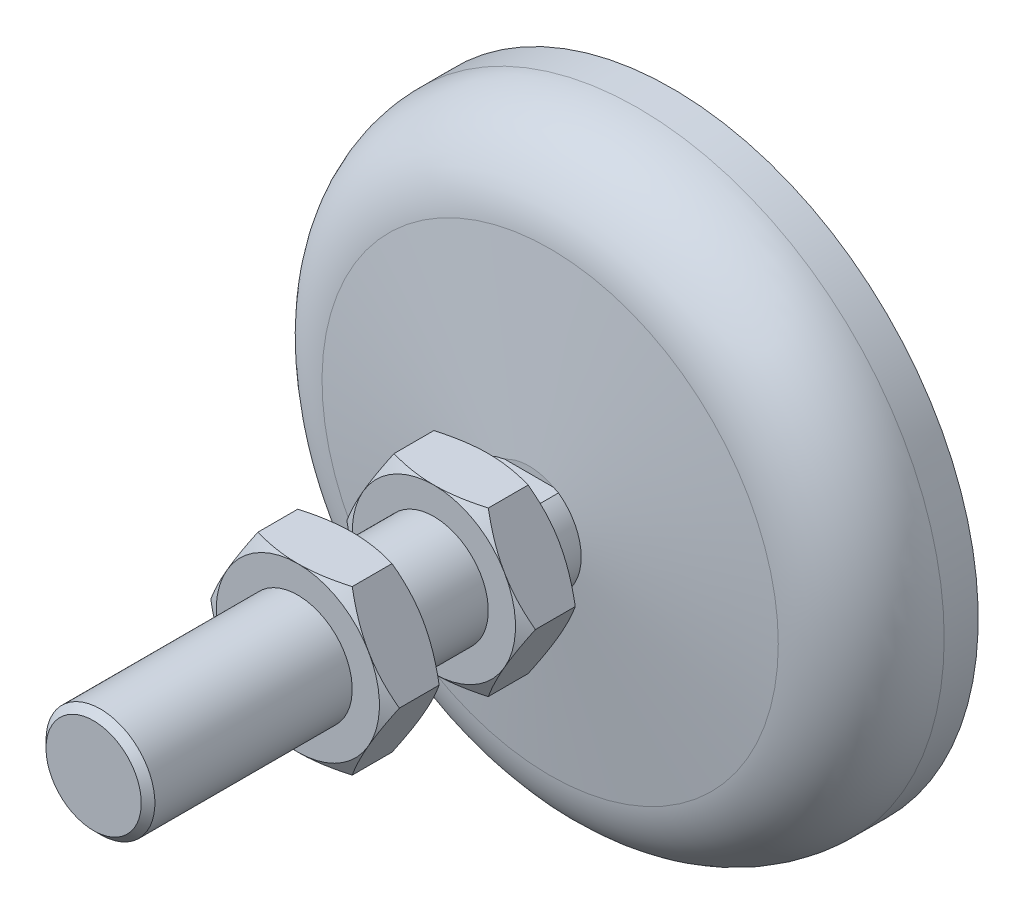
ISO-10303-21;
HEADER;
FILE_DESCRIPTION(('STEP AP214'),'2;1');
FILE_NAME('part.step','',(''),(''),'','','');
FILE_SCHEMA(('AUTOMOTIVE_DESIGN { 1 0 10303 214 1 1 1 1 }'));
ENDSEC;
DATA;
#1=APPLICATION_CONTEXT('core data for automotive mechanical design processes');
#2=APPLICATION_PROTOCOL_DEFINITION('international standard','automotive_design',2000,#1);
#3=PRODUCT_CONTEXT('',#1,'mechanical');
#4=PRODUCT('Part','Part','',(#3));
#5=PRODUCT_RELATED_PRODUCT_CATEGORY('part','',(#4));
#6=PRODUCT_DEFINITION_FORMATION('','',#4);
#7=PRODUCT_DEFINITION_CONTEXT('part definition',#1,'design');
#8=PRODUCT_DEFINITION('design','',#6,#7);
#9=PRODUCT_DEFINITION_SHAPE('','',#8);
#10=(LENGTH_UNIT() NAMED_UNIT(*) SI_UNIT(.MILLI.,.METRE.));
#11=(NAMED_UNIT(*) PLANE_ANGLE_UNIT() SI_UNIT($,.RADIAN.));
#12=(NAMED_UNIT(*) SI_UNIT($,.STERADIAN.) SOLID_ANGLE_UNIT());
#13=UNCERTAINTY_MEASURE_WITH_UNIT(LENGTH_MEASURE(1.E-05),#10,'distance_accuracy_value','');
#14=(GEOMETRIC_REPRESENTATION_CONTEXT(3) GLOBAL_UNCERTAINTY_ASSIGNED_CONTEXT((#13)) GLOBAL_UNIT_ASSIGNED_CONTEXT((#10,
#11,#12)) REPRESENTATION_CONTEXT('',''));
#15=CARTESIAN_POINT('',(0.,0.,0.));
#16=DIRECTION('',(0.,0.,1.));
#17=DIRECTION('',(1.,0.,0.));
#18=AXIS2_PLACEMENT_3D('',#15,#16,#17);
#19=CARTESIAN_POINT('',(0.,0.,85.));
#20=DIRECTION('',(0.,0.,1.));
#21=DIRECTION('',(1.,0.,0.));
#22=AXIS2_PLACEMENT_3D('',#19,#20,#21);
#23=PLANE('',#22);
#24=CARTESIAN_POINT('',(0.,0.,85.0000000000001));
#25=DIRECTION('',(0.,0.,-1.));
#26=DIRECTION('',(-1.,0.,0.));
#27=AXIS2_PLACEMENT_3D('',#24,#25,#26);
#28=CIRCLE('',#27,7.00000000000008);
#29=CARTESIAN_POINT('',(-7.00000000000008,0.,85.0000000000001));
#30=VERTEX_POINT('',#29);
#31=EDGE_CURVE('E517',#30,#30,#28,.T.);
#32=ORIENTED_EDGE('',*,*,#31,.F.);
#33=EDGE_LOOP('',(#32));
#34=FACE_BOUND('',#33,.T.);
#35=ADVANCED_FACE('F17',(#34),#23,.T.);
#36=CARTESIAN_POINT('',(0.,0.,83.9999999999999));
#37=DIRECTION('',(0.,0.,-1.));
#38=DIRECTION('',(-1.,0.,0.));
#39=AXIS2_PLACEMENT_3D('',#36,#37,#38);
#40=CONICAL_SURFACE('',#39,7.99999999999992,0.7853981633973);
#41=CARTESIAN_POINT('',(0.,0.,84.));
#42=DIRECTION('',(0.,0.,-1.));
#43=DIRECTION('',(-1.,0.,0.));
#44=AXIS2_PLACEMENT_3D('',#41,#42,#43);
#45=CIRCLE('',#44,8.);
#46=CARTESIAN_POINT('',(-8.,0.,84.));
#47=VERTEX_POINT('',#46);
#48=EDGE_CURVE('E514',#47,#47,#45,.T.);
#49=ORIENTED_EDGE('',*,*,#48,.F.);
#50=EDGE_LOOP('',(#49));
#51=FACE_BOUND('',#50,.T.);
#52=ORIENTED_EDGE('',*,*,#31,.T.);
#53=EDGE_LOOP('',(#52));
#54=FACE_BOUND('',#53,.T.);
#55=ADVANCED_FACE('F1656',(#51,#54),#40,.T.);
#56=CARTESIAN_POINT('',(0.,0.,10.09795192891));
#57=DIRECTION('',(0.,0.,-1.));
#58=DIRECTION('',(-1.,0.,0.));
#59=AXIS2_PLACEMENT_3D('',#56,#57,#58);
#60=CYLINDRICAL_SURFACE('',#59,8.);
#61=ORIENTED_EDGE('',*,*,#48,.T.);
#62=EDGE_LOOP('',(#61));
#63=FACE_BOUND('',#62,.T.);
#64=CARTESIAN_POINT('',(0.,0.,55.));
#65=DIRECTION('',(0.,0.,-1.));
#66=DIRECTION('',(-1.,0.,0.));
#67=AXIS2_PLACEMENT_3D('',#64,#65,#66);
#68=CIRCLE('',#67,8.);
#69=CARTESIAN_POINT('',(-8.,0.,55.));
#70=VERTEX_POINT('',#69);
#71=EDGE_CURVE('E252',#70,#70,#68,.F.);
#72=ORIENTED_EDGE('',*,*,#71,.T.);
#73=EDGE_LOOP('',(#72));
#74=FACE_BOUND('',#73,.T.);
#75=ADVANCED_FACE('F1648',(#63,#74),#60,.T.);
#76=CARTESIAN_POINT('',(0.,0.,55.));
#77=DIRECTION('',(0.,0.,-1.));
#78=DIRECTION('',(-1.,0.,0.));
#79=AXIS2_PLACEMENT_3D('',#76,#77,#78);
#80=PLANE('',#79);
#81=ORIENTED_EDGE('',*,*,#71,.F.);
#82=EDGE_LOOP('',(#81));
#83=FACE_BOUND('',#82,.T.);
#84=CARTESIAN_POINT('',(0.,0.,55.0000000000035));
#85=DIRECTION('',(0.,0.,-1.));
#86=DIRECTION('',(-1.,0.,0.));
#87=AXIS2_PLACEMENT_3D('',#84,#85,#86);
#88=CIRCLE('',#87,12.0000000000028);
#89=CARTESIAN_POINT('',(-10.3923048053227,6.00000006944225,55.0000000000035));
#90=VERTEX_POINT('',#89);
#91=CARTESIAN_POINT('',(-1.04756266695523E-07,12.0000000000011,55.0000000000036));
#92=VERTEX_POINT('',#91);
#93=EDGE_CURVE('E232',#90,#92,#88,.T.);
#94=ORIENTED_EDGE('',*,*,#93,.F.);
#95=CARTESIAN_POINT('',(0.,0.,55.0000000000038));
#96=DIRECTION('',(0.,0.,-1.));
#97=DIRECTION('',(0.,1.,0.));
#98=AXIS2_PLACEMENT_3D('',#95,#96,#97);
#99=CIRCLE('',#98,12.0000000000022);
#100=CARTESIAN_POINT('',(-10.3923048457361,-5.99999999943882,55.0000000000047));
#101=VERTEX_POINT('',#100);
#102=EDGE_CURVE('E228',#101,#90,#99,.T.);
#103=ORIENTED_EDGE('',*,*,#102,.F.);
#104=CARTESIAN_POINT('',(0.,0.,55.0000000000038));
#105=DIRECTION('',(0.,0.,-1.));
#106=DIRECTION('',(-1.,0.,0.));
#107=AXIS2_PLACEMENT_3D('',#104,#105,#106);
#108=CIRCLE('',#107,12.0000000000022);
#109=CARTESIAN_POINT('',(-1.86754111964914E-09,-12.,55.0000000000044));
#110=VERTEX_POINT('',#109);
#111=EDGE_CURVE('E225',#110,#101,#108,.T.);
#112=ORIENTED_EDGE('',*,*,#111,.F.);
#113=CARTESIAN_POINT('',(0.,0.,55.0000000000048));
#114=DIRECTION('',(0.,0.,-1.));
#115=DIRECTION('',(-1.,0.,0.));
#116=AXIS2_PLACEMENT_3D('',#113,#114,#115);
#117=CIRCLE('',#116,12.0000000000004);
#118=CARTESIAN_POINT('',(10.392304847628,-5.99999999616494,55.0000000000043));
#119=VERTEX_POINT('',#118);
#120=EDGE_CURVE('E1429',#119,#110,#117,.T.);
#121=ORIENTED_EDGE('',*,*,#120,.F.);
#122=CARTESIAN_POINT('',(0.,0.,55.0000000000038));
#123=DIRECTION('',(0.,0.,-1.));
#124=DIRECTION('',(0.,1.,0.));
#125=AXIS2_PLACEMENT_3D('',#122,#123,#124);
#126=CIRCLE('',#125,12.0000000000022);
#127=CARTESIAN_POINT('',(10.3923048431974,6.00000000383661,55.0000000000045));
#128=VERTEX_POINT('',#127);
#129=EDGE_CURVE('E296',#128,#119,#126,.T.);
#130=ORIENTED_EDGE('',*,*,#129,.F.);
#131=CARTESIAN_POINT('',(0.,0.,55.0000000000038));
#132=DIRECTION('',(0.,0.,-1.));
#133=DIRECTION('',(-1.,0.,0.));
#134=AXIS2_PLACEMENT_3D('',#131,#132,#133);
#135=CIRCLE('',#134,12.0000000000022);
#136=EDGE_CURVE('E1428',#92,#128,#135,.T.);
#137=ORIENTED_EDGE('',*,*,#136,.F.);
#138=EDGE_LOOP('',(#94,#103,#112,#121,#130,#137));
#139=FACE_BOUND('',#138,.T.);
#140=ADVANCED_FACE('F230',(#83,#139),#80,.F.);
#141=CARTESIAN_POINT('',(0.,0.,53.9217724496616));
#142=DIRECTION('',(0.,0.,-1.));
#143=DIRECTION('',(-1.,0.,0.));
#144=AXIS2_PLACEMENT_3D('',#141,#142,#143);
#145=CONICAL_SURFACE('',#144,13.8675448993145,1.0471975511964);
#146=ORIENTED_EDGE('',*,*,#111,.T.);
#147=CARTESIAN_POINT('',(-10.3923048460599,-5.99999999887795,55.0000000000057));
#148=CARTESIAN_POINT('',(-10.2452732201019,-6.25466624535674,55.0000493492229));
#149=CARTESIAN_POINT('',(-10.0982485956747,-6.50932036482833,54.9937606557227));
#150=CARTESIAN_POINT('',(-9.80448803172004,-7.01812858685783,54.9688726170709));
#151=CARTESIAN_POINT('',(-9.6577520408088,-7.27228277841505,54.9502757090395));
#152=CARTESIAN_POINT('',(-9.36551670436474,-7.77844922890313,54.9012591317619));
#153=CARTESIAN_POINT('',(-9.22001484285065,-8.03046584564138,54.8708989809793));
#154=CARTESIAN_POINT('',(-8.92970369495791,-8.53329950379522,54.7990044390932));
#155=CARTESIAN_POINT('',(-8.78489442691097,-8.78411651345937,54.7574697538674));
#156=CARTESIAN_POINT('',(-8.49629336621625,-9.28398821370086,54.6640731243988));
#157=CARTESIAN_POINT('',(-8.35250055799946,-9.53304466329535,54.6122236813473));
#158=CARTESIAN_POINT('',(-8.0658513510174,-10.0295356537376,54.4990499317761));
#159=CARTESIAN_POINT('',(-7.92299500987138,-10.2769700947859,54.4377250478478));
#160=CARTESIAN_POINT('',(-7.4944854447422,-11.0191704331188,54.2402447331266));
#161=CARTESIAN_POINT('',(-7.2103090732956,-11.5113783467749,54.0910592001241));
#162=CARTESIAN_POINT('',(-6.92820323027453,-11.9999999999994,53.9282032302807));
#163=B_SPLINE_CURVE_WITH_KNOTS('',3,(#147,#148,#149,#150,#151,#152,#153,#154,#155,#156,#157,
#158,#159,#160,#161,#162),.UNSPECIFIED.,.F.,.F.,(4,2,2,2,2,2,2,4),(0.,0.882100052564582,
1.76402549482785,2.64154573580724,3.51908907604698,4.39557526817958,5.27211489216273,
7.03380287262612),.UNSPECIFIED.);
#164=CARTESIAN_POINT('',(-6.92820323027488,-11.9999999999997,53.9282032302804));
#165=VERTEX_POINT('',#164);
#166=EDGE_CURVE('E244',#101,#165,#163,.T.);
#167=ORIENTED_EDGE('',*,*,#166,.T.);
#168=CARTESIAN_POINT('',(-6.92820323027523,-12.,53.9282032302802));
#169=CARTESIAN_POINT('',(-6.36399154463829,-12.,54.0910592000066));
#170=CARTESIAN_POINT('',(-5.79563880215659,-12.,54.2402447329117));
#171=CARTESIAN_POINT('',(-4.93861967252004,-12.,54.4377250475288));
#172=CARTESIAN_POINT('',(-4.65290699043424,-12.,54.4990499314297));
#173=CARTESIAN_POINT('',(-4.07960857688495,-12.,54.6122236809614));
#174=CARTESIAN_POINT('',(-3.79202296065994,-12.,54.6640731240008));
#175=CARTESIAN_POINT('',(-3.21482083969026,-12.,54.7574697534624));
#176=CARTESIAN_POINT('',(-2.92520230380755,-12.,54.7990044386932));
#177=CARTESIAN_POINT('',(-2.3445800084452,-12.,54.8708989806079));
#178=CARTESIAN_POINT('',(-2.05357628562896,-12.,54.901259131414));
#179=CARTESIAN_POINT('',(-1.46910561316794,-12.,54.9502757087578));
#180=CARTESIAN_POINT('',(-1.17563363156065,-12.,54.9688726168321));
#181=CARTESIAN_POINT('',(-0.588112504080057,-12.,54.9937606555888));
#182=CARTESIAN_POINT('',(-0.294063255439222,-12.,55.000049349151));
#183=CARTESIAN_POINT('',(-3.73508381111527E-09,-12.,55.0000000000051));
#184=B_SPLINE_CURVE_WITH_KNOTS('',3,(#168,#169,#170,#171,#172,#173,#174,#175,#176,#177,#178,
#179,#180,#181,#182,#183),.UNSPECIFIED.,.F.,.F.,(4,2,2,2,2,2,2,4),(0.,1.76168797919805,
2.63822760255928,3.51471379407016,4.39225713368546,5.2697773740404,6.1517028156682,
7.03380286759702),.UNSPECIFIED.);
#185=EDGE_CURVE('E250',#165,#110,#184,.T.);
#186=ORIENTED_EDGE('',*,*,#185,.T.);
#187=EDGE_LOOP('',(#146,#167,#186));
#188=FACE_BOUND('',#187,.T.);
#189=ADVANCED_FACE('F248',(#188),#145,.T.);
#190=CARTESIAN_POINT('',(0.,0.,53.9217724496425));
#191=DIRECTION('',(0.,0.,-1.));
#192=DIRECTION('',(0.,1.,0.));
#193=AXIS2_PLACEMENT_3D('',#190,#191,#192);
#194=CONICAL_SURFACE('',#193,13.8675448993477,1.0471975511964);
#195=ORIENTED_EDGE('',*,*,#102,.T.);
#196=CARTESIAN_POINT('',(-10.3923047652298,6.0000001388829,55.0000000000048));
#197=CARTESIAN_POINT('',(-10.5393363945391,5.74533388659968,55.000049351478));
#198=CARTESIAN_POINT('',(-10.6863610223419,5.49067976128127,54.9937606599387));
#199=CARTESIAN_POINT('',(-10.9801215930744,4.98187152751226,54.9688726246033));
#200=CARTESIAN_POINT('',(-11.1268575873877,4.7277173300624,54.9502757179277));
#201=CARTESIAN_POINT('',(-11.4190929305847,4.2215508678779,54.901259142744));
#202=CARTESIAN_POINT('',(-11.5645947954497,3.96953424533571,54.8708989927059));
#203=CARTESIAN_POINT('',(-11.8549059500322,3.4667005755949,54.7990044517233));
#204=CARTESIAN_POINT('',(-11.999715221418,3.21588356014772,54.7574697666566));
#205=CARTESIAN_POINT('',(-12.2883162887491,2.71601184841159,54.6640731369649));
#206=CARTESIAN_POINT('',(-12.4321091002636,2.46695539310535,54.6122236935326));
#207=CARTESIAN_POINT('',(-12.7187583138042,1.9704643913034,54.4990499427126));
#208=CARTESIAN_POINT('',(-12.8616146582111,1.72302994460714,54.4377250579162));
#209=CARTESIAN_POINT('',(-13.2901242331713,0.980829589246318,54.2402447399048));
#210=CARTESIAN_POINT('',(-13.5743006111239,0.488621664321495,54.0910592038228));
#211=CARTESIAN_POINT('',(-13.8564064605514,8.14731255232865E-13,53.9282032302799));
#212=B_SPLINE_CURVE_WITH_KNOTS('',3,(#196,#197,#198,#199,#200,#201,#202,#203,#204,#205,#206,
#207,#208,#209,#210,#211),.UNSPECIFIED.,.F.,.F.,(4,2,2,2,2,2,2,4),(0.,0.882100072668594,
1.76402553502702,2.64154579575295,3.51908915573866,4.39557536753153,5.27211501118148,
7.03380303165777),.UNSPECIFIED.);
#213=CARTESIAN_POINT('',(-13.8564064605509,0.,53.9282032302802));
#214=VERTEX_POINT('',#213);
#215=EDGE_CURVE('E240',#90,#214,#212,.T.);
#216=ORIENTED_EDGE('',*,*,#215,.T.);
#217=CARTESIAN_POINT('',(-13.8564064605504,7.01403029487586E-13,53.9282032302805));
#218=CARTESIAN_POINT('',(-13.5743006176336,-0.488621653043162,54.0910592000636));
#219=CARTESIAN_POINT('',(-13.290124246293,-0.980829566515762,54.2402447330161));
#220=CARTESIAN_POINT('',(-12.8616146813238,-1.72302990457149,54.4377250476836));
#221=CARTESIAN_POINT('',(-12.7187583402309,-1.97046434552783,54.4990499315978));
#222=CARTESIAN_POINT('',(-12.4321091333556,-2.46695533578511,54.6122236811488));
#223=CARTESIAN_POINT('',(-12.2883163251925,-2.71601178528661,54.6640731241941));
#224=CARTESIAN_POINT('',(-11.9997152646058,-3.21588348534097,54.7574697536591));
#225=CARTESIAN_POINT('',(-11.8549059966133,-3.46670049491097,54.7990044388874));
#226=CARTESIAN_POINT('',(-11.5645948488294,-3.96953415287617,54.8708989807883));
#227=CARTESIAN_POINT('',(-11.4190929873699,-4.22155076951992,54.901259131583));
#228=CARTESIAN_POINT('',(-11.1268576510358,-4.72771721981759,54.9502757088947));
#229=CARTESIAN_POINT('',(-10.9801216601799,-4.98187141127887,54.9688726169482));
#230=CARTESIAN_POINT('',(-10.6863610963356,-5.49067963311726,54.9937606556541));
#231=CARTESIAN_POINT('',(-10.5393364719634,-5.74533375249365,55.0000493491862));
#232=CARTESIAN_POINT('',(-10.3923048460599,-5.99999999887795,55.0000000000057));
#233=B_SPLINE_CURVE_WITH_KNOTS('',3,(#217,#218,#219,#220,#221,#222,#223,#224,#225,#226,#227,
#228,#229,#230,#231,#232),.UNSPECIFIED.,.F.,.F.,(4,2,2,2,2,2,2,4),(0.,1.76168797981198,
2.63822760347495,3.51471379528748,4.39225713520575,5.26977737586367,6.15170281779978,
7.03380287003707),.UNSPECIFIED.);
#234=EDGE_CURVE('E238',#214,#101,#233,.T.);
#235=ORIENTED_EDGE('',*,*,#234,.T.);
#236=EDGE_LOOP('',(#195,#216,#235));
#237=FACE_BOUND('',#236,.T.);
#238=ADVANCED_FACE('F239',(#237),#194,.T.);
#239=CARTESIAN_POINT('',(0.,0.,53.9217724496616));
#240=DIRECTION('',(0.,0.,-1.));
#241=DIRECTION('',(-1.,0.,0.));
#242=AXIS2_PLACEMENT_3D('',#239,#240,#241);
#243=CONICAL_SURFACE('',#242,13.8675448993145,1.0471975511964);
#244=ORIENTED_EDGE('',*,*,#93,.T.);
#245=CARTESIAN_POINT('',(-2.09512533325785E-07,12.,55.0000000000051));
#246=CARTESIAN_POINT('',(-0.29406345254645,12.,55.0000493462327));
#247=CARTESIAN_POINT('',(-0.588112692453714,12.,54.9937606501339));
#248=CARTESIAN_POINT('',(-1.17563380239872,12.,54.9688726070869));
#249=CARTESIAN_POINT('',(-1.469105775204,12.,54.9502756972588));
#250=CARTESIAN_POINT('',(-2.05357643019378,12.,54.9012591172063));
#251=CARTESIAN_POINT('',(-2.34458014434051,12.,54.8708989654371));
#252=CARTESIAN_POINT('',(-2.92520242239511,12.,54.7990044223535));
#253=CARTESIAN_POINT('',(-3.21482094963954,12.,54.7574697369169));
#254=CARTESIAN_POINT('',(-3.7920230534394,12.,54.664073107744));
#255=CARTESIAN_POINT('',(-4.0796086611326,12.,54.6122236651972));
#256=CARTESIAN_POINT('',(-4.65290705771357,12.,54.4990499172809));
#257=CARTESIAN_POINT('',(-4.93861973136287,12.,54.4377250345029));
#258=CARTESIAN_POINT('',(-5.79563883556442,12.,54.2402447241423));
#259=CARTESIAN_POINT('',(-6.36399156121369,12.,54.0910591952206));
#260=CARTESIAN_POINT('',(-6.92820323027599,12.,53.92820323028));
#261=B_SPLINE_CURVE_WITH_KNOTS('',3,(#245,#246,#247,#248,#249,#250,#251,#252,#253,#254,#255,
#256,#257,#258,#259,#260),.UNSPECIFIED.,.F.,.F.,(4,2,2,2,2,2,2,4),(0.,0.88210002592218,
1.76402544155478,2.6415456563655,3.51908897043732,4.39557513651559,5.27211473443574,
7.03380266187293),.UNSPECIFIED.);
#262=CARTESIAN_POINT('',(-6.928203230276,12.,53.92820323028));
#263=VERTEX_POINT('',#262);
#264=EDGE_CURVE('E408',#92,#263,#261,.T.);
#265=ORIENTED_EDGE('',*,*,#264,.T.);
#266=CARTESIAN_POINT('',(-6.92820323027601,12.,53.92820323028));
#267=CARTESIAN_POINT('',(-7.21030906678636,11.5113783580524,54.0910591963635));
#268=CARTESIAN_POINT('',(-7.49448543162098,11.0191704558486,54.2402447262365));
#269=CARTESIAN_POINT('',(-7.92299498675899,10.2769701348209,54.4377250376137));
#270=CARTESIAN_POINT('',(-8.06585132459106,10.0295356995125,54.4990499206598));
#271=CARTESIAN_POINT('',(-8.35250052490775,9.53304472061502,54.6122236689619));
#272=CARTESIAN_POINT('',(-8.49629332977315,9.28398827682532,54.6640731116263));
#273=CARTESIAN_POINT('',(-8.78489438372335,8.78411658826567,54.7574697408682));
#274=CARTESIAN_POINT('',(-8.92970364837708,8.53329958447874,54.7990044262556));
#275=CARTESIAN_POINT('',(-9.22001478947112,8.03046593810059,54.87089896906));
#276=CARTESIAN_POINT('',(-9.36551664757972,7.77844932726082,54.9012591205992));
#277=CARTESIAN_POINT('',(-9.65775197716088,7.27228288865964,54.9502757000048));
#278=CARTESIAN_POINT('',(-9.80448796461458,7.01812870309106,54.968872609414));
#279=CARTESIAN_POINT('',(-10.098248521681,6.50932049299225,54.9937606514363));
#280=CARTESIAN_POINT('',(-10.2452731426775,6.25466637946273,55.0000493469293));
#281=CARTESIAN_POINT('',(-10.3923047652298,6.0000001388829,55.0000000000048));
#282=B_SPLINE_CURVE_WITH_KNOTS('',3,(#266,#267,#268,#269,#270,#271,#272,#273,#274,#275,#276,
#277,#278,#279,#280,#281),.UNSPECIFIED.,.F.,.F.,(4,2,2,2,2,2,2,4),(0.,1.7616879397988,
2.63822754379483,3.51471371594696,4.39225703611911,5.26977725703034,6.15170267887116,
7.03380271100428),.UNSPECIFIED.);
#283=EDGE_CURVE('E259',#263,#90,#282,.T.);
#284=ORIENTED_EDGE('',*,*,#283,.T.);
#285=EDGE_LOOP('',(#244,#265,#284));
#286=FACE_BOUND('',#285,.T.);
#287=ADVANCED_FACE('F396',(#286),#243,.T.);
#288=CARTESIAN_POINT('',(0.,0.,53.9217724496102));
#289=DIRECTION('',(0.,0.,-1.));
#290=DIRECTION('',(-1.,0.,0.));
#291=AXIS2_PLACEMENT_3D('',#288,#289,#290);
#292=CONICAL_SURFACE('',#291,13.8675448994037,1.0471975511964);
#293=ORIENTED_EDGE('',*,*,#136,.T.);
#294=CARTESIAN_POINT('',(10.392304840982,6.00000000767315,55.0000000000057));
#295=CARTESIAN_POINT('',(10.2452732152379,6.25466625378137,55.0000493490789));
#296=CARTESIAN_POINT('',(10.0982485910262,6.50932037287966,54.9937606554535));
#297=CARTESIAN_POINT('',(9.80448802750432,7.01812859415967,54.9688726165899));
#298=CARTESIAN_POINT('',(9.65775203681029,7.27228278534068,54.950275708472));
#299=CARTESIAN_POINT('',(9.36551670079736,7.77844923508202,54.9012591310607));
#300=CARTESIAN_POINT('',(9.2200148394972,8.03046585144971,54.8708989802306));
#301=CARTESIAN_POINT('',(8.92970369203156,8.5332995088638,54.7990044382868));
#302=CARTESIAN_POINT('',(8.78489442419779,8.78411651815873,54.7574697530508));
#303=CARTESIAN_POINT('',(8.49629336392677,9.28398821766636,54.6640731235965));
#304=CARTESIAN_POINT('',(8.35250055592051,9.53304466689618,54.6122236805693));
#305=CARTESIAN_POINT('',(8.06585134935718,10.0295356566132,54.4990499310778));
#306=CARTESIAN_POINT('',(7.92299500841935,10.2769700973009,54.4377250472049));
#307=CARTESIAN_POINT('',(7.49448544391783,11.0191704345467,54.2402447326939));
#308=CARTESIAN_POINT('',(7.2103090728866,11.5113783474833,54.0910591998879));
#309=CARTESIAN_POINT('',(6.92820323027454,11.9999999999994,53.9282032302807));
#310=B_SPLINE_CURVE_WITH_KNOTS('',3,(#294,#295,#296,#297,#298,#299,#300,#301,#302,#303,#304,
#305,#306,#307,#308,#309),.UNSPECIFIED.,.F.,.F.,(4,2,2,2,2,2,2,4),(0.,0.882100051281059,
1.76402549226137,2.64154573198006,3.51908907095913,4.39557526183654,5.27211488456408,
7.03380286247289),.UNSPECIFIED.);
#311=CARTESIAN_POINT('',(6.92820323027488,11.9999999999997,53.9282032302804));
#312=VERTEX_POINT('',#311);
#313=EDGE_CURVE('E380',#128,#312,#310,.T.);
#314=ORIENTED_EDGE('',*,*,#313,.T.);
#315=CARTESIAN_POINT('',(6.92820323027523,12.,53.9282032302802));
#316=CARTESIAN_POINT('',(6.36399152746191,12.,54.091059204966));
#317=CARTESIAN_POINT('',(5.79563876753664,12.,54.2402447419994));
#318=CARTESIAN_POINT('',(4.93861961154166,12.,54.4377250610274));
#319=CARTESIAN_POINT('',(4.65290692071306,12.,54.499049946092));
#320=CARTESIAN_POINT('',(4.0796084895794,12.,54.6122236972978));
#321=CARTESIAN_POINT('',(3.79202286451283,12.,54.6640731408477));
#322=CARTESIAN_POINT('',(3.21482072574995,12.,54.7574697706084));
#323=CARTESIAN_POINT('',(2.92520218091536,12.,54.799004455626));
#324=CARTESIAN_POINT('',(2.34457986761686,12.,54.8708989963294));
#325=CARTESIAN_POINT('',(2.05357613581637,12.,54.9012591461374));
#326=CARTESIAN_POINT('',(1.4691054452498,12.,54.9502757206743));
#327=CARTESIAN_POINT('',(1.17563345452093,12.,54.968872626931));
#328=CARTESIAN_POINT('',(0.588112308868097,12.,54.9937606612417));
#329=CARTESIAN_POINT('',(0.294063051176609,12.,55.0000493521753));
#330=CARTESIAN_POINT('',(-2.0951253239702E-07,12.,55.0000000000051));
#331=B_SPLINE_CURVE_WITH_KNOTS('',3,(#315,#316,#317,#318,#319,#320,#321,#322,#323,#324,#325,
#326,#327,#328,#329,#330),.UNSPECIFIED.,.F.,.F.,(4,2,2,2,2,2,2,4),(0.,1.76168803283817,
2.63822768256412,3.51471390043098,4.39225726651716,5.26977753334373,6.1517030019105,
7.03380308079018),.UNSPECIFIED.);
#332=EDGE_CURVE('E401',#312,#92,#331,.T.);
#333=ORIENTED_EDGE('',*,*,#332,.T.);
#334=EDGE_LOOP('',(#293,#314,#333));
#335=FACE_BOUND('',#334,.T.);
#336=ADVANCED_FACE('F390',(#335),#292,.T.);
#337=CARTESIAN_POINT('',(0.,0.,53.9217724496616));
#338=DIRECTION('',(0.,0.,-1.));
#339=DIRECTION('',(-1.,0.,0.));
#340=AXIS2_PLACEMENT_3D('',#337,#338,#339);
#341=CONICAL_SURFACE('',#340,13.8675448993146,1.0471975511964);
#342=ORIENTED_EDGE('',*,*,#120,.T.);
#343=CARTESIAN_POINT('',(-3.73508223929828E-09,-12.,55.0000000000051));
#344=CARTESIAN_POINT('',(0.294063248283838,-12.,55.000049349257));
#345=CARTESIAN_POINT('',(0.588112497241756,-12.,54.9937606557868));
#346=CARTESIAN_POINT('',(1.175633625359,-12.,54.9688726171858));
#347=CARTESIAN_POINT('',(1.46910560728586,-12.,54.9502757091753));
#348=CARTESIAN_POINT('',(2.05357628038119,-12.,54.9012591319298));
#349=CARTESIAN_POINT('',(2.34458000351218,-12.,54.8708989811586));
#350=CARTESIAN_POINT('',(2.92520229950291,-12.,54.7990044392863));
#351=CARTESIAN_POINT('',(3.21482083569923,-12.,54.757469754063));
#352=CARTESIAN_POINT('',(3.79202295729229,-12.,54.6640731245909));
#353=CARTESIAN_POINT('',(4.07960857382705,-12.,54.6122236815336));
#354=CARTESIAN_POINT('',(4.65290698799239,-12.,54.4990499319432));
#355=CARTESIAN_POINT('',(4.93861967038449,-12.,54.4377250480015));
#356=CARTESIAN_POINT('',(5.79563880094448,-12.,54.2402447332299));
#357=CARTESIAN_POINT('',(6.3639915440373,-12.,54.0910592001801));
#358=CARTESIAN_POINT('',(6.92820323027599,-12.,53.92820323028));
#359=B_SPLINE_CURVE_WITH_KNOTS('',3,(#343,#344,#345,#346,#347,#348,#349,#350,#351,#352,#353,
#354,#355,#356,#357,#358),.UNSPECIFIED.,.F.,.F.,(4,2,2,2,2,2,2,4),(0.,0.88210005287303,
1.76402549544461,2.64154573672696,3.51908907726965,4.3955752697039,5.27211489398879,
7.03380287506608),.UNSPECIFIED.);
#360=CARTESIAN_POINT('',(6.928203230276,-12.,53.92820323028));
#361=VERTEX_POINT('',#360);
#362=EDGE_CURVE('E245',#110,#361,#359,.T.);
#363=ORIENTED_EDGE('',*,*,#362,.T.);
#364=CARTESIAN_POINT('',(6.92820323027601,-12.,53.92820323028));
#365=CARTESIAN_POINT('',(7.21030907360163,-11.511378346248,54.0910592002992));
#366=CARTESIAN_POINT('',(7.49448544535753,-11.0191704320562,54.2402447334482));
#367=CARTESIAN_POINT('',(7.92299501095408,-10.2769700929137,54.4377250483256));
#368=CARTESIAN_POINT('',(8.06585135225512,-10.0295356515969,54.4990499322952));
#369=CARTESIAN_POINT('',(8.35250055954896,-9.53304466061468,54.6122236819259));
#370=CARTESIAN_POINT('',(8.49629336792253,-9.28398821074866,54.6640731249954));
#371=CARTESIAN_POINT('',(8.78489442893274,-8.78411650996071,54.7574697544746));
#372=CARTESIAN_POINT('',(8.92970369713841,-8.53329950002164,54.7990044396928));
#373=CARTESIAN_POINT('',(9.22001484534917,-8.03046584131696,54.870898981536));
#374=CARTESIAN_POINT('',(9.36551670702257,-7.77844922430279,54.9012591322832));
#375=CARTESIAN_POINT('',(9.65775204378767,-7.27228277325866,54.9502757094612));
#376=CARTESIAN_POINT('',(9.80448803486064,-7.01812858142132,54.9688726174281));
#377=CARTESIAN_POINT('',(10.0982485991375,-6.50932035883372,54.9937606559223));
#378=CARTESIAN_POINT('',(10.2452732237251,-6.25466623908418,55.0000493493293));
#379=CARTESIAN_POINT('',(10.3923048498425,-5.99999999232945,55.0000000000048));
#380=B_SPLINE_CURVE_WITH_KNOTS('',3,(#364,#365,#366,#367,#368,#369,#370,#371,#372,#373,#374,
#375,#376,#377,#378,#379),.UNSPECIFIED.,.F.,.F.,(4,2,2,2,2,2,2,4),(0.,1.76168798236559,
2.63822760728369,3.51471380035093,4.39225714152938,5.26977738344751,6.15170282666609,
7.03380288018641),.UNSPECIFIED.);
#381=EDGE_CURVE('E372',#361,#119,#380,.T.);
#382=ORIENTED_EDGE('',*,*,#381,.T.);
#383=EDGE_LOOP('',(#342,#363,#382));
#384=FACE_BOUND('',#383,.T.);
#385=ADVANCED_FACE('F387',(#384),#341,.T.);
#386=CARTESIAN_POINT('',(0.,0.,53.9217724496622));
#387=DIRECTION('',(0.,0.,-1.));
#388=DIRECTION('',(0.,1.,0.));
#389=AXIS2_PLACEMENT_3D('',#386,#387,#388);
#390=CONICAL_SURFACE('',#389,13.8675448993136,1.0471975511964);
#391=ORIENTED_EDGE('',*,*,#129,.T.);
#392=CARTESIAN_POINT('',(10.3923048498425,-5.99999999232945,55.0000000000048));
#393=CARTESIAN_POINT('',(10.5393364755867,-5.74533374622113,55.0000493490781));
#394=CARTESIAN_POINT('',(10.6863610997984,-5.49067962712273,54.9937606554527));
#395=CARTESIAN_POINT('',(10.9801216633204,-4.98187140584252,54.9688726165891));
#396=CARTESIAN_POINT('',(11.1268576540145,-4.72771721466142,54.9502757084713));
#397=CARTESIAN_POINT('',(11.4190929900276,-4.22155076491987,54.90125913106));
#398=CARTESIAN_POINT('',(11.5645948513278,-3.96953414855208,54.8708989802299));
#399=CARTESIAN_POINT('',(11.8549059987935,-3.46670049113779,54.7990044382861));
#400=CARTESIAN_POINT('',(11.9997152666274,-3.21588348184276,54.7574697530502));
#401=CARTESIAN_POINT('',(12.2883163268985,-2.71601178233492,54.6640731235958));
#402=CARTESIAN_POINT('',(12.4321091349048,-2.466955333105,54.6122236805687));
#403=CARTESIAN_POINT('',(12.7187583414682,-1.97046434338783,54.4990499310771));
#404=CARTESIAN_POINT('',(12.8616146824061,-1.72302990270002,54.4377250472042));
#405=CARTESIAN_POINT('',(13.2901242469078,-0.980829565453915,54.2402447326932));
#406=CARTESIAN_POINT('',(13.5743006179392,-0.488621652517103,54.0910591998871));
#407=CARTESIAN_POINT('',(13.8564064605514,-8.14710619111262E-13,53.9282032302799));
#408=B_SPLINE_CURVE_WITH_KNOTS('',3,(#392,#393,#394,#395,#396,#397,#398,#399,#400,#401,#402,
#403,#404,#405,#406,#407),.UNSPECIFIED.,.F.,.F.,(4,2,2,2,2,2,2,4),(0.,0.882100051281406,
1.76402549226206,2.64154573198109,3.51908907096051,4.39557526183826,5.27211488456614,
7.03380286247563),.UNSPECIFIED.);
#409=CARTESIAN_POINT('',(13.8564064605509,0.,53.9282032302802));
#410=VERTEX_POINT('',#409);
#411=EDGE_CURVE('E366',#119,#410,#408,.T.);
#412=ORIENTED_EDGE('',*,*,#411,.T.);
#413=CARTESIAN_POINT('',(13.8564064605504,-7.01290463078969E-13,53.9282032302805));
#414=CARTESIAN_POINT('',(13.5743006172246,0.488621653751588,54.0910592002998));
#415=CARTESIAN_POINT('',(13.2901242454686,0.980829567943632,54.2402447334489));
#416=CARTESIAN_POINT('',(12.8616146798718,1.72302990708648,54.4377250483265));
#417=CARTESIAN_POINT('',(12.7187583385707,1.97046434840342,54.4990499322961));
#418=CARTESIAN_POINT('',(12.4321091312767,2.46695533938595,54.6122236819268));
#419=CARTESIAN_POINT('',(12.288316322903,2.71601178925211,54.6640731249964));
#420=CARTESIAN_POINT('',(11.9997152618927,3.21588349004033,54.7574697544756));
#421=CARTESIAN_POINT('',(11.8549059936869,3.46670049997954,54.7990044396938));
#422=CARTESIAN_POINT('',(11.564594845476,3.96953415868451,54.870898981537));
#423=CARTESIAN_POINT('',(11.4190929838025,4.22155077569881,54.9012591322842));
#424=CARTESIAN_POINT('',(11.1268576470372,4.72771722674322,54.9502757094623));
#425=CARTESIAN_POINT('',(10.9801216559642,4.98187141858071,54.9688726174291));
#426=CARTESIAN_POINT('',(10.6863610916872,5.4906796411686,54.9937606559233));
#427=CARTESIAN_POINT('',(10.5393364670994,5.74533376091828,55.0000493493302));
#428=CARTESIAN_POINT('',(10.392304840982,6.00000000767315,55.0000000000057));
#429=B_SPLINE_CURVE_WITH_KNOTS('',3,(#413,#414,#415,#416,#417,#418,#419,#420,#421,#422,#423,
#424,#425,#426,#427,#428),.UNSPECIFIED.,.F.,.F.,(4,2,2,2,2,2,2,4),(0.,1.76168798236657,
2.63822760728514,3.51471380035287,4.3922571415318,5.26977738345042,6.15170282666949,
7.0338028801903),.UNSPECIFIED.);
#430=EDGE_CURVE('E512',#410,#128,#429,.T.);
#431=ORIENTED_EDGE('',*,*,#430,.T.);
#432=EDGE_LOOP('',(#391,#412,#431));
#433=FACE_BOUND('',#432,.T.);
#434=ADVANCED_FACE('F307',(#433),#390,.T.);
#435=CARTESIAN_POINT('',(-6.928203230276,-12.,27.));
#436=DIRECTION('',(0.,1.,0.));
#437=DIRECTION('',(0.,0.,1.));
#438=AXIS2_PLACEMENT_3D('',#435,#436,#437);
#439=PLANE('',#438);
#440=ORIENTED_EDGE('',*,*,#362,.F.);
#441=ORIENTED_EDGE('',*,*,#185,.F.);
#442=DIRECTION('',(0.,0.,1.));
#443=VECTOR('',#442,1.);
#444=CARTESIAN_POINT('',(-6.92820323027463,-11.9999999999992,27.));
#445=LINE('',#444,#443);
#446=CARTESIAN_POINT('',(-6.92820321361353,-12.0000000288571,48.0717967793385));
#447=VERTEX_POINT('',#446);
#448=EDGE_CURVE('E257',#165,#447,#445,.F.);
#449=ORIENTED_EDGE('',*,*,#448,.T.);
#450=CARTESIAN_POINT('',(-3.73508444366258E-09,-12.,46.9999999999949));
#451=CARTESIAN_POINT('',(-0.294063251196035,-12.,46.9999506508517));
#452=CARTESIAN_POINT('',(-0.588112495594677,-12.,47.0062393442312));
#453=CARTESIAN_POINT('',(-1.17563361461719,-12.,47.031127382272));
#454=CARTESIAN_POINT('',(-1.46910559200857,-12.,47.0497242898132));
#455=CARTESIAN_POINT('',(-2.05357625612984,-12.,47.0987408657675));
#456=CARTESIAN_POINT('',(-2.34457997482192,-12.,47.1291010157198));
#457=CARTESIAN_POINT('',(-2.92520226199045,-12.,47.200995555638));
#458=CARTESIAN_POINT('',(-3.21482079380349,-12.,47.2425302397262));
#459=CARTESIAN_POINT('',(-3.79202290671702,-12.,47.3359268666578));
#460=CARTESIAN_POINT('',(-4.07960851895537,-12.,47.3877763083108));
#461=CARTESIAN_POINT('',(-4.65290692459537,-12.,47.5009500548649));
#462=CARTESIAN_POINT('',(-4.93861960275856,-12.,47.5622749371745));
#463=CARTESIAN_POINT('',(-5.79563872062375,-12.,47.759755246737));
#464=CARTESIAN_POINT('',(-6.36399145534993,-12.,47.9089407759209));
#465=CARTESIAN_POINT('',(-6.928203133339,-12.,48.0717967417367));
#466=B_SPLINE_CURVE_WITH_KNOTS('',3,(#450,#451,#452,#453,#454,#455,#456,#457,#458,#459,#460,
#461,#462,#463,#464,#465),.UNSPECIFIED.,.F.,.F.,(4,2,2,2,2,2,2,4),(0.,0.882100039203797,
1.76402546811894,2.64154569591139,3.519089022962,4.39557520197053,5.27211481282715,
7.03380276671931),.UNSPECIFIED.);
#467=CARTESIAN_POINT('',(-3.73508411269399E-09,-12.0000000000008,46.9999999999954));
#468=VERTEX_POINT('',#467);
#469=EDGE_CURVE('E313',#468,#447,#466,.T.);
#470=ORIENTED_EDGE('',*,*,#469,.F.);
#471=CARTESIAN_POINT('',(6.9282032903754,-11.9999999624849,48.0717968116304));
#472=CARTESIAN_POINT('',(6.36399160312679,-11.9999999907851,47.9089408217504));
#473=CARTESIAN_POINT('',(5.79563885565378,-11.9999999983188,47.7597552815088));
#474=CARTESIAN_POINT('',(4.93861971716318,-12.0000000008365,47.5622749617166));
#475=CARTESIAN_POINT('',(4.65290703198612,-12.0000000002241,47.5009500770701));
#476=CARTESIAN_POINT('',(4.0796086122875,-11.9999999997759,47.3877763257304));
#477=CARTESIAN_POINT('',(3.79202299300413,-11.9999999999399,47.3359268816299));
#478=CARTESIAN_POINT('',(3.21482086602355,-12.0000000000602,47.242530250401));
#479=CARTESIAN_POINT('',(2.92520232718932,-12.0000000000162,47.2009955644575));
#480=CARTESIAN_POINT('',(2.34458002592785,-11.9999999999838,47.1291010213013));
#481=CARTESIAN_POINT('',(2.05357630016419,-11.9999999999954,47.0987408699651));
#482=CARTESIAN_POINT('',(1.46910562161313,-12.0000000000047,47.0497242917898));
#483=CARTESIAN_POINT('',(1.17563363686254,-12.0000000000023,47.0311273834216));
#484=CARTESIAN_POINT('',(0.588112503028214,-11.9999999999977,47.0062393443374));
#485=CARTESIAN_POINT('',(0.294063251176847,-11.9999999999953,46.999950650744));
#486=CARTESIAN_POINT('',(-3.73508508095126E-09,-12.,46.9999999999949));
#487=B_SPLINE_CURVE_WITH_KNOTS('',3,(#471,#472,#473,#474,#475,#476,#477,#478,#479,#480,#481,
#482,#483,#484,#485,#486),.UNSPECIFIED.,.F.,.F.,(4,2,2,2,2,2,2,4),(0.,1.76168799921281,
2.6382276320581,3.51471383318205,4.39225718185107,5.26977743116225,6.1517028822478,
7.033802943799),.UNSPECIFIED.);
#488=CARTESIAN_POINT('',(6.9282032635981,-12.,48.0717967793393));
#489=VERTEX_POINT('',#488);
#490=EDGE_CURVE('E322',#489,#468,#487,.T.);
#491=ORIENTED_EDGE('',*,*,#490,.F.);
#492=DIRECTION('',(0.,0.,1.));
#493=VECTOR('',#492,1.);
#494=CARTESIAN_POINT('',(6.928203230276,-12.,27.));
#495=LINE('',#494,#493);
#496=EDGE_CURVE('E379',#489,#361,#495,.T.);
#497=ORIENTED_EDGE('',*,*,#496,.T.);
#498=EDGE_LOOP('',(#440,#441,#449,#470,#491,#497));
#499=FACE_BOUND('',#498,.T.);
#500=ADVANCED_FACE('F303',(#499),#439,.F.);
#501=CARTESIAN_POINT('',(-13.85640646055,0.,27.));
#502=DIRECTION('',(0.866025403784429,0.500000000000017,0.));
#503=DIRECTION('',(-0.500000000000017,0.866025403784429,0.));
#504=AXIS2_PLACEMENT_3D('',#501,#502,#503);
#505=PLANE('',#504);
#506=ORIENTED_EDGE('',*,*,#166,.F.);
#507=ORIENTED_EDGE('',*,*,#234,.F.);
#508=DIRECTION('',(0.,0.,1.));
#509=VECTOR('',#508,1.);
#510=CARTESIAN_POINT('',(-13.8564064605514,7.8756445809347E-13,27.));
#511=LINE('',#510,#509);
#512=CARTESIAN_POINT('',(-13.8564064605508,6.5798701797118E-13,48.0717967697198));
#513=VERTEX_POINT('',#512);
#514=EDGE_CURVE('E409',#214,#513,#511,.F.);
#515=ORIENTED_EDGE('',*,*,#514,.T.);
#516=CARTESIAN_POINT('',(-10.3923048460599,-5.99999999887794,46.9999999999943));
#517=CARTESIAN_POINT('',(-10.5393364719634,-5.74533375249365,46.9999506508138));
#518=CARTESIAN_POINT('',(-10.6863610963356,-5.49067963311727,47.0062393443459));
#519=CARTESIAN_POINT('',(-10.9801216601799,-4.9818714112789,47.0311273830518));
#520=CARTESIAN_POINT('',(-11.1268576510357,-4.72771721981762,47.0497242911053));
#521=CARTESIAN_POINT('',(-11.4190929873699,-4.22155076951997,47.098740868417));
#522=CARTESIAN_POINT('',(-11.5645948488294,-3.96953415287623,47.1291010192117));
#523=CARTESIAN_POINT('',(-11.8549059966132,-3.46670049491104,47.2009955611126));
#524=CARTESIAN_POINT('',(-11.9997152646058,-3.21588348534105,47.2425302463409));
#525=CARTESIAN_POINT('',(-12.2883163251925,-2.7160117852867,47.3359268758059));
#526=CARTESIAN_POINT('',(-12.4321091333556,-2.46695533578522,47.3877763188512));
#527=CARTESIAN_POINT('',(-12.7187583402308,-1.97046434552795,47.5009500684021));
#528=CARTESIAN_POINT('',(-12.8616146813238,-1.72302990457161,47.5622749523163));
#529=CARTESIAN_POINT('',(-13.2901242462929,-0.980829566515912,47.7597552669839));
#530=CARTESIAN_POINT('',(-13.5743006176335,-0.48862165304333,47.9089407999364));
#531=CARTESIAN_POINT('',(-13.8564064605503,5.26793381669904E-13,48.0717967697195));
#532=B_SPLINE_CURVE_WITH_KNOTS('',3,(#516,#517,#518,#519,#520,#521,#522,#523,#524,#525,#526,
#527,#528,#529,#530,#531),.UNSPECIFIED.,.F.,.F.,(4,2,2,2,2,2,2,4),(0.,0.882100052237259,
1.76402549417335,2.64154573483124,3.51908907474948,4.39557526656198,5.27211489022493,
7.03380287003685),.UNSPECIFIED.);
#533=CARTESIAN_POINT('',(-10.3923048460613,-5.99999999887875,46.9999999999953));
#534=VERTEX_POINT('',#533);
#535=EDGE_CURVE('E471',#534,#513,#532,.T.);
#536=ORIENTED_EDGE('',*,*,#535,.F.);
#537=CARTESIAN_POINT('',(-6.92820319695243,-12.000000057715,48.0717967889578));
#538=CARTESIAN_POINT('',(-7.21030904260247,-11.5113783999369,47.9089408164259));
#539=CARTESIAN_POINT('',(-7.49448541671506,-11.0191704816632,47.759755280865));
#540=CARTESIAN_POINT('',(-7.92299498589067,-10.2769701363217,47.5622749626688));
#541=CARTESIAN_POINT('',(-8.06585132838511,-10.0295356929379,47.5009500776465));
#542=CARTESIAN_POINT('',(-8.352500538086,-9.53304469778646,47.387776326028));
#543=CARTESIAN_POINT('',(-8.49629334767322,-9.28398824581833,47.3359268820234));
#544=CARTESIAN_POINT('',(-8.78489441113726,-8.78411654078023,47.2425302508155));
#545=CARTESIAN_POINT('',(-8.92970368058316,-8.53329952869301,47.2009955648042));
#546=CARTESIAN_POINT('',(-9.22001483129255,-8.03046586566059,47.1291010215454));
#547=CARTESIAN_POINT('',(-9.36551669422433,-7.77844924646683,47.0987408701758));
#548=CARTESIAN_POINT('',(-9.65775203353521,-7.27228279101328,47.0497242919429));
#549=CARTESIAN_POINT('',(-9.80448802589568,-7.01812859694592,47.0311273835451));
#550=CARTESIAN_POINT('',(-10.0982485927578,-6.50932036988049,47.006239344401));
#551=CARTESIAN_POINT('',(-10.2452732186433,-6.25466624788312,46.9999506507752));
#552=CARTESIAN_POINT('',(-10.3923048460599,-5.99999999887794,46.9999999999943));
#553=B_SPLINE_CURVE_WITH_KNOTS('',3,(#537,#538,#539,#540,#541,#542,#543,#544,#545,#546,#547,
#548,#549,#550,#551,#552),.UNSPECIFIED.,.F.,.F.,(4,2,2,2,2,2,2,4),(0.,1.76168799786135,
2.63822763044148,3.51471383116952,4.39225718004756,5.26977742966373,6.15170288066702,
7.03380294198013),.UNSPECIFIED.);
#554=EDGE_CURVE('E477',#447,#534,#553,.T.);
#555=ORIENTED_EDGE('',*,*,#554,.F.);
#556=ORIENTED_EDGE('',*,*,#448,.F.);
#557=EDGE_LOOP('',(#506,#507,#515,#536,#555,#556));
#558=FACE_BOUND('',#557,.T.);
#559=ADVANCED_FACE('F255',(#558),#505,.F.);
#560=CARTESIAN_POINT('',(-6.928203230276,12.,27.));
#561=DIRECTION('',(0.866025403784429,-0.500000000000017,0.));
#562=DIRECTION('',(0.500000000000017,0.866025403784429,0.));
#563=AXIS2_PLACEMENT_3D('',#560,#561,#562);
#564=PLANE('',#563);
#565=ORIENTED_EDGE('',*,*,#215,.F.);
#566=ORIENTED_EDGE('',*,*,#283,.F.);
#567=DIRECTION('',(0.,0.,-1.));
#568=VECTOR('',#567,1.);
#569=CARTESIAN_POINT('',(-6.928203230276,12.,27.));
#570=LINE('',#569,#568);
#571=CARTESIAN_POINT('',(-6.9282032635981,12.,48.0717967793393));
#572=VERTEX_POINT('',#571);
#573=EDGE_CURVE('E510',#263,#572,#570,.T.);
#574=ORIENTED_EDGE('',*,*,#573,.T.);
#575=CARTESIAN_POINT('',(-10.3923047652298,6.0000001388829,46.9999999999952));
#576=CARTESIAN_POINT('',(-10.2452731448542,6.25466637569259,46.9999506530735));
#577=CARTESIAN_POINT('',(-10.0982485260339,6.50932048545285,47.0062393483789));
#578=CARTESIAN_POINT('',(-9.80448797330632,7.01812868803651,47.0311273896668));
#579=CARTESIAN_POINT('',(-9.65775198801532,7.2722828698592,47.0497242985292));
#580=CARTESIAN_POINT('',(-9.36551666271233,7.77844930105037,47.0987408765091));
#581=CARTESIAN_POINT('',(-9.22001480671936,8.03046590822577,47.1291010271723));
#582=CARTESIAN_POINT('',(-8.92970366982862,8.53329954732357,47.2009955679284));
#583=CARTESIAN_POINT('',(-8.78489440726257,8.78411654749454,47.2425302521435));
#584=CARTESIAN_POINT('',(-8.49629335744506,9.28398822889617,47.3359268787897));
#585=CARTESIAN_POINT('',(-8.35250055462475,9.53304466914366,47.3877763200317));
#586=CARTESIAN_POINT('',(-8.0658513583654,10.0295356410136,47.5009500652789));
#587=CARTESIAN_POINT('',(-7.92299502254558,10.2769700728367,47.5622749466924));
#588=CARTESIAN_POINT('',(-7.4944854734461,11.0191703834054,47.7597552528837));
#589=CARTESIAN_POINT('',(-7.21030911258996,11.5113782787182,47.9089407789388));
#590=CARTESIAN_POINT('',(-6.92820328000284,11.9999999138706,48.0717967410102));
#591=B_SPLINE_CURVE_WITH_KNOTS('',3,(#575,#576,#577,#578,#579,#580,#581,#582,#583,#584,#585,
#586,#587,#588,#589,#590),.UNSPECIFIED.,.F.,.F.,(4,2,2,2,2,2,2,4),(0.,0.882100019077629,
1.76402542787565,2.64154563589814,3.51908894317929,4.39557510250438,5.27211469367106,
7.03380260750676),.UNSPECIFIED.);
#592=CARTESIAN_POINT('',(-10.3923047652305,6.00000013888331,46.9999999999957));
#593=VERTEX_POINT('',#592);
#594=EDGE_CURVE('E444',#593,#572,#591,.T.);
#595=ORIENTED_EDGE('',*,*,#594,.F.);
#596=CARTESIAN_POINT('',(-13.8564064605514,8.08414645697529E-13,48.0717967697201));
#597=CARTESIAN_POINT('',(-13.5743006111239,0.488621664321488,47.9089407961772));
#598=CARTESIAN_POINT('',(-13.2901242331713,0.980829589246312,47.7597552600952));
#599=CARTESIAN_POINT('',(-12.8616146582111,1.72302994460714,47.5622749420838));
#600=CARTESIAN_POINT('',(-12.7187583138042,1.97046439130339,47.5009500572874));
#601=CARTESIAN_POINT('',(-12.4321091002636,2.46695539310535,47.3877763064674));
#602=CARTESIAN_POINT('',(-12.2883162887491,2.71601184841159,47.3359268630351));
#603=CARTESIAN_POINT('',(-11.999715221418,3.21588356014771,47.2425302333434));
#604=CARTESIAN_POINT('',(-11.8549059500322,3.46670057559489,47.2009955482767));
#605=CARTESIAN_POINT('',(-11.5645947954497,3.96953424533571,47.1291010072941));
#606=CARTESIAN_POINT('',(-11.4190929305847,4.2215508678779,47.098740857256));
#607=CARTESIAN_POINT('',(-11.1268575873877,4.72771733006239,47.0497242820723));
#608=CARTESIAN_POINT('',(-10.9801215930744,4.98187152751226,47.0311273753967));
#609=CARTESIAN_POINT('',(-10.6863610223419,5.49067976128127,47.0062393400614));
#610=CARTESIAN_POINT('',(-10.5393363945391,5.74533388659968,46.999950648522));
#611=CARTESIAN_POINT('',(-10.3923047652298,6.0000001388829,46.9999999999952));
#612=B_SPLINE_CURVE_WITH_KNOTS('',3,(#596,#597,#598,#599,#600,#601,#602,#603,#604,#605,#606,
#607,#608,#609,#610,#611),.UNSPECIFIED.,.F.,.F.,(4,2,2,2,2,2,2,4),(0.,1.76168802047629,
2.63822766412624,3.51471387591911,4.39225723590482,5.26977749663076,6.15170295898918,
7.03380303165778),.UNSPECIFIED.);
#613=EDGE_CURVE('E464',#513,#593,#612,.T.);
#614=ORIENTED_EDGE('',*,*,#613,.F.);
#615=ORIENTED_EDGE('',*,*,#514,.F.);
#616=EDGE_LOOP('',(#565,#566,#574,#595,#614,#615));
#617=FACE_BOUND('',#616,.T.);
#618=ADVANCED_FACE('F421',(#617),#564,.F.);
#619=CARTESIAN_POINT('',(6.928203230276,12.,27.));
#620=DIRECTION('',(0.,-1.,0.));
#621=DIRECTION('',(0.,0.,-1.));
#622=AXIS2_PLACEMENT_3D('',#619,#620,#621);
#623=PLANE('',#622);
#624=ORIENTED_EDGE('',*,*,#264,.F.);
#625=ORIENTED_EDGE('',*,*,#332,.F.);
#626=DIRECTION('',(0.,0.,1.));
#627=VECTOR('',#626,1.);
#628=CARTESIAN_POINT('',(6.92820323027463,11.9999999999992,27.));
#629=LINE('',#628,#627);
#630=CARTESIAN_POINT('',(6.92820321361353,12.0000000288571,48.0717967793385));
#631=VERTEX_POINT('',#630);
#632=EDGE_CURVE('E508',#312,#631,#629,.F.);
#633=ORIENTED_EDGE('',*,*,#632,.T.);
#634=CARTESIAN_POINT('',(-2.09512533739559E-07,12.,46.9999999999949));
#635=CARTESIAN_POINT('',(0.29406304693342,12.,46.9999506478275));
#636=CARTESIAN_POINT('',(0.588112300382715,12.,47.0062393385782));
#637=CARTESIAN_POINT('',(1.17563343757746,12.,47.0311273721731));
#638=CARTESIAN_POINT('',(1.46910542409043,12.,47.0497242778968));
#639=CARTESIAN_POINT('',(2.05357610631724,12.,47.098740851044));
#640=CARTESIAN_POINT('',(2.34457983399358,12.,47.1291009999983));
#641=CARTESIAN_POINT('',(2.92520213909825,12.,47.2009955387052));
#642=CARTESIAN_POINT('',(3.21482067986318,12.,47.2425302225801));
#643=CARTESIAN_POINT('',(3.7920228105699,12.,47.3359268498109));
#644=CARTESIAN_POINT('',(4.07960843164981,12.,47.3877762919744));
#645=CARTESIAN_POINT('',(4.65290685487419,12.,47.5009500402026));
#646=CARTESIAN_POINT('',(4.93861954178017,12.,47.5622749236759));
#647=CARTESIAN_POINT('',(5.7956386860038,12.,47.7597552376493));
#648=CARTESIAN_POINT('',(6.36399143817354,12.,47.9089407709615));
#649=CARTESIAN_POINT('',(6.928203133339,12.,48.0717967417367));
#650=B_SPLINE_CURVE_WITH_KNOTS('',3,(#634,#635,#636,#637,#638,#639,#640,#641,#642,#643,#644,
#645,#646,#647,#648,#649),.UNSPECIFIED.,.F.,.F.,(4,2,2,2,2,2,2,4),(0.,0.882100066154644,
1.76402552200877,2.64154577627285,3.51908912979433,4.39557533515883,5.27211497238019,
7.03380297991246),.UNSPECIFIED.);
#651=CARTESIAN_POINT('',(-2.09512533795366E-07,11.9999999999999,46.9999999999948));
#652=VERTEX_POINT('',#651);
#653=EDGE_CURVE('E427',#652,#631,#650,.T.);
#654=ORIENTED_EDGE('',*,*,#653,.F.);
#655=CARTESIAN_POINT('',(-6.92820329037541,11.9999999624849,48.0717968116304));
#656=CARTESIAN_POINT('',(-6.36399162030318,11.9999999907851,47.9089408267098));
#657=CARTESIAN_POINT('',(-5.79563889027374,11.9999999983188,47.7597552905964));
#658=CARTESIAN_POINT('',(-4.93861977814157,12.0000000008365,47.5622749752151));
#659=CARTESIAN_POINT('',(-4.6529071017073,12.0000000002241,47.5009500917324));
#660=CARTESIAN_POINT('',(-4.07960869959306,11.9999999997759,47.3877763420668));
#661=CARTESIAN_POINT('',(-3.79202308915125,11.9999999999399,47.3359268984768));
#662=CARTESIAN_POINT('',(-3.21482097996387,12.0000000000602,47.2425302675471));
#663=CARTESIAN_POINT('',(-2.92520245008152,12.0000000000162,47.2009955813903));
#664=CARTESIAN_POINT('',(-2.34458016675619,11.9999999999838,47.1291010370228));
#665=CARTESIAN_POINT('',(-2.05357644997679,11.9999999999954,47.0987408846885));
#666=CARTESIAN_POINT('',(-1.46910578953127,12.0000000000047,47.0497243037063));
#667=CARTESIAN_POINT('',(-1.17563381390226,12.0000000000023,47.0311273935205));
#668=CARTESIAN_POINT('',(-0.588112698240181,11.9999999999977,47.0062393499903));
#669=CARTESIAN_POINT('',(-0.294063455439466,11.9999999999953,46.9999506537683));
#670=CARTESIAN_POINT('',(-2.09512537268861E-07,12.,46.9999999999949));
#671=B_SPLINE_CURVE_WITH_KNOTS('',3,(#655,#656,#657,#658,#659,#660,#661,#662,#663,#664,#665,
#666,#667,#668,#669,#670),.UNSPECIFIED.,.F.,.F.,(4,2,2,2,2,2,2,4),(0.,1.7616879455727,
2.63822755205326,3.51471372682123,4.39225704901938,5.26977727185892,6.1517026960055,
7.03380273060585),.UNSPECIFIED.);
#672=EDGE_CURVE('E436',#572,#652,#671,.T.);
#673=ORIENTED_EDGE('',*,*,#672,.F.);
#674=ORIENTED_EDGE('',*,*,#573,.F.);
#675=EDGE_LOOP('',(#624,#625,#633,#654,#673,#674));
#676=FACE_BOUND('',#675,.T.);
#677=ADVANCED_FACE('F418',(#676),#623,.F.);
#678=CARTESIAN_POINT('',(13.85640646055,0.,27.));
#679=DIRECTION('',(-0.866025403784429,-0.500000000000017,0.));
#680=DIRECTION('',(0.500000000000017,-0.866025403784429,0.));
#681=AXIS2_PLACEMENT_3D('',#678,#679,#680);
#682=PLANE('',#681);
#683=ORIENTED_EDGE('',*,*,#313,.F.);
#684=ORIENTED_EDGE('',*,*,#430,.F.);
#685=DIRECTION('',(0.,0.,1.));
#686=VECTOR('',#685,1.);
#687=CARTESIAN_POINT('',(13.8564064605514,-7.8756445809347E-13,27.));
#688=LINE('',#687,#686);
#689=CARTESIAN_POINT('',(13.8564064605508,-6.57192620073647E-13,48.0717967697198));
#690=VERTEX_POINT('',#689);
#691=EDGE_CURVE('E371',#410,#690,#688,.F.);
#692=ORIENTED_EDGE('',*,*,#691,.T.);
#693=CARTESIAN_POINT('',(10.392304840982,6.00000000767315,46.9999999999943));
#694=CARTESIAN_POINT('',(10.5393364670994,5.74533376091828,46.9999506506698));
#695=CARTESIAN_POINT('',(10.6863610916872,5.49067964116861,47.0062393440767));
#696=CARTESIAN_POINT('',(10.9801216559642,4.98187141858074,47.0311273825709));
#697=CARTESIAN_POINT('',(11.1268576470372,4.72771722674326,47.0497242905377));
#698=CARTESIAN_POINT('',(11.4190929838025,4.22155077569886,47.0987408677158));
#699=CARTESIAN_POINT('',(11.5645948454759,3.96953415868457,47.129101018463));
#700=CARTESIAN_POINT('',(11.8549059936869,3.46670049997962,47.2009955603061));
#701=CARTESIAN_POINT('',(11.9997152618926,3.21588349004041,47.2425302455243));
#702=CARTESIAN_POINT('',(12.288316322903,2.71601178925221,47.3359268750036));
#703=CARTESIAN_POINT('',(12.4321091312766,2.46695533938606,47.3877763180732));
#704=CARTESIAN_POINT('',(12.7187583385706,1.97046434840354,47.5009500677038));
#705=CARTESIAN_POINT('',(12.8616146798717,1.72302990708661,47.5622749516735));
#706=CARTESIAN_POINT('',(13.2901242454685,0.980829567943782,47.7597552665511));
#707=CARTESIAN_POINT('',(13.5743006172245,0.488621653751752,47.9089407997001));
#708=CARTESIAN_POINT('',(13.8564064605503,-5.25543406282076E-13,48.0717967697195));
#709=B_SPLINE_CURVE_WITH_KNOTS('',3,(#693,#694,#695,#696,#697,#698,#699,#700,#701,#702,#703,
#704,#705,#706,#707,#708),.UNSPECIFIED.,.F.,.F.,(4,2,2,2,2,2,2,4),(0.,0.882100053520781,
1.76402549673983,2.64154573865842,3.51908907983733,4.39557527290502,5.27211489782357,
7.03380288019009),.UNSPECIFIED.);
#710=CARTESIAN_POINT('',(10.3923048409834,6.00000000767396,46.9999999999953));
#711=VERTEX_POINT('',#710);
#712=EDGE_CURVE('E900',#711,#690,#709,.T.);
#713=ORIENTED_EDGE('',*,*,#712,.F.);
#714=CARTESIAN_POINT('',(6.92820319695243,12.000000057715,48.0717967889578));
#715=CARTESIAN_POINT('',(7.21030904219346,11.5113784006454,47.9089408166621));
#716=CARTESIAN_POINT('',(7.49448541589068,11.0191704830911,47.7597552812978));
#717=CARTESIAN_POINT('',(7.92299498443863,10.2769701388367,47.5622749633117));
#718=CARTESIAN_POINT('',(8.06585132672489,10.0295356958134,47.5009500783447));
#719=CARTESIAN_POINT('',(8.35250053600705,9.53304470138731,47.387776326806));
#720=CARTESIAN_POINT('',(8.49629334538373,9.28398824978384,47.3359268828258));
#721=CARTESIAN_POINT('',(8.78489440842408,8.78411654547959,47.2425302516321));
#722=CARTESIAN_POINT('',(8.92970367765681,8.53329953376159,47.2009955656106));
#723=CARTESIAN_POINT('',(9.2200148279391,8.03046587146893,47.1291010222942));
#724=CARTESIAN_POINT('',(9.36551669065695,7.77844925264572,47.098740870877));
#725=CARTESIAN_POINT('',(9.6577520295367,7.27228279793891,47.0497242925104));
#726=CARTESIAN_POINT('',(9.80448802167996,7.01812860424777,47.0311273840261));
#727=CARTESIAN_POINT('',(10.0982485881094,6.50932037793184,47.0062393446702));
#728=CARTESIAN_POINT('',(10.2452732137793,6.25466625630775,46.9999506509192));
#729=CARTESIAN_POINT('',(10.392304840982,6.00000000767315,46.9999999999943));
#730=B_SPLINE_CURVE_WITH_KNOTS('',3,(#714,#715,#716,#717,#718,#719,#720,#721,#722,#723,#724,
#725,#726,#727,#728,#729),.UNSPECIFIED.,.F.,.F.,(4,2,2,2,2,2,2,4),(0.,1.76168799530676,
2.63822762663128,3.51471382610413,4.39225717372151,5.26977742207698,6.15170287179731,
7.0338029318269),.UNSPECIFIED.);
#731=EDGE_CURVE('E905',#631,#711,#730,.T.);
#732=ORIENTED_EDGE('',*,*,#731,.F.);
#733=ORIENTED_EDGE('',*,*,#632,.F.);
#734=EDGE_LOOP('',(#683,#684,#692,#713,#732,#733));
#735=FACE_BOUND('',#734,.T.);
#736=ADVANCED_FACE('F349',(#735),#682,.F.);
#737=CARTESIAN_POINT('',(6.928203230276,-12.,27.));
#738=DIRECTION('',(-0.866025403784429,0.500000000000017,0.));
#739=DIRECTION('',(-0.500000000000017,-0.866025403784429,0.));
#740=AXIS2_PLACEMENT_3D('',#737,#738,#739);
#741=PLANE('',#740);
#742=ORIENTED_EDGE('',*,*,#411,.F.);
#743=ORIENTED_EDGE('',*,*,#381,.F.);
#744=ORIENTED_EDGE('',*,*,#496,.F.);
#745=CARTESIAN_POINT('',(10.3923048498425,-5.99999999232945,46.9999999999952));
#746=CARTESIAN_POINT('',(10.2452732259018,-6.25466623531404,46.9999506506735));
#747=CARTESIAN_POINT('',(10.0982486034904,-6.50932035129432,47.006239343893));
#748=CARTESIAN_POINT('',(9.80448804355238,-7.01812856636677,47.0311273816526));
#749=CARTESIAN_POINT('',(9.6577520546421,-7.27228275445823,47.0497242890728));
#750=CARTESIAN_POINT('',(9.36551672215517,-7.77844919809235,47.0987408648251));
#751=CARTESIAN_POINT('',(9.22001486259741,-8.03046581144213,47.1291010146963));
#752=CARTESIAN_POINT('',(8.92970371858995,-8.53329946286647,47.2009955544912));
#753=CARTESIAN_POINT('',(8.78489445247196,-8.78411646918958,47.242530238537));
#754=CARTESIAN_POINT('',(8.49629339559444,-9.28398816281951,47.3359268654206));
#755=CARTESIAN_POINT('',(8.35250058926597,-9.53304460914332,47.3877763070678));
#756=CARTESIAN_POINT('',(8.06585138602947,-10.0295355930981,47.5009500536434));
#757=CARTESIAN_POINT('',(7.92299504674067,-10.2769700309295,47.5622749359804));
#758=CARTESIAN_POINT('',(7.49448548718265,-11.0191703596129,47.759755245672));
#759=CARTESIAN_POINT('',(7.21030911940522,-11.5113782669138,47.9089407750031));
#760=CARTESIAN_POINT('',(6.92820328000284,-11.9999999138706,48.0717967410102));
#761=B_SPLINE_CURVE_WITH_KNOTS('',3,(#745,#746,#747,#748,#749,#750,#751,#752,#753,#754,#755,
#756,#757,#758,#759,#760),.UNSPECIFIED.,.F.,.F.,(4,2,2,2,2,2,2,4),(0.,0.88210004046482,
1.7640254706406,2.64154569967,3.51908902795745,4.39557520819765,5.27211482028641,
7.0338027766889),.UNSPECIFIED.);
#762=CARTESIAN_POINT('',(10.3923048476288,-5.99999999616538,46.9999999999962));
#763=VERTEX_POINT('',#762);
#764=EDGE_CURVE('E330',#763,#489,#761,.T.);
#765=ORIENTED_EDGE('',*,*,#764,.F.);
#766=CARTESIAN_POINT('',(13.8564064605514,-8.07447885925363E-13,48.0717967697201));
#767=CARTESIAN_POINT('',(13.5743006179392,-0.488621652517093,47.9089408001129));
#768=CARTESIAN_POINT('',(13.2901242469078,-0.980829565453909,47.7597552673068));
#769=CARTESIAN_POINT('',(12.8616146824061,-1.72302990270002,47.5622749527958));
#770=CARTESIAN_POINT('',(12.7187583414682,-1.97046434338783,47.5009500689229));
#771=CARTESIAN_POINT('',(12.4321091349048,-2.466955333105,47.3877763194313));
#772=CARTESIAN_POINT('',(12.2883163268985,-2.71601178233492,47.3359268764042));
#773=CARTESIAN_POINT('',(11.9997152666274,-3.21588348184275,47.2425302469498));
#774=CARTESIAN_POINT('',(11.8549059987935,-3.46670049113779,47.2009955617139));
#775=CARTESIAN_POINT('',(11.5645948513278,-3.96953414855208,47.1291010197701));
#776=CARTESIAN_POINT('',(11.4190929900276,-4.22155076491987,47.09874086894));
#777=CARTESIAN_POINT('',(11.1268576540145,-4.72771721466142,47.0497242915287));
#778=CARTESIAN_POINT('',(10.9801216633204,-4.98187140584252,47.0311273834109));
#779=CARTESIAN_POINT('',(10.6863610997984,-5.49067962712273,47.0062393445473));
#780=CARTESIAN_POINT('',(10.5393364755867,-5.74533374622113,46.999950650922));
#781=CARTESIAN_POINT('',(10.3923048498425,-5.99999999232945,46.9999999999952));
#782=B_SPLINE_CURVE_WITH_KNOTS('',3,(#766,#767,#768,#769,#770,#771,#772,#773,#774,#775,#776,
#777,#778,#779,#780,#781),.UNSPECIFIED.,.F.,.F.,(4,2,2,2,2,2,2,4),(0.,1.7616879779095,
2.63822760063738,3.51471379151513,4.39225713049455,5.26977737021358,6.15170281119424,
7.03380286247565),.UNSPECIFIED.);
#783=EDGE_CURVE('E358',#690,#763,#782,.T.);
#784=ORIENTED_EDGE('',*,*,#783,.F.);
#785=ORIENTED_EDGE('',*,*,#691,.F.);
#786=EDGE_LOOP('',(#742,#743,#744,#765,#784,#785));
#787=FACE_BOUND('',#786,.T.);
#788=ADVANCED_FACE('F341',(#787),#741,.F.);
#789=CARTESIAN_POINT('',(0.,0.,48.0782275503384));
#790=DIRECTION('',(0.,0.,1.));
#791=DIRECTION('',(1.,0.,0.));
#792=AXIS2_PLACEMENT_3D('',#789,#790,#791);
#793=CONICAL_SURFACE('',#792,13.8675448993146,1.0471975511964);
#794=ORIENTED_EDGE('',*,*,#764,.T.);
#795=ORIENTED_EDGE('',*,*,#490,.T.);
#796=CARTESIAN_POINT('',(0.,0.,46.9999999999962));
#797=DIRECTION('',(0.,0.,1.));
#798=DIRECTION('',(1.,0.,0.));
#799=AXIS2_PLACEMENT_3D('',#796,#797,#798);
#800=CIRCLE('',#799,12.0000000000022);
#801=EDGE_CURVE('E494',#763,#468,#800,.F.);
#802=ORIENTED_EDGE('',*,*,#801,.F.);
#803=EDGE_LOOP('',(#794,#795,#802));
#804=FACE_BOUND('',#803,.T.);
#805=ADVANCED_FACE('F337',(#804),#793,.T.);
#806=CARTESIAN_POINT('',(0.,0.,48.0782275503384));
#807=DIRECTION('',(0.,0.,1.));
#808=DIRECTION('',(1.,0.,0.));
#809=AXIS2_PLACEMENT_3D('',#806,#807,#808);
#810=CONICAL_SURFACE('',#809,13.8675448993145,1.0471975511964);
#811=ORIENTED_EDGE('',*,*,#469,.T.);
#812=ORIENTED_EDGE('',*,*,#554,.T.);
#813=CARTESIAN_POINT('',(0.,0.,46.9999999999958));
#814=DIRECTION('',(0.,0.,1.));
#815=DIRECTION('',(1.,0.,0.));
#816=AXIS2_PLACEMENT_3D('',#813,#814,#815);
#817=CIRCLE('',#816,12.0000000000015);
#818=EDGE_CURVE('E487',#468,#534,#817,.F.);
#819=ORIENTED_EDGE('',*,*,#818,.F.);
#820=EDGE_LOOP('',(#811,#812,#819));
#821=FACE_BOUND('',#820,.T.);
#822=ADVANCED_FACE('F340',(#821),#810,.T.);
#823=CARTESIAN_POINT('',(0.,0.,48.0782275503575));
#824=DIRECTION('',(0.,0.,1.));
#825=DIRECTION('',(0.,-1.,0.));
#826=AXIS2_PLACEMENT_3D('',#823,#824,#825);
#827=CONICAL_SURFACE('',#826,13.8675448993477,1.0471975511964);
#828=ORIENTED_EDGE('',*,*,#613,.T.);
#829=CARTESIAN_POINT('',(0.,0.,46.9999999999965));
#830=DIRECTION('',(0.,0.,1.));
#831=DIRECTION('',(0.,-1.,0.));
#832=AXIS2_PLACEMENT_3D('',#829,#830,#831);
#833=CIRCLE('',#832,12.0000000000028);
#834=EDGE_CURVE('E930',#534,#593,#833,.F.);
#835=ORIENTED_EDGE('',*,*,#834,.F.);
#836=ORIENTED_EDGE('',*,*,#535,.T.);
#837=EDGE_LOOP('',(#828,#835,#836));
#838=FACE_BOUND('',#837,.T.);
#839=ADVANCED_FACE('F455',(#838),#827,.T.);
#840=CARTESIAN_POINT('',(0.,0.,48.0782275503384));
#841=DIRECTION('',(0.,0.,1.));
#842=DIRECTION('',(1.,0.,0.));
#843=AXIS2_PLACEMENT_3D('',#840,#841,#842);
#844=CONICAL_SURFACE('',#843,13.8675448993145,1.0471975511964);
#845=ORIENTED_EDGE('',*,*,#594,.T.);
#846=ORIENTED_EDGE('',*,*,#672,.T.);
#847=CARTESIAN_POINT('',(0.,0.,46.9999999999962));
#848=DIRECTION('',(0.,0.,1.));
#849=DIRECTION('',(1.,0.,0.));
#850=AXIS2_PLACEMENT_3D('',#847,#848,#849);
#851=CIRCLE('',#850,12.0000000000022);
#852=EDGE_CURVE('E925',#593,#652,#851,.F.);
#853=ORIENTED_EDGE('',*,*,#852,.F.);
#854=EDGE_LOOP('',(#845,#846,#853));
#855=FACE_BOUND('',#854,.T.);
#856=ADVANCED_FACE('F450',(#855),#844,.T.);
#857=CARTESIAN_POINT('',(0.,0.,48.0782275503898));
#858=DIRECTION('',(0.,0.,1.));
#859=DIRECTION('',(0.,-1.,0.));
#860=AXIS2_PLACEMENT_3D('',#857,#858,#859);
#861=CONICAL_SURFACE('',#860,13.8675448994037,1.0471975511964);
#862=ORIENTED_EDGE('',*,*,#653,.T.);
#863=ORIENTED_EDGE('',*,*,#731,.T.);
#864=CARTESIAN_POINT('',(0.,0.,46.9999999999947));
#865=DIRECTION('',(0.,0.,1.));
#866=DIRECTION('',(0.,-1.,0.));
#867=AXIS2_PLACEMENT_3D('',#864,#865,#866);
#868=CIRCLE('',#867,11.9999999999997);
#869=EDGE_CURVE('E916',#652,#711,#868,.F.);
#870=ORIENTED_EDGE('',*,*,#869,.F.);
#871=EDGE_LOOP('',(#862,#863,#870));
#872=FACE_BOUND('',#871,.T.);
#873=ADVANCED_FACE('F454',(#872),#861,.T.);
#874=CARTESIAN_POINT('',(0.,0.,48.0782275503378));
#875=DIRECTION('',(0.,0.,1.));
#876=DIRECTION('',(0.,-1.,0.));
#877=AXIS2_PLACEMENT_3D('',#874,#875,#876);
#878=CONICAL_SURFACE('',#877,13.8675448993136,1.0471975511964);
#879=ORIENTED_EDGE('',*,*,#783,.T.);
#880=CARTESIAN_POINT('',(0.,0.,46.9999999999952));
#881=DIRECTION('',(0.,0.,1.));
#882=DIRECTION('',(0.,-1.,0.));
#883=AXIS2_PLACEMENT_3D('',#880,#881,#882);
#884=CIRCLE('',#883,12.0000000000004);
#885=EDGE_CURVE('E936',#711,#763,#884,.F.);
#886=ORIENTED_EDGE('',*,*,#885,.F.);
#887=ORIENTED_EDGE('',*,*,#712,.T.);
#888=EDGE_LOOP('',(#879,#886,#887));
#889=FACE_BOUND('',#888,.T.);
#890=ADVANCED_FACE('F894',(#889),#878,.T.);
#891=CARTESIAN_POINT('',(0.,0.,47.));
#892=DIRECTION('',(0.,0.,-1.));
#893=DIRECTION('',(-1.,0.,0.));
#894=AXIS2_PLACEMENT_3D('',#891,#892,#893);
#895=PLANE('',#894);
#896=CARTESIAN_POINT('',(0.,0.,47.));
#897=DIRECTION('',(0.,0.,-1.));
#898=DIRECTION('',(-1.,0.,0.));
#899=AXIS2_PLACEMENT_3D('',#896,#897,#898);
#900=CIRCLE('',#899,8.);
#901=CARTESIAN_POINT('',(-8.,0.,47.));
#902=VERTEX_POINT('',#901);
#903=EDGE_CURVE('E945',#902,#902,#900,.T.);
#904=ORIENTED_EDGE('',*,*,#903,.F.);
#905=EDGE_LOOP('',(#904));
#906=FACE_BOUND('',#905,.T.);
#907=ORIENTED_EDGE('',*,*,#869,.T.);
#908=ORIENTED_EDGE('',*,*,#885,.T.);
#909=ORIENTED_EDGE('',*,*,#801,.T.);
#910=ORIENTED_EDGE('',*,*,#818,.T.);
#911=ORIENTED_EDGE('',*,*,#834,.T.);
#912=ORIENTED_EDGE('',*,*,#852,.T.);
#913=EDGE_LOOP('',(#907,#908,#909,#910,#911,#912));
#914=FACE_BOUND('',#913,.T.);
#915=ADVANCED_FACE('F891',(#906,#914),#895,.T.);
#916=CARTESIAN_POINT('',(0.,0.,13.6647161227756));
#917=DIRECTION('',(0.,0.,-1.));
#918=DIRECTION('',(0.,1.,0.));
#919=AXIS2_PLACEMENT_3D('',#916,#917,#918);
#920=CONICAL_SURFACE('',#919,1.89056035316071,0.610865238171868);
#921=CARTESIAN_POINT('',(0.,0.,16.3647161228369));
#922=VERTEX_POINT('',#921);
#923=VERTEX_LOOP('',#922);
#924=FACE_BOUND('',#923,.T.);
#925=CARTESIAN_POINT('',(0.,0.,13.6647161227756));
#926=DIRECTION('',(0.,0.,-1.));
#927=DIRECTION('',(0.,1.,0.));
#928=AXIS2_PLACEMENT_3D('',#925,#926,#927);
#929=CIRCLE('',#928,1.89056035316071);
#930=CARTESIAN_POINT('',(0.,1.89056035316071,13.6647161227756));
#931=VERTEX_POINT('',#930);
#932=EDGE_CURVE('E948',#931,#931,#929,.T.);
#933=ORIENTED_EDGE('',*,*,#932,.T.);
#934=EDGE_LOOP('',(#933));
#935=FACE_BOUND('',#934,.T.);
#936=ADVANCED_FACE('F887',(#924,#935),#920,.F.);
#937=CARTESIAN_POINT('',(0.,0.,10.09795192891));
#938=DIRECTION('',(0.,0.,-1.));
#939=DIRECTION('',(-1.,0.,0.));
#940=AXIS2_PLACEMENT_3D('',#937,#938,#939);
#941=CYLINDRICAL_SURFACE('',#940,8.);
#942=ORIENTED_EDGE('',*,*,#903,.T.);
#943=EDGE_LOOP('',(#942));
#944=FACE_BOUND('',#943,.T.);
#945=CARTESIAN_POINT('',(0.,0.,35.));
#946=DIRECTION('',(0.,0.,-1.));
#947=DIRECTION('',(-1.,0.,0.));
#948=AXIS2_PLACEMENT_3D('',#945,#946,#947);
#949=CIRCLE('',#948,8.);
#950=CARTESIAN_POINT('',(-8.,0.,35.));
#951=VERTEX_POINT('',#950);
#952=EDGE_CURVE('E951',#951,#951,#949,.F.);
#953=ORIENTED_EDGE('',*,*,#952,.T.);
#954=EDGE_LOOP('',(#953));
#955=FACE_BOUND('',#954,.T.);
#956=ADVANCED_FACE('F883',(#944,#955),#941,.T.);
#957=CARTESIAN_POINT('',(0.,0.,13.66471612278));
#958=DIRECTION('',(0.,0.,1.));
#959=DIRECTION('',(1.,0.,0.));
#960=AXIS2_PLACEMENT_3D('',#957,#958,#959);
#961=PLANE('',#960);
#962=ORIENTED_EDGE('',*,*,#932,.F.);
#963=EDGE_LOOP('',(#962));
#964=FACE_BOUND('',#963,.T.);
#965=CARTESIAN_POINT('',(0.,0.,13.66471612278));
#966=DIRECTION('',(0.,0.,-1.));
#967=DIRECTION('',(-1.,0.,0.));
#968=AXIS2_PLACEMENT_3D('',#965,#966,#967);
#969=CIRCLE('',#968,5.);
#970=CARTESIAN_POINT('',(-5.,0.,13.66471612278));
#971=VERTEX_POINT('',#970);
#972=EDGE_CURVE('E954',#971,#971,#969,.F.);
#973=ORIENTED_EDGE('',*,*,#972,.F.);
#974=EDGE_LOOP('',(#973));
#975=FACE_BOUND('',#974,.T.);
#976=ADVANCED_FACE('F879',(#964,#975),#961,.F.);
#977=CARTESIAN_POINT('',(0.,0.,35.));
#978=DIRECTION('',(0.,0.,-1.));
#979=DIRECTION('',(-1.,0.,0.));
#980=AXIS2_PLACEMENT_3D('',#977,#978,#979);
#981=PLANE('',#980);
#982=ORIENTED_EDGE('',*,*,#952,.F.);
#983=EDGE_LOOP('',(#982));
#984=FACE_BOUND('',#983,.T.);
#985=CARTESIAN_POINT('',(0.,0.,35.0000000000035));
#986=DIRECTION('',(0.,0.,-1.));
#987=DIRECTION('',(-1.,0.,0.));
#988=AXIS2_PLACEMENT_3D('',#985,#986,#987);
#989=CIRCLE('',#988,12.0000000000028);
#990=CARTESIAN_POINT('',(-10.3923048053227,6.00000006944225,35.0000000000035));
#991=VERTEX_POINT('',#990);
#992=CARTESIAN_POINT('',(-1.04756266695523E-07,12.0000000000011,35.0000000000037));
#993=VERTEX_POINT('',#992);
#994=EDGE_CURVE('E963',#991,#993,#989,.T.);
#995=ORIENTED_EDGE('',*,*,#994,.F.);
#996=CARTESIAN_POINT('',(0.,0.,35.0000000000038));
#997=DIRECTION('',(0.,0.,-1.));
#998=DIRECTION('',(0.,1.,0.));
#999=AXIS2_PLACEMENT_3D('',#996,#997,#998);
#1000=CIRCLE('',#999,12.0000000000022);
#1001=CARTESIAN_POINT('',(-10.3923048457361,-5.99999999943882,35.0000000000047));
#1002=VERTEX_POINT('',#1001);
#1003=EDGE_CURVE('E960',#1002,#991,#1000,.T.);
#1004=ORIENTED_EDGE('',*,*,#1003,.F.);
#1005=CARTESIAN_POINT('',(0.,0.,35.0000000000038));
#1006=DIRECTION('',(0.,0.,-1.));
#1007=DIRECTION('',(-1.,0.,0.));
#1008=AXIS2_PLACEMENT_3D('',#1005,#1006,#1007);
#1009=CIRCLE('',#1008,12.0000000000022);
#1010=CARTESIAN_POINT('',(-1.86754111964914E-09,-12.,35.0000000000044));
#1011=VERTEX_POINT('',#1010);
#1012=EDGE_CURVE('E957',#1011,#1002,#1009,.T.);
#1013=ORIENTED_EDGE('',*,*,#1012,.F.);
#1014=CARTESIAN_POINT('',(0.,0.,35.0000000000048));
#1015=DIRECTION('',(0.,0.,-1.));
#1016=DIRECTION('',(-1.,0.,0.));
#1017=AXIS2_PLACEMENT_3D('',#1014,#1015,#1016);
#1018=CIRCLE('',#1017,12.0000000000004);
#1019=CARTESIAN_POINT('',(10.392304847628,-5.99999999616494,35.0000000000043));
#1020=VERTEX_POINT('',#1019);
#1021=EDGE_CURVE('E969',#1020,#1011,#1018,.T.);
#1022=ORIENTED_EDGE('',*,*,#1021,.F.);
#1023=CARTESIAN_POINT('',(0.,0.,35.0000000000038));
#1024=DIRECTION('',(0.,0.,-1.));
#1025=DIRECTION('',(0.,1.,0.));
#1026=AXIS2_PLACEMENT_3D('',#1023,#1024,#1025);
#1027=CIRCLE('',#1026,12.0000000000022);
#1028=CARTESIAN_POINT('',(10.3923048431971,6.00000000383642,35.0000000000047));
#1029=VERTEX_POINT('',#1028);
#1030=EDGE_CURVE('E972',#1029,#1020,#1027,.T.);
#1031=ORIENTED_EDGE('',*,*,#1030,.F.);
#1032=CARTESIAN_POINT('',(0.,0.,35.0000000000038));
#1033=DIRECTION('',(0.,0.,-1.));
#1034=DIRECTION('',(-1.,0.,0.));
#1035=AXIS2_PLACEMENT_3D('',#1032,#1033,#1034);
#1036=CIRCLE('',#1035,12.0000000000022);
#1037=EDGE_CURVE('E966',#993,#1029,#1036,.T.);
#1038=ORIENTED_EDGE('',*,*,#1037,.F.);
#1039=EDGE_LOOP('',(#995,#1004,#1013,#1022,#1031,#1038));
#1040=FACE_BOUND('',#1039,.T.);
#1041=ADVANCED_FACE('F875',(#984,#1040),#981,.F.);
#1042=CARTESIAN_POINT('',(0.,0.,10.09795192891));
#1043=DIRECTION('',(0.,0.,-1.));
#1044=DIRECTION('',(-1.,0.,0.));
#1045=AXIS2_PLACEMENT_3D('',#1042,#1043,#1044);
#1046=CYLINDRICAL_SURFACE('',#1045,5.);
#1047=ORIENTED_EDGE('',*,*,#972,.T.);
#1048=EDGE_LOOP('',(#1047));
#1049=FACE_BOUND('',#1048,.T.);
#1050=CARTESIAN_POINT('',(0.,0.,15.24626804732));
#1051=DIRECTION('',(0.,0.,-1.));
#1052=DIRECTION('',(-1.,0.,0.));
#1053=AXIS2_PLACEMENT_3D('',#1050,#1051,#1052);
#1054=CIRCLE('',#1053,5.);
#1055=CARTESIAN_POINT('',(-5.,0.,15.24626804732));
#1056=VERTEX_POINT('',#1055);
#1057=EDGE_CURVE('E974',#1056,#1056,#1054,.F.);
#1058=ORIENTED_EDGE('',*,*,#1057,.F.);
#1059=EDGE_LOOP('',(#1058));
#1060=FACE_BOUND('',#1059,.T.);
#1061=ADVANCED_FACE('F868',(#1049,#1060),#1046,.T.);
#1062=CARTESIAN_POINT('',(0.,0.,33.9217724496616));
#1063=DIRECTION('',(0.,0.,-1.));
#1064=DIRECTION('',(-1.,0.,0.));
#1065=AXIS2_PLACEMENT_3D('',#1062,#1063,#1064);
#1066=CONICAL_SURFACE('',#1065,13.8675448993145,1.0471975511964);
#1067=ORIENTED_EDGE('',*,*,#1012,.T.);
#1068=CARTESIAN_POINT('',(-10.3923048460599,-5.99999999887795,35.0000000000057));
#1069=CARTESIAN_POINT('',(-10.2452732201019,-6.25466624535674,35.000049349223));
#1070=CARTESIAN_POINT('',(-10.0982485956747,-6.50932036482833,34.9937606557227));
#1071=CARTESIAN_POINT('',(-9.80448803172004,-7.01812858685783,34.9688726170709));
#1072=CARTESIAN_POINT('',(-9.6577520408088,-7.27228277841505,34.9502757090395));
#1073=CARTESIAN_POINT('',(-9.36551670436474,-7.77844922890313,34.9012591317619));
#1074=CARTESIAN_POINT('',(-9.22001484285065,-8.03046584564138,34.8708989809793));
#1075=CARTESIAN_POINT('',(-8.92970369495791,-8.53329950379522,34.7990044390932));
#1076=CARTESIAN_POINT('',(-8.78489442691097,-8.78411651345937,34.7574697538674));
#1077=CARTESIAN_POINT('',(-8.49629336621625,-9.28398821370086,34.6640731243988));
#1078=CARTESIAN_POINT('',(-8.35250055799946,-9.53304466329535,34.6122236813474));
#1079=CARTESIAN_POINT('',(-8.0658513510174,-10.0295356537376,34.4990499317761));
#1080=CARTESIAN_POINT('',(-7.92299500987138,-10.2769700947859,34.4377250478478));
#1081=CARTESIAN_POINT('',(-7.4944854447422,-11.0191704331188,34.2402447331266));
#1082=CARTESIAN_POINT('',(-7.2103090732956,-11.5113783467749,34.0910592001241));
#1083=CARTESIAN_POINT('',(-6.92820323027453,-11.9999999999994,33.9282032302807));
#1084=B_SPLINE_CURVE_WITH_KNOTS('',3,(#1068,#1069,#1070,#1071,#1072,#1073,#1074,#1075,#1076,
#1077,#1078,#1079,#1080,#1081,#1082,#1083),.UNSPECIFIED.,.F.,.F.,(4,2,2,2,2,2,2,4),(0.,
0.882100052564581,1.76402549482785,2.64154573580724,3.51908907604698,4.39557526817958,
5.27211489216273,7.03380287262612),.UNSPECIFIED.);
#1085=CARTESIAN_POINT('',(-6.92820323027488,-11.9999999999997,33.9282032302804));
#1086=VERTEX_POINT('',#1085);
#1087=EDGE_CURVE('E860',#1002,#1086,#1084,.T.);
#1088=ORIENTED_EDGE('',*,*,#1087,.T.);
#1089=CARTESIAN_POINT('',(-6.92820323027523,-12.,33.9282032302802));
#1090=CARTESIAN_POINT('',(-6.36399154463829,-12.,34.0910592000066));
#1091=CARTESIAN_POINT('',(-5.79563880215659,-12.,34.2402447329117));
#1092=CARTESIAN_POINT('',(-4.93861967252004,-12.,34.4377250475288));
#1093=CARTESIAN_POINT('',(-4.65290699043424,-12.,34.4990499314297));
#1094=CARTESIAN_POINT('',(-4.07960857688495,-12.,34.6122236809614));
#1095=CARTESIAN_POINT('',(-3.79202296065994,-12.,34.6640731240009));
#1096=CARTESIAN_POINT('',(-3.21482083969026,-12.,34.7574697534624));
#1097=CARTESIAN_POINT('',(-2.92520230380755,-12.,34.7990044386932));
#1098=CARTESIAN_POINT('',(-2.3445800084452,-12.,34.8708989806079));
#1099=CARTESIAN_POINT('',(-2.05357628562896,-12.,34.901259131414));
#1100=CARTESIAN_POINT('',(-1.46910561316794,-12.,34.9502757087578));
#1101=CARTESIAN_POINT('',(-1.17563363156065,-12.,34.9688726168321));
#1102=CARTESIAN_POINT('',(-0.588112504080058,-12.,34.9937606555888));
#1103=CARTESIAN_POINT('',(-0.294063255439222,-12.,35.000049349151));
#1104=CARTESIAN_POINT('',(-3.73508375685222E-09,-12.,35.0000000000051));
#1105=B_SPLINE_CURVE_WITH_KNOTS('',3,(#1089,#1090,#1091,#1092,#1093,#1094,#1095,#1096,#1097,
#1098,#1099,#1100,#1101,#1102,#1103,#1104),.UNSPECIFIED.,.F.,.F.,(4,2,2,2,2,2,2,4),(0.,
1.76168797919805,2.63822760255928,3.51471379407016,4.39225713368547,5.2697773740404,
6.1517028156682,7.03380286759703),.UNSPECIFIED.);
#1106=EDGE_CURVE('E707',#1086,#1011,#1105,.T.);
#1107=ORIENTED_EDGE('',*,*,#1106,.T.);
#1108=EDGE_LOOP('',(#1067,#1088,#1107));
#1109=FACE_BOUND('',#1108,.T.);
#1110=ADVANCED_FACE('F865',(#1109),#1066,.T.);
#1111=CARTESIAN_POINT('',(0.,0.,33.9217724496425));
#1112=DIRECTION('',(0.,0.,-1.));
#1113=DIRECTION('',(0.,1.,0.));
#1114=AXIS2_PLACEMENT_3D('',#1111,#1112,#1113);
#1115=CONICAL_SURFACE('',#1114,13.8675448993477,1.0471975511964);
#1116=ORIENTED_EDGE('',*,*,#1003,.T.);
#1117=CARTESIAN_POINT('',(-10.3923047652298,6.0000001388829,35.0000000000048));
#1118=CARTESIAN_POINT('',(-10.5393363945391,5.74533388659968,35.000049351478));
#1119=CARTESIAN_POINT('',(-10.6863610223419,5.49067976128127,34.9937606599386));
#1120=CARTESIAN_POINT('',(-10.9801215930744,4.98187152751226,34.9688726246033));
#1121=CARTESIAN_POINT('',(-11.1268575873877,4.7277173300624,34.9502757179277));
#1122=CARTESIAN_POINT('',(-11.4190929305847,4.2215508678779,34.901259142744));
#1123=CARTESIAN_POINT('',(-11.5645947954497,3.96953424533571,34.8708989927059));
#1124=CARTESIAN_POINT('',(-11.8549059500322,3.46670057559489,34.7990044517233));
#1125=CARTESIAN_POINT('',(-11.999715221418,3.21588356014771,34.7574697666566));
#1126=CARTESIAN_POINT('',(-12.2883162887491,2.71601184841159,34.6640731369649));
#1127=CARTESIAN_POINT('',(-12.4321091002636,2.46695539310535,34.6122236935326));
#1128=CARTESIAN_POINT('',(-12.7187583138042,1.9704643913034,34.4990499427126));
#1129=CARTESIAN_POINT('',(-12.8616146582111,1.72302994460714,34.4377250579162));
#1130=CARTESIAN_POINT('',(-13.2901242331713,0.980829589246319,34.2402447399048));
#1131=CARTESIAN_POINT('',(-13.5743006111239,0.488621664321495,34.0910592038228));
#1132=CARTESIAN_POINT('',(-13.8564064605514,8.12562850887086E-13,33.9282032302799));
#1133=B_SPLINE_CURVE_WITH_KNOTS('',3,(#1117,#1118,#1119,#1120,#1121,#1122,#1123,#1124,#1125,
#1126,#1127,#1128,#1129,#1130,#1131,#1132),.UNSPECIFIED.,.F.,.F.,(4,2,2,2,2,2,2,4),(0.,
0.882100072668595,1.76402553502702,2.64154579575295,3.51908915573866,4.39557536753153,
5.27211501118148,7.03380303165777),.UNSPECIFIED.);
#1134=CARTESIAN_POINT('',(-13.8564064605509,0.,33.9282032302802));
#1135=VERTEX_POINT('',#1134);
#1136=EDGE_CURVE('E854',#991,#1135,#1133,.T.);
#1137=ORIENTED_EDGE('',*,*,#1136,.T.);
#1138=CARTESIAN_POINT('',(-13.8564064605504,7.03004204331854E-13,33.9282032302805));
#1139=CARTESIAN_POINT('',(-13.5743006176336,-0.488621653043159,34.0910592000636));
#1140=CARTESIAN_POINT('',(-13.290124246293,-0.98082956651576,34.2402447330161));
#1141=CARTESIAN_POINT('',(-12.8616146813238,-1.72302990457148,34.4377250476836));
#1142=CARTESIAN_POINT('',(-12.7187583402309,-1.97046434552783,34.4990499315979));
#1143=CARTESIAN_POINT('',(-12.4321091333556,-2.46695533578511,34.6122236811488));
#1144=CARTESIAN_POINT('',(-12.2883163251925,-2.71601178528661,34.6640731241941));
#1145=CARTESIAN_POINT('',(-11.9997152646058,-3.21588348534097,34.7574697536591));
#1146=CARTESIAN_POINT('',(-11.8549059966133,-3.46670049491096,34.7990044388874));
#1147=CARTESIAN_POINT('',(-11.5645948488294,-3.96953415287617,34.8708989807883));
#1148=CARTESIAN_POINT('',(-11.4190929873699,-4.22155076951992,34.901259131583));
#1149=CARTESIAN_POINT('',(-11.1268576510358,-4.72771721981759,34.9502757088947));
#1150=CARTESIAN_POINT('',(-10.9801216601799,-4.98187141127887,34.9688726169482));
#1151=CARTESIAN_POINT('',(-10.6863610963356,-5.49067963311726,34.9937606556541));
#1152=CARTESIAN_POINT('',(-10.5393364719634,-5.74533375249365,35.0000493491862));
#1153=CARTESIAN_POINT('',(-10.3923048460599,-5.99999999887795,35.0000000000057));
#1154=B_SPLINE_CURVE_WITH_KNOTS('',3,(#1138,#1139,#1140,#1141,#1142,#1143,#1144,#1145,#1146,
#1147,#1148,#1149,#1150,#1151,#1152,#1153),.UNSPECIFIED.,.F.,.F.,(4,2,2,2,2,2,2,4),(0.,
1.76168797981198,2.63822760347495,3.51471379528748,4.39225713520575,5.26977737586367,
6.15170281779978,7.03380287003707),.UNSPECIFIED.);
#1155=EDGE_CURVE('E706',#1135,#1002,#1154,.T.);
#1156=ORIENTED_EDGE('',*,*,#1155,.T.);
#1157=EDGE_LOOP('',(#1116,#1137,#1156));
#1158=FACE_BOUND('',#1157,.T.);
#1159=ADVANCED_FACE('F842',(#1158),#1115,.T.);
#1160=CARTESIAN_POINT('',(0.,0.,33.9217724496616));
#1161=DIRECTION('',(0.,0.,-1.));
#1162=DIRECTION('',(-1.,0.,0.));
#1163=AXIS2_PLACEMENT_3D('',#1160,#1161,#1162);
#1164=CONICAL_SURFACE('',#1163,13.8675448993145,1.0471975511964);
#1165=ORIENTED_EDGE('',*,*,#994,.T.);
#1166=CARTESIAN_POINT('',(-2.09512533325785E-07,12.,35.0000000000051));
#1167=CARTESIAN_POINT('',(-0.29406345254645,12.,35.0000493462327));
#1168=CARTESIAN_POINT('',(-0.588112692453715,12.,34.9937606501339));
#1169=CARTESIAN_POINT('',(-1.17563380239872,12.,34.9688726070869));
#1170=CARTESIAN_POINT('',(-1.469105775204,12.,34.9502756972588));
#1171=CARTESIAN_POINT('',(-2.05357643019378,12.,34.9012591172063));
#1172=CARTESIAN_POINT('',(-2.34458014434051,12.,34.8708989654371));
#1173=CARTESIAN_POINT('',(-2.9252024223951,12.,34.7990044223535));
#1174=CARTESIAN_POINT('',(-3.21482094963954,12.,34.757469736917));
#1175=CARTESIAN_POINT('',(-3.79202305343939,12.,34.664073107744));
#1176=CARTESIAN_POINT('',(-4.0796086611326,12.,34.6122236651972));
#1177=CARTESIAN_POINT('',(-4.65290705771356,12.,34.4990499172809));
#1178=CARTESIAN_POINT('',(-4.93861973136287,12.,34.437725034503));
#1179=CARTESIAN_POINT('',(-5.79563883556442,12.,34.2402447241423));
#1180=CARTESIAN_POINT('',(-6.36399156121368,12.,34.0910591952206));
#1181=CARTESIAN_POINT('',(-6.92820323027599,12.,33.92820323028));
#1182=B_SPLINE_CURVE_WITH_KNOTS('',3,(#1166,#1167,#1168,#1169,#1170,#1171,#1172,#1173,#1174,
#1175,#1176,#1177,#1178,#1179,#1180,#1181),.UNSPECIFIED.,.F.,.F.,(4,2,2,2,2,2,2,4),(0.,
0.88210002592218,1.76402544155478,2.6415456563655,3.51908897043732,4.39557513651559,
5.27211473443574,7.03380266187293),.UNSPECIFIED.);
#1183=CARTESIAN_POINT('',(-6.928203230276,12.,33.92820323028));
#1184=VERTEX_POINT('',#1183);
#1185=EDGE_CURVE('E819',#993,#1184,#1182,.T.);
#1186=ORIENTED_EDGE('',*,*,#1185,.T.);
#1187=CARTESIAN_POINT('',(-6.92820323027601,12.,33.92820323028));
#1188=CARTESIAN_POINT('',(-7.21030906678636,11.5113783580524,34.0910591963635));
#1189=CARTESIAN_POINT('',(-7.49448543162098,11.0191704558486,34.2402447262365));
#1190=CARTESIAN_POINT('',(-7.92299498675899,10.2769701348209,34.4377250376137));
#1191=CARTESIAN_POINT('',(-8.06585132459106,10.0295356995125,34.4990499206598));
#1192=CARTESIAN_POINT('',(-8.35250052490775,9.53304472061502,34.6122236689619));
#1193=CARTESIAN_POINT('',(-8.49629332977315,9.28398827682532,34.6640731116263));
#1194=CARTESIAN_POINT('',(-8.78489438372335,8.78411658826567,34.7574697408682));
#1195=CARTESIAN_POINT('',(-8.92970364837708,8.53329958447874,34.7990044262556));
#1196=CARTESIAN_POINT('',(-9.22001478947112,8.03046593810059,34.87089896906));
#1197=CARTESIAN_POINT('',(-9.36551664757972,7.77844932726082,34.9012591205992));
#1198=CARTESIAN_POINT('',(-9.65775197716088,7.27228288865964,34.9502757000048));
#1199=CARTESIAN_POINT('',(-9.80448796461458,7.01812870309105,34.968872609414));
#1200=CARTESIAN_POINT('',(-10.098248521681,6.50932049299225,34.9937606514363));
#1201=CARTESIAN_POINT('',(-10.2452731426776,6.25466637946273,35.0000493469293));
#1202=CARTESIAN_POINT('',(-10.3923047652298,6.0000001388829,35.0000000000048));
#1203=B_SPLINE_CURVE_WITH_KNOTS('',3,(#1187,#1188,#1189,#1190,#1191,#1192,#1193,#1194,#1195,
#1196,#1197,#1198,#1199,#1200,#1201,#1202),.UNSPECIFIED.,.F.,.F.,(4,2,2,2,2,2,2,4),(0.,
1.7616879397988,2.63822754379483,3.51471371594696,4.39225703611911,5.26977725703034,
6.15170267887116,7.03380271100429),.UNSPECIFIED.);
#1204=EDGE_CURVE('E848',#1184,#991,#1203,.T.);
#1205=ORIENTED_EDGE('',*,*,#1204,.T.);
#1206=EDGE_LOOP('',(#1165,#1186,#1205));
#1207=FACE_BOUND('',#1206,.T.);
#1208=ADVANCED_FACE('F838',(#1207),#1164,.T.);
#1209=CARTESIAN_POINT('',(0.,0.,33.9217724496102));
#1210=DIRECTION('',(0.,0.,-1.));
#1211=DIRECTION('',(-1.,0.,0.));
#1212=AXIS2_PLACEMENT_3D('',#1209,#1210,#1211);
#1213=CONICAL_SURFACE('',#1212,13.8675448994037,1.0471975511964);
#1214=ORIENTED_EDGE('',*,*,#1037,.T.);
#1215=CARTESIAN_POINT('',(10.392304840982,6.00000000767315,35.0000000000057));
#1216=CARTESIAN_POINT('',(10.2452732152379,6.25466625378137,35.0000493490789));
#1217=CARTESIAN_POINT('',(10.0982485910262,6.50932037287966,34.9937606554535));
#1218=CARTESIAN_POINT('',(9.80448802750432,7.01812859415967,34.9688726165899));
#1219=CARTESIAN_POINT('',(9.65775203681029,7.27228278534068,34.950275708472));
#1220=CARTESIAN_POINT('',(9.36551670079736,7.77844923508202,34.9012591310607));
#1221=CARTESIAN_POINT('',(9.2200148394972,8.03046585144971,34.8708989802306));
#1222=CARTESIAN_POINT('',(8.92970369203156,8.5332995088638,34.7990044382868));
#1223=CARTESIAN_POINT('',(8.78489442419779,8.78411651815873,34.7574697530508));
#1224=CARTESIAN_POINT('',(8.49629336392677,9.28398821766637,34.6640731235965));
#1225=CARTESIAN_POINT('',(8.35250055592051,9.53304466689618,34.6122236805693));
#1226=CARTESIAN_POINT('',(8.06585134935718,10.0295356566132,34.4990499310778));
#1227=CARTESIAN_POINT('',(7.92299500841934,10.2769700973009,34.4377250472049));
#1228=CARTESIAN_POINT('',(7.49448544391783,11.0191704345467,34.2402447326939));
#1229=CARTESIAN_POINT('',(7.2103090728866,11.5113783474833,34.0910591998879));
#1230=CARTESIAN_POINT('',(6.92820323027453,11.9999999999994,33.9282032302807));
#1231=B_SPLINE_CURVE_WITH_KNOTS('',3,(#1215,#1216,#1217,#1218,#1219,#1220,#1221,#1222,#1223,
#1224,#1225,#1226,#1227,#1228,#1229,#1230),.UNSPECIFIED.,.F.,.F.,(4,2,2,2,2,2,2,4),(0.,
0.88210005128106,1.76402549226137,2.64154573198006,3.51908907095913,4.39557526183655,
5.27211488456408,7.03380286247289),.UNSPECIFIED.);
#1232=CARTESIAN_POINT('',(6.92820323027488,11.9999999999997,33.9282032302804));
#1233=VERTEX_POINT('',#1232);
#1234=EDGE_CURVE('E1002',#1029,#1233,#1231,.T.);
#1235=ORIENTED_EDGE('',*,*,#1234,.T.);
#1236=CARTESIAN_POINT('',(6.92820323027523,12.,33.9282032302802));
#1237=CARTESIAN_POINT('',(6.36399152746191,12.,34.091059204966));
#1238=CARTESIAN_POINT('',(5.79563876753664,12.,34.2402447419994));
#1239=CARTESIAN_POINT('',(4.93861961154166,12.,34.4377250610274));
#1240=CARTESIAN_POINT('',(4.65290692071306,12.,34.499049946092));
#1241=CARTESIAN_POINT('',(4.0796084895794,12.,34.6122236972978));
#1242=CARTESIAN_POINT('',(3.79202286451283,12.,34.6640731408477));
#1243=CARTESIAN_POINT('',(3.21482072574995,12.,34.7574697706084));
#1244=CARTESIAN_POINT('',(2.92520218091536,12.,34.799004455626));
#1245=CARTESIAN_POINT('',(2.34457986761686,12.,34.8708989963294));
#1246=CARTESIAN_POINT('',(2.05357613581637,12.,34.9012591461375));
#1247=CARTESIAN_POINT('',(1.4691054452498,12.,34.9502757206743));
#1248=CARTESIAN_POINT('',(1.17563345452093,12.,34.968872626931));
#1249=CARTESIAN_POINT('',(0.588112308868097,12.,34.9937606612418));
#1250=CARTESIAN_POINT('',(0.294063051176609,12.,35.0000493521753));
#1251=CARTESIAN_POINT('',(-2.09512532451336E-07,12.,35.0000000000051));
#1252=B_SPLINE_CURVE_WITH_KNOTS('',3,(#1236,#1237,#1238,#1239,#1240,#1241,#1242,#1243,#1244,
#1245,#1246,#1247,#1248,#1249,#1250,#1251),.UNSPECIFIED.,.F.,.F.,(4,2,2,2,2,2,2,4),(0.,
1.76168803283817,2.63822768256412,3.51471390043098,4.39225726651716,5.26977753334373,
6.15170300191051,7.03380308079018),.UNSPECIFIED.);
#1253=EDGE_CURVE('E827',#1233,#993,#1252,.T.);
#1254=ORIENTED_EDGE('',*,*,#1253,.T.);
#1255=EDGE_LOOP('',(#1214,#1235,#1254));
#1256=FACE_BOUND('',#1255,.T.);
#1257=ADVANCED_FACE('F693',(#1256),#1213,.T.);
#1258=CARTESIAN_POINT('',(0.,0.,33.9217724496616));
#1259=DIRECTION('',(0.,0.,-1.));
#1260=DIRECTION('',(-1.,0.,0.));
#1261=AXIS2_PLACEMENT_3D('',#1258,#1259,#1260);
#1262=CONICAL_SURFACE('',#1261,13.8675448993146,1.0471975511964);
#1263=ORIENTED_EDGE('',*,*,#1021,.T.);
#1264=CARTESIAN_POINT('',(-3.73508223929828E-09,-12.,35.0000000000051));
#1265=CARTESIAN_POINT('',(0.294063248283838,-12.,35.000049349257));
#1266=CARTESIAN_POINT('',(0.588112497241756,-12.,34.9937606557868));
#1267=CARTESIAN_POINT('',(1.175633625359,-12.,34.9688726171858));
#1268=CARTESIAN_POINT('',(1.46910560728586,-12.,34.9502757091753));
#1269=CARTESIAN_POINT('',(2.05357628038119,-12.,34.9012591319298));
#1270=CARTESIAN_POINT('',(2.34458000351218,-12.,34.8708989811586));
#1271=CARTESIAN_POINT('',(2.92520229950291,-12.,34.7990044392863));
#1272=CARTESIAN_POINT('',(3.21482083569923,-12.,34.757469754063));
#1273=CARTESIAN_POINT('',(3.79202295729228,-12.,34.6640731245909));
#1274=CARTESIAN_POINT('',(4.07960857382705,-12.,34.6122236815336));
#1275=CARTESIAN_POINT('',(4.65290698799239,-12.,34.4990499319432));
#1276=CARTESIAN_POINT('',(4.93861967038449,-12.,34.4377250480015));
#1277=CARTESIAN_POINT('',(5.79563880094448,-12.,34.2402447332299));
#1278=CARTESIAN_POINT('',(6.3639915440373,-12.,34.0910592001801));
#1279=CARTESIAN_POINT('',(6.92820323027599,-12.,33.92820323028));
#1280=B_SPLINE_CURVE_WITH_KNOTS('',3,(#1264,#1265,#1266,#1267,#1268,#1269,#1270,#1271,#1272,
#1273,#1274,#1275,#1276,#1277,#1278,#1279),.UNSPECIFIED.,.F.,.F.,(4,2,2,2,2,2,2,4),(0.,
0.882100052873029,1.76402549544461,2.64154573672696,3.51908907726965,4.39557526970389,
5.27211489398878,7.03380287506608),.UNSPECIFIED.);
#1281=CARTESIAN_POINT('',(6.928203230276,-12.,33.92820323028));
#1282=VERTEX_POINT('',#1281);
#1283=EDGE_CURVE('E699',#1011,#1282,#1280,.T.);
#1284=ORIENTED_EDGE('',*,*,#1283,.T.);
#1285=CARTESIAN_POINT('',(6.92820323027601,-12.,33.92820323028));
#1286=CARTESIAN_POINT('',(7.21030907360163,-11.511378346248,34.0910592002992));
#1287=CARTESIAN_POINT('',(7.49448544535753,-11.0191704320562,34.2402447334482));
#1288=CARTESIAN_POINT('',(7.92299501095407,-10.2769700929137,34.4377250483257));
#1289=CARTESIAN_POINT('',(8.06585135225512,-10.0295356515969,34.4990499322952));
#1290=CARTESIAN_POINT('',(8.35250055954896,-9.53304466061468,34.6122236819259));
#1291=CARTESIAN_POINT('',(8.49629336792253,-9.28398821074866,34.6640731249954));
#1292=CARTESIAN_POINT('',(8.78489442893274,-8.78411650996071,34.7574697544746));
#1293=CARTESIAN_POINT('',(8.92970369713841,-8.53329950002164,34.7990044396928));
#1294=CARTESIAN_POINT('',(9.22001484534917,-8.03046584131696,34.870898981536));
#1295=CARTESIAN_POINT('',(9.36551670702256,-7.7784492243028,34.9012591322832));
#1296=CARTESIAN_POINT('',(9.65775204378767,-7.27228277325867,34.9502757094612));
#1297=CARTESIAN_POINT('',(9.80448803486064,-7.01812858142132,34.9688726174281));
#1298=CARTESIAN_POINT('',(10.0982485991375,-6.50932035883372,34.9937606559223));
#1299=CARTESIAN_POINT('',(10.2452732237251,-6.25466623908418,35.0000493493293));
#1300=CARTESIAN_POINT('',(10.3923048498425,-5.99999999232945,35.0000000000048));
#1301=B_SPLINE_CURVE_WITH_KNOTS('',3,(#1285,#1286,#1287,#1288,#1289,#1290,#1291,#1292,#1293,
#1294,#1295,#1296,#1297,#1298,#1299,#1300),.UNSPECIFIED.,.F.,.F.,(4,2,2,2,2,2,2,4),(0.,
1.76168798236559,2.63822760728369,3.51471380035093,4.39225714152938,5.26977738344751,
6.1517028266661,7.03380288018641),.UNSPECIFIED.);
#1302=EDGE_CURVE('E674',#1282,#1020,#1301,.T.);
#1303=ORIENTED_EDGE('',*,*,#1302,.T.);
#1304=EDGE_LOOP('',(#1263,#1284,#1303));
#1305=FACE_BOUND('',#1304,.T.);
#1306=ADVANCED_FACE('F687',(#1305),#1262,.T.);
#1307=CARTESIAN_POINT('',(0.,0.,33.9217724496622));
#1308=DIRECTION('',(0.,0.,-1.));
#1309=DIRECTION('',(0.,1.,0.));
#1310=AXIS2_PLACEMENT_3D('',#1307,#1308,#1309);
#1311=CONICAL_SURFACE('',#1310,13.8675448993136,1.0471975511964);
#1312=ORIENTED_EDGE('',*,*,#1030,.T.);
#1313=CARTESIAN_POINT('',(10.3923048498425,-5.99999999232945,35.0000000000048));
#1314=CARTESIAN_POINT('',(10.5393364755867,-5.74533374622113,35.000049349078));
#1315=CARTESIAN_POINT('',(10.6863610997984,-5.49067962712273,34.9937606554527));
#1316=CARTESIAN_POINT('',(10.9801216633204,-4.98187140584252,34.9688726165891));
#1317=CARTESIAN_POINT('',(11.1268576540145,-4.72771721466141,34.9502757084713));
#1318=CARTESIAN_POINT('',(11.4190929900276,-4.22155076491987,34.90125913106));
#1319=CARTESIAN_POINT('',(11.5645948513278,-3.96953414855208,34.8708989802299));
#1320=CARTESIAN_POINT('',(11.8549059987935,-3.46670049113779,34.7990044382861));
#1321=CARTESIAN_POINT('',(11.9997152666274,-3.21588348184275,34.7574697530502));
#1322=CARTESIAN_POINT('',(12.2883163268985,-2.71601178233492,34.6640731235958));
#1323=CARTESIAN_POINT('',(12.4321091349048,-2.466955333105,34.6122236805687));
#1324=CARTESIAN_POINT('',(12.7187583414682,-1.97046434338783,34.4990499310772));
#1325=CARTESIAN_POINT('',(12.8616146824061,-1.72302990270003,34.4377250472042));
#1326=CARTESIAN_POINT('',(13.2901242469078,-0.980829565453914,34.2402447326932));
#1327=CARTESIAN_POINT('',(13.5743006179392,-0.488621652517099,34.0910591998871));
#1328=CARTESIAN_POINT('',(13.8564064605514,-8.12542214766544E-13,33.9282032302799));
#1329=B_SPLINE_CURVE_WITH_KNOTS('',3,(#1313,#1314,#1315,#1316,#1317,#1318,#1319,#1320,#1321,
#1322,#1323,#1324,#1325,#1326,#1327,#1328),.UNSPECIFIED.,.F.,.F.,(4,2,2,2,2,2,2,4),(0.,
0.882100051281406,1.76402549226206,2.6415457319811,3.51908907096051,4.39557526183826,
5.27211488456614,7.03380286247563),.UNSPECIFIED.);
#1330=CARTESIAN_POINT('',(13.8564064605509,0.,33.9282032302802));
#1331=VERTEX_POINT('',#1330);
#1332=EDGE_CURVE('E667',#1020,#1331,#1329,.T.);
#1333=ORIENTED_EDGE('',*,*,#1332,.T.);
#1334=CARTESIAN_POINT('',(13.8564064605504,-7.0289186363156E-13,33.9282032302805));
#1335=CARTESIAN_POINT('',(13.5743006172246,0.488621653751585,34.0910592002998));
#1336=CARTESIAN_POINT('',(13.2901242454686,0.980829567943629,34.2402447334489));
#1337=CARTESIAN_POINT('',(12.8616146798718,1.72302990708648,34.4377250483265));
#1338=CARTESIAN_POINT('',(12.7187583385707,1.97046434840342,34.4990499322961));
#1339=CARTESIAN_POINT('',(12.4321091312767,2.46695533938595,34.6122236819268));
#1340=CARTESIAN_POINT('',(12.288316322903,2.7160117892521,34.6640731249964));
#1341=CARTESIAN_POINT('',(11.9997152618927,3.21588349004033,34.7574697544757));
#1342=CARTESIAN_POINT('',(11.8549059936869,3.46670049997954,34.7990044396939));
#1343=CARTESIAN_POINT('',(11.564594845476,3.9695341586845,34.870898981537));
#1344=CARTESIAN_POINT('',(11.4190929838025,4.22155077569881,34.9012591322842));
#1345=CARTESIAN_POINT('',(11.1268576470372,4.72771722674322,34.9502757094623));
#1346=CARTESIAN_POINT('',(10.9801216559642,4.98187141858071,34.9688726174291));
#1347=CARTESIAN_POINT('',(10.6863610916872,5.49067964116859,34.9937606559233));
#1348=CARTESIAN_POINT('',(10.5393364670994,5.74533376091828,35.0000493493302));
#1349=CARTESIAN_POINT('',(10.392304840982,6.00000000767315,35.0000000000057));
#1350=B_SPLINE_CURVE_WITH_KNOTS('',3,(#1334,#1335,#1336,#1337,#1338,#1339,#1340,#1341,#1342,
#1343,#1344,#1345,#1346,#1347,#1348,#1349),.UNSPECIFIED.,.F.,.F.,(4,2,2,2,2,2,2,4),(0.,
1.76168798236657,2.63822760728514,3.51471380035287,4.3922571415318,5.26977738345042,
6.15170282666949,7.0338028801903),.UNSPECIFIED.);
#1351=EDGE_CURVE('E828',#1331,#1029,#1350,.T.);
#1352=ORIENTED_EDGE('',*,*,#1351,.T.);
#1353=EDGE_LOOP('',(#1312,#1333,#1352));
#1354=FACE_BOUND('',#1353,.T.);
#1355=ADVANCED_FACE('F682',(#1354),#1311,.T.);
#1356=CARTESIAN_POINT('',(0.,0.,29.38840367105));
#1357=DIRECTION('',(1.,0.,0.));
#1358=DIRECTION('',(0.,1.,0.));
#1359=AXIS2_PLACEMENT_3D('',#1356,#1357,#1358);
#1360=SPHERICAL_SURFACE('',#1359,15.);
#1361=CARTESIAN_POINT('',(0.,0.,16.0346577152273));
#1362=DIRECTION('',(0.,0.,-1.));
#1363=DIRECTION('',(0.,1.,0.));
#1364=AXIS2_PLACEMENT_3D('',#1361,#1362,#1363);
#1365=CIRCLE('',#1364,6.83209111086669);
#1366=CARTESIAN_POINT('',(0.,6.8320911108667,16.0346577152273));
#1367=VERTEX_POINT('',#1366);
#1368=EDGE_CURVE('E675',#1367,#1367,#1365,.T.);
#1369=ORIENTED_EDGE('',*,*,#1368,.T.);
#1370=EDGE_LOOP('',(#1369));
#1371=FACE_BOUND('',#1370,.T.);
#1372=ORIENTED_EDGE('',*,*,#1057,.T.);
#1373=EDGE_LOOP('',(#1372));
#1374=FACE_BOUND('',#1373,.T.);
#1375=ADVANCED_FACE('F686',(#1371,#1374),#1360,.T.);
#1376=CARTESIAN_POINT('',(-6.928203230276,-12.,27.));
#1377=DIRECTION('',(0.,1.,0.));
#1378=DIRECTION('',(0.,0.,1.));
#1379=AXIS2_PLACEMENT_3D('',#1376,#1377,#1378);
#1380=PLANE('',#1379);
#1381=ORIENTED_EDGE('',*,*,#1283,.F.);
#1382=ORIENTED_EDGE('',*,*,#1106,.F.);
#1383=DIRECTION('',(0.,0.,1.));
#1384=VECTOR('',#1383,1.);
#1385=CARTESIAN_POINT('',(-6.92820323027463,-11.9999999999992,27.));
#1386=LINE('',#1385,#1384);
#1387=CARTESIAN_POINT('',(-6.92820321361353,-12.0000000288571,28.0717967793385));
#1388=VERTEX_POINT('',#1387);
#1389=EDGE_CURVE('E855',#1086,#1388,#1386,.F.);
#1390=ORIENTED_EDGE('',*,*,#1389,.T.);
#1391=CARTESIAN_POINT('',(7.71665411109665E-08,-12.,26.9999999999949));
#1392=CARTESIAN_POINT('',(-0.294063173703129,-12.,26.9999506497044));
#1393=CARTESIAN_POINT('',(-0.588112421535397,-12.,27.0062393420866));
#1394=CARTESIAN_POINT('',(-1.17563354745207,-12.,27.0311273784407));
#1395=CARTESIAN_POINT('',(-1.46910552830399,-12.,27.0497242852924));
#1396=CARTESIAN_POINT('',(-2.05357619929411,-12.,27.0987408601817));
#1397=CARTESIAN_POINT('',(-2.34457992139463,-12.,27.1291010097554));
#1398=CARTESIAN_POINT('',(-2.92520221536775,-12.,27.2009955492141));
#1399=CARTESIAN_POINT('',(-3.21482075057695,-12.,27.2425302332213));
#1400=CARTESIAN_POINT('',(-3.79202287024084,-12.,27.3359268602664));
#1401=CARTESIAN_POINT('',(-4.0796084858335,-12.,27.3877763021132));
#1402=CARTESIAN_POINT('',(-4.65290689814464,-12.,27.5009500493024));
#1403=CARTESIAN_POINT('',(-4.93861957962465,-12.,27.5622749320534));
#1404=CARTESIAN_POINT('',(-5.79563870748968,-12.,27.7597552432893));
#1405=CARTESIAN_POINT('',(-6.36399144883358,-12.,27.9089407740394));
#1406=CARTESIAN_POINT('',(-6.928203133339,-12.,28.0717967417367));
#1407=B_SPLINE_CURVE_WITH_KNOTS('',3,(#1391,#1392,#1393,#1394,#1395,#1396,#1397,#1398,#1399,
#1400,#1401,#1402,#1403,#1404,#1405,#1406),.UNSPECIFIED.,.F.,.F.,(4,2,2,2,2,2,2,4),(0.,
0.882100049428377,1.7640254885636,2.64154572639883,3.51908906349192,4.39557525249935,
5.27211487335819,7.03380284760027),.UNSPECIFIED.);
#1408=CARTESIAN_POINT('',(9.00276325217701E-08,-12.0000000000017,26.9999999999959));
#1409=VERTEX_POINT('',#1408);
#1410=EDGE_CURVE('E731',#1409,#1388,#1407,.T.);
#1411=ORIENTED_EDGE('',*,*,#1410,.F.);
#1412=CARTESIAN_POINT('',(6.9282032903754,-11.9999999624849,28.0717968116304));
#1413=CARTESIAN_POINT('',(6.36399160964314,-11.9999999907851,27.9089408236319));
#1414=CARTESIAN_POINT('',(5.79563886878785,-11.9999999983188,27.7597552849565));
#1415=CARTESIAN_POINT('',(4.93861974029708,-12.0000000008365,27.5622749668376));
#1416=CARTESIAN_POINT('',(4.65290705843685,-12.0000000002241,27.5009500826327));
#1417=CARTESIAN_POINT('',(4.07960864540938,-11.9999999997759,27.387776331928));
#1418=CARTESIAN_POINT('',(3.79202302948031,-11.9999999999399,27.3359268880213));
#1419=CARTESIAN_POINT('',(3.21482090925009,-12.0000000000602,27.2425302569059));
#1420=CARTESIAN_POINT('',(2.92520237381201,-12.0000000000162,27.2009955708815));
#1421=CARTESIAN_POINT('',(2.34458007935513,-11.9999999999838,27.1291010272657));
#1422=CARTESIAN_POINT('',(2.05357635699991,-11.9999999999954,27.0987408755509));
#1423=CARTESIAN_POINT('',(1.46910568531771,-12.0000000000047,27.0497242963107));
#1424=CARTESIAN_POINT('',(1.17563370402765,-12.0000000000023,27.0311273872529));
#1425=CARTESIAN_POINT('',(0.588112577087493,-11.9999999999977,27.006239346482));
#1426=CARTESIAN_POINT('',(0.294063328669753,-11.9999999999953,26.9999506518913));
#1427=CARTESIAN_POINT('',(7.71665400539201E-08,-12.,26.9999999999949));
#1428=B_SPLINE_CURVE_WITH_KNOTS('',3,(#1412,#1413,#1414,#1415,#1416,#1417,#1418,#1419,#1420,
#1421,#1422,#1423,#1424,#1425,#1426,#1427),.UNSPECIFIED.,.F.,.F.,(4,2,2,2,2,2,2,4),(0.,
1.76168797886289,2.63822760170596,3.51471379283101,4.39225713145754,5.26977737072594,
6.15170281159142,7.03380286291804),.UNSPECIFIED.);
#1429=CARTESIAN_POINT('',(6.9282032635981,-12.,28.0717967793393));
#1430=VERTEX_POINT('',#1429);
#1431=EDGE_CURVE('E739',#1430,#1409,#1428,.T.);
#1432=ORIENTED_EDGE('',*,*,#1431,.F.);
#1433=DIRECTION('',(0.,0.,1.));
#1434=VECTOR('',#1433,1.);
#1435=CARTESIAN_POINT('',(6.928203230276,-12.,27.));
#1436=LINE('',#1435,#1434);
#1437=EDGE_CURVE('E988',#1430,#1282,#1436,.T.);
#1438=ORIENTED_EDGE('',*,*,#1437,.T.);
#1439=EDGE_LOOP('',(#1381,#1382,#1390,#1411,#1432,#1438));
#1440=FACE_BOUND('',#1439,.T.);
#1441=ADVANCED_FACE('F721',(#1440),#1380,.F.);
#1442=CARTESIAN_POINT('',(-13.85640646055,0.,27.));
#1443=DIRECTION('',(0.866025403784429,0.500000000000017,0.));
#1444=DIRECTION('',(-0.500000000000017,0.866025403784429,0.));
#1445=AXIS2_PLACEMENT_3D('',#1442,#1443,#1444);
#1446=PLANE('',#1445);
#1447=ORIENTED_EDGE('',*,*,#1087,.F.);
#1448=ORIENTED_EDGE('',*,*,#1155,.F.);
#1449=DIRECTION('',(0.,0.,1.));
#1450=VECTOR('',#1449,1.);
#1451=CARTESIAN_POINT('',(-13.8564064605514,7.8756445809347E-13,27.));
#1452=LINE('',#1451,#1450);
#1453=CARTESIAN_POINT('',(-13.8564064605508,6.55403652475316E-13,28.0717967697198));
#1454=VERTEX_POINT('',#1453);
#1455=EDGE_CURVE('E1010',#1135,#1454,#1452,.F.);
#1456=ORIENTED_EDGE('',*,*,#1455,.T.);
#1457=CARTESIAN_POINT('',(-10.3923047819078,-6.00000010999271,26.9999999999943));
#1458=CARTESIAN_POINT('',(-10.5393364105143,-5.7453338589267,26.9999506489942));
#1459=CARTESIAN_POINT('',(-10.6863610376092,-5.49067973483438,27.0062393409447));
#1460=CARTESIAN_POINT('',(-10.9801216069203,-4.98187150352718,27.0311273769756));
#1461=CARTESIAN_POINT('',(-11.1268576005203,-4.72771730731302,27.0497242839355));
#1462=CARTESIAN_POINT('',(-11.4190929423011,-4.2215508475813,27.0987408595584));
#1463=CARTESIAN_POINT('',(-11.5645948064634,-3.96953422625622,27.1291010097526));
#1464=CARTESIAN_POINT('',(-11.8549059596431,-3.46670055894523,27.2009955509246));
#1465=CARTESIAN_POINT('',(-11.9997152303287,-3.21588354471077,27.2425302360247));
#1466=CARTESIAN_POINT('',(-12.2883162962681,-2.7160118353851,27.3359268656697));
#1467=CARTESIAN_POINT('',(-12.4321091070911,-2.46695538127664,27.3877763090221));
#1468=CARTESIAN_POINT('',(-12.7187583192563,-1.97046438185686,27.5009500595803));
#1469=CARTESIAN_POINT('',(-12.8616146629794,-1.723029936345,27.5622749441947));
#1470=CARTESIAN_POINT('',(-13.290124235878,-0.980829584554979,27.7597552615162));
#1471=CARTESIAN_POINT('',(-13.5743006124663,-0.488621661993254,27.9089407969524));
#1472=CARTESIAN_POINT('',(-13.8564064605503,5.22980586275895E-13,28.0717967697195));
#1473=B_SPLINE_CURVE_WITH_KNOTS('',3,(#1457,#1458,#1459,#1460,#1461,#1462,#1463,#1464,#1465,
#1466,#1467,#1468,#1469,#1470,#1471,#1472),.UNSPECIFIED.,.F.,.F.,(4,2,2,2,2,2,2,4),(0.,
0.882100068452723,1.76402552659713,2.64154578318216,3.51908913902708,4.39557534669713,
5.27211498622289,7.03380299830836),.UNSPECIFIED.);
#1474=CARTESIAN_POINT('',(-10.3923047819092,-6.00000010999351,26.9999999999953));
#1475=VERTEX_POINT('',#1474);
#1476=EDGE_CURVE('E766',#1475,#1454,#1473,.T.);
#1477=ORIENTED_EDGE('',*,*,#1476,.F.);
#1478=CARTESIAN_POINT('',(-6.92820319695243,-12.000000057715,28.0717967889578));
#1479=CARTESIAN_POINT('',(-7.21030903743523,-11.5113784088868,27.9089408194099));
#1480=CARTESIAN_POINT('',(-7.4944854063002,-11.0191704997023,27.7597552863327));
#1481=CARTESIAN_POINT('',(-7.9229949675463,-10.2769701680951,27.5622749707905));
#1482=CARTESIAN_POINT('',(-8.06585130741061,-10.0295357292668,27.5009500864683));
#1483=CARTESIAN_POINT('',(-8.35250051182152,-9.53304474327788,27.3877763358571));
#1484=CARTESIAN_POINT('',(-8.4962933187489,-9.28398829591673,27.3359268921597));
#1485=CARTESIAN_POINT('',(-8.78489437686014,-8.78411660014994,27.2425302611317));
#1486=CARTESIAN_POINT('',(-8.92970364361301,-8.5332995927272,27.2009955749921));
#1487=CARTESIAN_POINT('',(-9.22001478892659,-8.03046593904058,27.1291010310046));
#1488=CARTESIAN_POINT('',(-9.36551664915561,-7.77844932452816,27.0987408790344));
#1489=CARTESIAN_POINT('',(-9.65775198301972,-7.27228287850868,27.0497242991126));
#1490=CARTESIAN_POINT('',(-9.80448797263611,-7.01812868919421,27.0311273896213));
#1491=CARTESIAN_POINT('',(-10.0982485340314,-6.5093204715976,27.0062393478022));
#1492=CARTESIAN_POINT('',(-10.2452731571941,-6.25466635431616,26.9999506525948));
#1493=CARTESIAN_POINT('',(-10.3923047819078,-6.00000010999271,26.9999999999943));
#1494=B_SPLINE_CURVE_WITH_KNOTS('',3,(#1478,#1479,#1480,#1481,#1482,#1483,#1484,#1485,#1486,
#1487,#1488,#1489,#1490,#1491,#1492,#1493),.UNSPECIFIED.,.F.,.F.,(4,2,2,2,2,2,2,4),(0.,
1.7616879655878,2.63822758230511,3.51471376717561,4.39225710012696,5.269777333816,
6.15170276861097,7.03380281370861),.UNSPECIFIED.);
#1495=EDGE_CURVE('E759',#1388,#1475,#1494,.T.);
#1496=ORIENTED_EDGE('',*,*,#1495,.F.);
#1497=ORIENTED_EDGE('',*,*,#1389,.F.);
#1498=EDGE_LOOP('',(#1447,#1448,#1456,#1477,#1496,#1497));
#1499=FACE_BOUND('',#1498,.T.);
#1500=ADVANCED_FACE('F724',(#1499),#1446,.F.);
#1501=CARTESIAN_POINT('',(-6.928203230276,12.,27.));
#1502=DIRECTION('',(0.866025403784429,-0.500000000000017,0.));
#1503=DIRECTION('',(0.500000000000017,0.866025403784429,0.));
#1504=AXIS2_PLACEMENT_3D('',#1501,#1502,#1503);
#1505=PLANE('',#1504);
#1506=ORIENTED_EDGE('',*,*,#1136,.F.);
#1507=ORIENTED_EDGE('',*,*,#1204,.F.);
#1508=DIRECTION('',(0.,0.,-1.));
#1509=VECTOR('',#1508,1.);
#1510=CARTESIAN_POINT('',(-6.928203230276,12.,27.));
#1511=LINE('',#1510,#1509);
#1512=CARTESIAN_POINT('',(-6.9282032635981,12.,28.0717967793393));
#1513=VERTEX_POINT('',#1512);
#1514=EDGE_CURVE('E826',#1184,#1513,#1511,.T.);
#1515=ORIENTED_EDGE('',*,*,#1514,.T.);
#1516=CARTESIAN_POINT('',(-10.3923048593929,5.99999997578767,26.9999999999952));
#1517=CARTESIAN_POINT('',(-10.2452732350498,6.25466621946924,26.9999506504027));
#1518=CARTESIAN_POINT('',(-10.098248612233,6.50932033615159,27.0062393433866));
#1519=CARTESIAN_POINT('',(-9.80448805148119,7.01812855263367,27.0311273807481));
#1520=CARTESIAN_POINT('',(-9.6577520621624,7.27228274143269,27.0497242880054));
#1521=CARTESIAN_POINT('',(-9.3655167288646,7.77844918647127,27.0987408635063));
#1522=CARTESIAN_POINT('',(-9.22001486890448,8.03046580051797,27.1291010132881));
#1523=CARTESIAN_POINT('',(-8.92970372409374,8.53329945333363,27.2009955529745));
#1524=CARTESIAN_POINT('',(-8.78489445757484,8.78411646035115,27.2425302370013));
#1525=CARTESIAN_POINT('',(-8.49629339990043,9.2839881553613,27.3359268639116));
#1526=CARTESIAN_POINT('',(-8.35250059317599,9.53304460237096,27.3877763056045));
#1527=CARTESIAN_POINT('',(-8.06585138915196,10.0295355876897,27.5009500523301));
#1528=CARTESIAN_POINT('',(-7.92299504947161,10.2769700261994,27.5622749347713));
#1529=CARTESIAN_POINT('',(-7.49448548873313,11.0191703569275,27.7597552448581));
#1530=CARTESIAN_POINT('',(-7.21030912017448,11.5113782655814,27.9089407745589));
#1531=CARTESIAN_POINT('',(-6.92820328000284,11.9999999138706,28.0717967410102));
#1532=B_SPLINE_CURVE_WITH_KNOTS('',3,(#1516,#1517,#1518,#1519,#1520,#1521,#1522,#1523,#1524,
#1525,#1526,#1527,#1528,#1529,#1530,#1531),.UNSPECIFIED.,.F.,.F.,(4,2,2,2,2,2,2,4),(0.,
0.882100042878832,1.76402547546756,2.64154570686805,3.51908903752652,4.39557522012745,
5.27211483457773,7.03380279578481),.UNSPECIFIED.);
#1533=CARTESIAN_POINT('',(-10.3923048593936,5.99999997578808,26.9999999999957));
#1534=VERTEX_POINT('',#1533);
#1535=EDGE_CURVE('E780',#1534,#1513,#1532,.T.);
#1536=ORIENTED_EDGE('',*,*,#1535,.F.);
#1537=CARTESIAN_POINT('',(-13.8564064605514,8.1266738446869E-13,28.0717967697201));
#1538=CARTESIAN_POINT('',(-13.5743006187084,0.488621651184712,27.9089408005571));
#1539=CARTESIAN_POINT('',(-13.2901242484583,0.980829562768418,27.7597552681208));
#1540=CARTESIAN_POINT('',(-12.8616146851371,1.72302989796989,27.5622749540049));
#1541=CARTESIAN_POINT('',(-12.7187583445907,1.97046433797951,27.5009500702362));
#1542=CARTESIAN_POINT('',(-12.4321091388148,2.46695532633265,27.3877763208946));
#1543=CARTESIAN_POINT('',(-12.2883163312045,2.71601177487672,27.3359268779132));
#1544=CARTESIAN_POINT('',(-11.9997152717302,3.21588347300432,27.2425302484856));
#1545=CARTESIAN_POINT('',(-11.8549060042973,3.46670048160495,27.2009955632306));
#1546=CARTESIAN_POINT('',(-11.5645948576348,3.96953413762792,27.1291010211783));
#1547=CARTESIAN_POINT('',(-11.419092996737,4.2215507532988,27.0987408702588));
#1548=CARTESIAN_POINT('',(-11.1268576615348,4.72771720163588,27.0497242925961));
#1549=CARTESIAN_POINT('',(-10.9801216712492,4.98187139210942,27.0311273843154));
#1550=CARTESIAN_POINT('',(-10.686361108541,5.49067961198,27.0062393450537));
#1551=CARTESIAN_POINT('',(-10.5393364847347,5.74533373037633,26.9999506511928));
#1552=CARTESIAN_POINT('',(-10.3923048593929,5.99999997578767,26.9999999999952));
#1553=B_SPLINE_CURVE_WITH_KNOTS('',3,(#1537,#1538,#1539,#1540,#1541,#1542,#1543,#1544,#1545,
#1546,#1547,#1548,#1549,#1550,#1551,#1552),.UNSPECIFIED.,.F.,.F.,(4,2,2,2,2,2,2,4),(0.,
1.7616879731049,2.63822759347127,3.51471378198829,4.39225711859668,5.26977735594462,
6.15170279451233,7.03380284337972),.UNSPECIFIED.);
#1554=EDGE_CURVE('E773',#1454,#1534,#1553,.T.);
#1555=ORIENTED_EDGE('',*,*,#1554,.F.);
#1556=ORIENTED_EDGE('',*,*,#1455,.F.);
#1557=EDGE_LOOP('',(#1506,#1507,#1515,#1536,#1555,#1556));
#1558=FACE_BOUND('',#1557,.T.);
#1559=ADVANCED_FACE('F787',(#1558),#1505,.F.);
#1560=CARTESIAN_POINT('',(6.928203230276,12.,27.));
#1561=DIRECTION('',(0.,-1.,0.));
#1562=DIRECTION('',(0.,0.,-1.));
#1563=AXIS2_PLACEMENT_3D('',#1560,#1561,#1562);
#1564=PLANE('',#1563);
#1565=ORIENTED_EDGE('',*,*,#1185,.F.);
#1566=ORIENTED_EDGE('',*,*,#1253,.F.);
#1567=DIRECTION('',(0.,0.,1.));
#1568=VECTOR('',#1567,1.);
#1569=CARTESIAN_POINT('',(6.92820323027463,11.9999999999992,27.));
#1570=LINE('',#1569,#1568);
#1571=CARTESIAN_POINT('',(6.92820321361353,12.0000000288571,28.0717967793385));
#1572=VERTEX_POINT('',#1571);
#1573=EDGE_CURVE('E990',#1233,#1572,#1570,.F.);
#1574=ORIENTED_EDGE('',*,*,#1573,.T.);
#1575=CARTESIAN_POINT('',(-2.0951252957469E-07,12.,26.9999999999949));
#1576=CARTESIAN_POINT('',(0.294063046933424,12.,26.9999506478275));
#1577=CARTESIAN_POINT('',(0.588112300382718,12.,27.0062393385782));
#1578=CARTESIAN_POINT('',(1.17563343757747,12.,27.0311273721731));
#1579=CARTESIAN_POINT('',(1.46910542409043,12.,27.0497242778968));
#1580=CARTESIAN_POINT('',(2.05357610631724,12.,27.098740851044));
#1581=CARTESIAN_POINT('',(2.34457983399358,12.,27.1291009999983));
#1582=CARTESIAN_POINT('',(2.92520213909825,12.,27.2009955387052));
#1583=CARTESIAN_POINT('',(3.21482067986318,12.,27.2425302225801));
#1584=CARTESIAN_POINT('',(3.7920228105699,12.,27.3359268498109));
#1585=CARTESIAN_POINT('',(4.07960843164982,12.,27.3877762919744));
#1586=CARTESIAN_POINT('',(4.65290685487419,12.,27.5009500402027));
#1587=CARTESIAN_POINT('',(4.93861954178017,12.,27.5622749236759));
#1588=CARTESIAN_POINT('',(5.7956386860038,12.,27.7597552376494));
#1589=CARTESIAN_POINT('',(6.36399143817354,12.,27.9089407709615));
#1590=CARTESIAN_POINT('',(6.92820313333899,12.,28.0717967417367));
#1591=B_SPLINE_CURVE_WITH_KNOTS('',3,(#1575,#1576,#1577,#1578,#1579,#1580,#1581,#1582,#1583,
#1584,#1585,#1586,#1587,#1588,#1589,#1590),.UNSPECIFIED.,.F.,.F.,(4,2,2,2,2,2,2,4),(0.,
0.882100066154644,1.76402552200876,2.64154577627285,3.51908912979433,4.39557533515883,
5.27211497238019,7.03380297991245),.UNSPECIFIED.);
#1592=CARTESIAN_POINT('',(-2.09512529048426E-07,12.0000000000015,26.9999999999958));
#1593=VERTEX_POINT('',#1592);
#1594=EDGE_CURVE('E805',#1593,#1572,#1591,.T.);
#1595=ORIENTED_EDGE('',*,*,#1594,.F.);
#1596=CARTESIAN_POINT('',(-6.9282032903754,11.9999999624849,28.0717968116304));
#1597=CARTESIAN_POINT('',(-6.36399162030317,11.9999999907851,27.9089408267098));
#1598=CARTESIAN_POINT('',(-5.79563889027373,11.9999999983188,27.7597552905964));
#1599=CARTESIAN_POINT('',(-4.93861977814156,12.0000000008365,27.5622749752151));
#1600=CARTESIAN_POINT('',(-4.65290710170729,12.0000000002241,27.5009500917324));
#1601=CARTESIAN_POINT('',(-4.07960869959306,11.9999999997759,27.3877763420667));
#1602=CARTESIAN_POINT('',(-3.79202308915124,11.9999999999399,27.3359268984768));
#1603=CARTESIAN_POINT('',(-3.21482097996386,12.0000000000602,27.2425302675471));
#1604=CARTESIAN_POINT('',(-2.92520245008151,12.0000000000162,27.2009955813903));
#1605=CARTESIAN_POINT('',(-2.34458016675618,11.9999999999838,27.1291010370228));
#1606=CARTESIAN_POINT('',(-2.05357644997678,11.9999999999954,27.0987408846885));
#1607=CARTESIAN_POINT('',(-1.46910578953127,12.0000000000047,27.0497243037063));
#1608=CARTESIAN_POINT('',(-1.17563381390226,12.0000000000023,27.0311273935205));
#1609=CARTESIAN_POINT('',(-0.588112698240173,11.9999999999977,27.0062393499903));
#1610=CARTESIAN_POINT('',(-0.294063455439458,11.9999999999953,26.9999506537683));
#1611=CARTESIAN_POINT('',(-2.09512529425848E-07,12.,26.9999999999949));
#1612=B_SPLINE_CURVE_WITH_KNOTS('',3,(#1596,#1597,#1598,#1599,#1600,#1601,#1602,#1603,#1604,
#1605,#1606,#1607,#1608,#1609,#1610,#1611),.UNSPECIFIED.,.F.,.F.,(4,2,2,2,2,2,2,4),(0.,
1.76168794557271,2.63822755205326,3.51471372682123,4.39225704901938,5.26977727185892,
6.1517026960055,7.03380273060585),.UNSPECIFIED.);
#1613=EDGE_CURVE('E798',#1513,#1593,#1612,.T.);
#1614=ORIENTED_EDGE('',*,*,#1613,.F.);
#1615=ORIENTED_EDGE('',*,*,#1514,.F.);
#1616=EDGE_LOOP('',(#1565,#1566,#1574,#1595,#1614,#1615));
#1617=FACE_BOUND('',#1616,.T.);
#1618=ADVANCED_FACE('F810',(#1617),#1564,.F.);
#1619=CARTESIAN_POINT('',(13.85640646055,0.,27.));
#1620=DIRECTION('',(-0.866025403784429,-0.500000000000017,0.));
#1621=DIRECTION('',(0.500000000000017,-0.866025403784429,0.));
#1622=AXIS2_PLACEMENT_3D('',#1619,#1620,#1621);
#1623=PLANE('',#1622);
#1624=ORIENTED_EDGE('',*,*,#1234,.F.);
#1625=ORIENTED_EDGE('',*,*,#1351,.F.);
#1626=DIRECTION('',(0.,0.,1.));
#1627=VECTOR('',#1626,1.);
#1628=CARTESIAN_POINT('',(13.8564064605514,-7.8756445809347E-13,27.));
#1629=LINE('',#1628,#1627);
#1630=CARTESIAN_POINT('',(13.8564064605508,-6.55345451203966E-13,28.0717967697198));
#1631=VERTEX_POINT('',#1630);
#1632=EDGE_CURVE('E673',#1331,#1631,#1629,.F.);
#1633=ORIENTED_EDGE('',*,*,#1632,.T.);
#1634=CARTESIAN_POINT('',(10.3923047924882,6.00000009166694,26.9999999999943));
#1635=CARTESIAN_POINT('',(10.5393364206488,5.74533384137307,26.9999506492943));
#1636=CARTESIAN_POINT('',(10.6863610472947,5.49067971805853,27.0062393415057));
#1637=CARTESIAN_POINT('',(10.9801216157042,4.98187148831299,27.0311273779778));
#1638=CARTESIAN_POINT('',(11.1268576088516,4.72771729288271,27.049724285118));
#1639=CARTESIAN_POINT('',(11.4190929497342,4.22155083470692,27.0987408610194));
#1640=CARTESIAN_POINT('',(11.5645948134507,3.96953421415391,27.1291010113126));
#1641=CARTESIAN_POINT('',(11.8549059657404,3.46670054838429,27.2009955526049));
#1642=CARTESIAN_POINT('',(11.9997152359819,3.21588353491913,27.2425302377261));
#1643=CARTESIAN_POINT('',(12.2883163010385,2.71601182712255,27.3359268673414));
#1644=CARTESIAN_POINT('',(12.4321091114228,2.46695537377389,27.3877763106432));
#1645=CARTESIAN_POINT('',(12.7187583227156,1.97046437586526,27.5009500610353));
#1646=CARTESIAN_POINT('',(12.8616146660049,1.72302993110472,27.5622749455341));
#1647=CARTESIAN_POINT('',(13.2901242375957,0.980829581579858,27.7597552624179));
#1648=CARTESIAN_POINT('',(13.5743006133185,0.488621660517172,27.9089407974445));
#1649=CARTESIAN_POINT('',(13.8564064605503,-5.23556494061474E-13,28.0717967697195));
#1650=B_SPLINE_CURVE_WITH_KNOTS('',3,(#1634,#1635,#1636,#1637,#1638,#1639,#1640,#1641,#1642,
#1643,#1644,#1645,#1646,#1647,#1648,#1649),.UNSPECIFIED.,.F.,.F.,(4,2,2,2,2,2,2,4),(0.,
0.882100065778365,1.76402552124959,2.64154577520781,3.519089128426,4.39557533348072,
5.27211497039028,7.03380297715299),.UNSPECIFIED.);
#1651=CARTESIAN_POINT('',(10.3923047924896,6.00000009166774,26.9999999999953));
#1652=VERTEX_POINT('',#1651);
#1653=EDGE_CURVE('E636',#1652,#1631,#1650,.T.);
#1654=ORIENTED_EDGE('',*,*,#1653,.F.);
#1655=CARTESIAN_POINT('',(6.92820319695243,12.000000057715,28.0717967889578));
#1656=CARTESIAN_POINT('',(7.21030903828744,11.5113784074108,27.9089408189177));
#1657=CARTESIAN_POINT('',(7.49448540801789,11.0191704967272,27.7597552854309));
#1658=CARTESIAN_POINT('',(7.92299497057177,10.2769701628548,27.562274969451));
#1659=CARTESIAN_POINT('',(8.06585131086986,10.0295357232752,27.5009500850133));
#1660=CARTESIAN_POINT('',(8.35250051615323,9.53304473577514,27.387776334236));
#1661=CARTESIAN_POINT('',(8.49629332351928,9.28398828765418,27.3359268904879));
#1662=CARTESIAN_POINT('',(8.78489438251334,8.78411659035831,27.2425302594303));
#1663=CARTESIAN_POINT('',(8.92970364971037,8.53329958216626,27.2009955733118));
#1664=CARTESIAN_POINT('',(9.22001479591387,8.03046592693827,27.1291010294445));
#1665=CARTESIAN_POINT('',(9.36551665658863,7.77844931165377,27.0987408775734));
#1666=CARTESIAN_POINT('',(9.65775199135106,7.27228286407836,27.0497242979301));
#1667=CARTESIAN_POINT('',(9.80448798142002,7.01812867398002,27.0311273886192));
#1668=CARTESIAN_POINT('',(10.098248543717,6.50932045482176,27.0062393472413));
#1669=CARTESIAN_POINT('',(10.2452731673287,6.25466633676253,26.9999506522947));
#1670=CARTESIAN_POINT('',(10.3923047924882,6.00000009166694,26.9999999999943));
#1671=B_SPLINE_CURVE_WITH_KNOTS('',3,(#1655,#1656,#1657,#1658,#1659,#1660,#1661,#1662,#1663,
#1664,#1665,#1666,#1667,#1668,#1669,#1670),.UNSPECIFIED.,.F.,.F.,(4,2,2,2,2,2,2,4),(0.,
1.76168797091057,2.63822759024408,3.5147137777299,4.392257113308,5.26977734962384,
6.15170278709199,7.033802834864),.UNSPECIFIED.);
#1672=EDGE_CURVE('E1154',#1572,#1652,#1671,.T.);
#1673=ORIENTED_EDGE('',*,*,#1672,.F.);
#1674=ORIENTED_EDGE('',*,*,#1573,.F.);
#1675=EDGE_LOOP('',(#1624,#1625,#1633,#1654,#1673,#1674));
#1676=FACE_BOUND('',#1675,.T.);
#1677=ADVANCED_FACE('F649',(#1676),#1623,.F.);
#1678=CARTESIAN_POINT('',(6.928203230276,-12.,27.));
#1679=DIRECTION('',(-0.866025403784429,0.500000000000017,0.));
#1680=DIRECTION('',(-0.500000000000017,-0.866025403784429,0.));
#1681=AXIS2_PLACEMENT_3D('',#1678,#1679,#1680);
#1682=PLANE('',#1681);
#1683=ORIENTED_EDGE('',*,*,#1332,.F.);
#1684=ORIENTED_EDGE('',*,*,#1302,.F.);
#1685=ORIENTED_EDGE('',*,*,#1437,.F.);
#1686=CARTESIAN_POINT('',(10.3923047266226,-6.00000020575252,26.9999999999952));
#1687=CARTESIAN_POINT('',(10.2452731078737,-6.25466643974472,26.9999506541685));
#1688=CARTESIAN_POINT('',(10.098248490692,-6.5093205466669,27.0062393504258));
#1689=CARTESIAN_POINT('',(9.80448794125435,-7.01812874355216,27.0311273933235));
#1690=CARTESIAN_POINT('',(9.65775195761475,-7.27228292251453,27.049724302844));
#1691=CARTESIAN_POINT('',(9.36551663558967,-7.77844934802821,27.0987408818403));
#1692=CARTESIAN_POINT('',(9.22001478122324,-8.03046595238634,27.1291010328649));
#1693=CARTESIAN_POINT('',(8.92970364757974,-8.53329958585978,27.2009955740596));
#1694=CARTESIAN_POINT('',(8.78489438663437,-8.78411658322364,27.2425302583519));
#1695=CARTESIAN_POINT('',(8.49629334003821,-9.28398825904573,27.3359268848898));
#1696=CARTESIAN_POINT('',(8.35250053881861,-9.53304469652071,27.387776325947));
#1697=CARTESIAN_POINT('',(8.06585134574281,-10.0295356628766,27.5009500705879));
#1698=CARTESIAN_POINT('',(7.92299501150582,-10.2769700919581,27.56227495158));
#1699=CARTESIAN_POINT('',(7.49448546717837,-11.0191703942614,27.7597552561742));
#1700=CARTESIAN_POINT('',(7.21030910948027,-11.5113782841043,27.9089407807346));
#1701=CARTESIAN_POINT('',(6.92820328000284,-11.9999999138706,28.0717967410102));
#1702=B_SPLINE_CURVE_WITH_KNOTS('',3,(#1686,#1687,#1688,#1689,#1690,#1691,#1692,#1693,#1694,
#1695,#1696,#1697,#1698,#1699,#1700,#1701),.UNSPECIFIED.,.F.,.F.,(4,2,2,2,2,2,2,4),(0.,
0.882100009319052,1.76402540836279,2.64154560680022,3.51908890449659,4.3955750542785,
5.27211463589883,7.0338025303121),.UNSPECIFIED.);
#1703=CARTESIAN_POINT('',(10.3923047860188,-6.00000010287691,26.9999999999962));
#1704=VERTEX_POINT('',#1703);
#1705=EDGE_CURVE('E657',#1704,#1430,#1702,.T.);
#1706=ORIENTED_EDGE('',*,*,#1705,.F.);
#1707=CARTESIAN_POINT('',(13.8564064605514,-8.12042408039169E-13,28.0717967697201));
#1708=CARTESIAN_POINT('',(13.5743006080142,-0.48862166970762,27.9089407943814));
#1709=CARTESIAN_POINT('',(13.2901242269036,-0.980829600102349,27.7597552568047));
#1710=CARTESIAN_POINT('',(12.8616146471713,-1.72302996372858,27.5622749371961));
#1711=CARTESIAN_POINT('',(12.7187583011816,-1.97046441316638,27.5009500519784));
#1712=CARTESIAN_POINT('',(12.4321090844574,-2.46695542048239,27.3877763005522));
#1713=CARTESIAN_POINT('',(12.2883162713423,-2.71601187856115,27.335926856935));
#1714=CARTESIAN_POINT('',(11.9997152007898,-3.21588359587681,27.242530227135));
#1715=CARTESIAN_POINT('',(11.8549059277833,-3.4667006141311,27.2009955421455));
#1716=CARTESIAN_POINT('',(11.5645947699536,-3.96953428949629,27.1291010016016));
#1717=CARTESIAN_POINT('',(11.419092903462,-4.22155091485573,27.0987408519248));
#1718=CARTESIAN_POINT('',(11.1268575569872,-4.72771738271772,27.0497242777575));
#1719=CARTESIAN_POINT('',(10.9801215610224,-4.98187158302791,27.0311273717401));
#1720=CARTESIAN_POINT('',(10.686360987,-5.49067982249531,27.0062393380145));
#1721=CARTESIAN_POINT('',(10.5393363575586,-5.74533395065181,26.999950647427));
#1722=CARTESIAN_POINT('',(10.3923047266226,-6.00000020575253,26.9999999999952));
#1723=B_SPLINE_CURVE_WITH_KNOTS('',3,(#1707,#1708,#1709,#1710,#1711,#1712,#1713,#1714,#1715,
#1716,#1717,#1718,#1719,#1720,#1721,#1722),.UNSPECIFIED.,.F.,.F.,(4,2,2,2,2,2,2,4),(0.,
1.76168803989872,2.63822769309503,3.51471391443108,4.39225728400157,5.26977755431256,
6.15170302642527,7.03380310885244),.UNSPECIFIED.);
#1724=EDGE_CURVE('E626',#1631,#1704,#1723,.T.);
#1725=ORIENTED_EDGE('',*,*,#1724,.F.);
#1726=ORIENTED_EDGE('',*,*,#1632,.F.);
#1727=EDGE_LOOP('',(#1683,#1684,#1685,#1706,#1725,#1726));
#1728=FACE_BOUND('',#1727,.T.);
#1729=ADVANCED_FACE('F644',(#1728),#1682,.F.);
#1730=CARTESIAN_POINT('',(0.,0.,12.9445476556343));
#1731=DIRECTION('',(0.,0.,-1.));
#1732=DIRECTION('',(0.,1.,0.));
#1733=AXIS2_PLACEMENT_3D('',#1730,#1731,#1732);
#1734=CONICAL_SURFACE('',#1733,32.9402991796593,1.452986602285);
#1735=CARTESIAN_POINT('',(0.,0.,12.9445476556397));
#1736=DIRECTION('',(0.,0.,1.));
#1737=DIRECTION('',(1.,0.,0.));
#1738=AXIS2_PLACEMENT_3D('',#1735,#1736,#1737);
#1739=CIRCLE('',#1738,32.94029917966);
#1740=CARTESIAN_POINT('',(0.,32.9402991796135,12.9445476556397));
#1741=VERTEX_POINT('',#1740);
#1742=EDGE_CURVE('E1028',#1741,#1741,#1739,.F.);
#1743=CARTESIAN_POINT('',(0.,6.8320911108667,16.0346577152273));
#1744=CARTESIAN_POINT('',(0.,7.10405161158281,16.0024690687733));
#1745=CARTESIAN_POINT('',(0.,7.37601211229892,15.9702804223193));
#1746=CARTESIAN_POINT('',(0.,7.91993311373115,15.9059031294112));
#1747=CARTESIAN_POINT('',(0.,8.19189361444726,15.8737144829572));
#1748=CARTESIAN_POINT('',(0.,8.73581461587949,15.8093371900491));
#1749=CARTESIAN_POINT('',(0.,9.0077751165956,15.777148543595));
#1750=CARTESIAN_POINT('',(0.,9.55169611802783,15.712771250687));
#1751=CARTESIAN_POINT('',(0.,9.82365661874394,15.6805826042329));
#1752=CARTESIAN_POINT('',(0.,10.3675776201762,15.6162053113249));
#1753=CARTESIAN_POINT('',(0.,10.6395381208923,15.5840166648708));
#1754=CARTESIAN_POINT('',(0.,11.1834591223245,15.5196393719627));
#1755=CARTESIAN_POINT('',(0.,11.4554196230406,15.4874507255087));
#1756=CARTESIAN_POINT('',(0.,11.9993406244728,15.4230734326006));
#1757=CARTESIAN_POINT('',(0.,12.271301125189,15.3908847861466));
#1758=CARTESIAN_POINT('',(0.,12.8152221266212,15.3265074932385));
#1759=CARTESIAN_POINT('',(0.,13.0871826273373,15.2943188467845));
#1760=CARTESIAN_POINT('',(0.,13.6311036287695,15.2299415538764));
#1761=CARTESIAN_POINT('',(0.,13.9030641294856,15.1977529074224));
#1762=CARTESIAN_POINT('',(0.,14.4469851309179,15.1333756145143));
#1763=CARTESIAN_POINT('',(0.,14.718945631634,15.1011869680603));
#1764=CARTESIAN_POINT('',(0.,15.2628666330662,15.0368096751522));
#1765=CARTESIAN_POINT('',(0.,15.5348271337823,15.0046210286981));
#1766=CARTESIAN_POINT('',(0.,16.0787481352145,14.9402437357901));
#1767=CARTESIAN_POINT('',(0.,16.3507086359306,14.908055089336));
#1768=CARTESIAN_POINT('',(0.,16.8946296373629,14.843677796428));
#1769=CARTESIAN_POINT('',(0.,17.166590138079,14.8114891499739));
#1770=CARTESIAN_POINT('',(0.,17.7105111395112,14.7471118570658));
#1771=CARTESIAN_POINT('',(0.,17.9824716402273,14.7149232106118));
#1772=CARTESIAN_POINT('',(0.,18.5263926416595,14.6505459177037));
#1773=CARTESIAN_POINT('',(0.,18.7983531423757,14.6183572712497));
#1774=CARTESIAN_POINT('',(0.,19.3422741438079,14.5539799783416));
#1775=CARTESIAN_POINT('',(0.,19.614234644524,14.5217913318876));
#1776=CARTESIAN_POINT('',(0.,20.1581556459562,14.4574140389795));
#1777=CARTESIAN_POINT('',(0.,20.4301161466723,14.4252253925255));
#1778=CARTESIAN_POINT('',(0.,20.9740371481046,14.3608480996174));
#1779=CARTESIAN_POINT('',(0.,21.2459976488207,14.3286594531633));
#1780=CARTESIAN_POINT('',(0.,21.7899186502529,14.2642821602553));
#1781=CARTESIAN_POINT('',(0.,22.061879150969,14.2320935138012));
#1782=CARTESIAN_POINT('',(0.,22.6058001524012,14.1677162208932));
#1783=CARTESIAN_POINT('',(0.,22.8777606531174,14.1355275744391));
#1784=CARTESIAN_POINT('',(0.,23.4216816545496,14.0711502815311));
#1785=CARTESIAN_POINT('',(0.,23.6936421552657,14.038961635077));
#1786=CARTESIAN_POINT('',(0.,24.2375631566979,13.9745843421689));
#1787=CARTESIAN_POINT('',(0.,24.509523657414,13.9423956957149));
#1788=CARTESIAN_POINT('',(0.,25.0534446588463,13.8780184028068));
#1789=CARTESIAN_POINT('',(0.,25.3254051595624,13.8458297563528));
#1790=CARTESIAN_POINT('',(0.,25.8693261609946,13.7814524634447));
#1791=CARTESIAN_POINT('',(0.,26.1412866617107,13.7492638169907));
#1792=CARTESIAN_POINT('',(0.,26.6852076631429,13.6848865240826));
#1793=CARTESIAN_POINT('',(0.,26.957168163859,13.6526978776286));
#1794=CARTESIAN_POINT('',(0.,27.5010891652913,13.5883205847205));
#1795=CARTESIAN_POINT('',(0.,27.7730496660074,13.5561319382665));
#1796=CARTESIAN_POINT('',(0.,28.3169706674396,13.4917546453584));
#1797=CARTESIAN_POINT('',(0.,28.5889311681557,13.4595659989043));
#1798=CARTESIAN_POINT('',(0.,29.1328521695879,13.3951887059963));
#1799=CARTESIAN_POINT('',(0.,29.4048126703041,13.3630000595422));
#1800=CARTESIAN_POINT('',(0.,29.9487336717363,13.2986227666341));
#1801=CARTESIAN_POINT('',(0.,30.2206941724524,13.2664341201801));
#1802=CARTESIAN_POINT('',(0.,30.7646151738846,13.202056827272));
#1803=CARTESIAN_POINT('',(0.,31.0365756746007,13.169868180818));
#1804=CARTESIAN_POINT('',(0.,31.580496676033,13.1054908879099));
#1805=CARTESIAN_POINT('',(0.,31.8524571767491,13.0733022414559));
#1806=CARTESIAN_POINT('',(0.,32.3963781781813,13.0089249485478));
#1807=CARTESIAN_POINT('',(0.,32.6683386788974,12.9767363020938));
#1808=CARTESIAN_POINT('',(0.,32.9402991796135,12.9445476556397));
#1809=B_SPLINE_CURVE_WITH_KNOTS('',3,(#1743,#1744,#1745,#1746,#1747,#1748,#1749,#1750,#1751,
#1752,#1753,#1754,#1755,#1756,#1757,#1758,#1759,#1760,#1761,#1762,#1763,#1764,#1765,#1766,#1767,
#1768,#1769,#1770,#1771,#1772,#1773,#1774,#1775,#1776,#1777,#1778,#1779,#1780,#1781,#1782,#1783,
#1784,#1785,#1786,#1787,#1788,#1789,#1790,#1791,#1792,#1793,#1794,#1795,#1796,#1797,#1798,#1799,
#1800,#1801,#1802,#1803,#1804,#1805,#1806,#1807,#1808),.UNSPECIFIED.,.F.,.F.,(4,2,2,2,2,2,2,2,2,
2,2,2,2,2,2,2,2,2,2,2,2,2,2,2,2,2,2,2,2,2,2,2,4),(0.,0.821576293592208,1.64315258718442,
2.46472888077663,3.28630517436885,4.10788146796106,4.92945776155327,5.75103405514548,
6.5726103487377,7.39418664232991,8.21576293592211,9.03733922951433,9.85891552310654,
10.6804918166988,11.502068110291,12.3236444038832,13.1452206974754,13.9667969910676,
14.7883732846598,15.609949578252,16.4315258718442,17.2531021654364,18.0746784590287,
18.8962547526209,19.7178310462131,20.5394073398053,21.3609836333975,22.1825599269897,
23.0041362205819,23.8257125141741,24.6472888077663,25.4688651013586,26.2904413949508),.UNSPECIFIED.);
#1810=EDGE_CURVE('BSEAM648',#1367,#1741,#1809,.T.);
#1811=ORIENTED_EDGE('',*,*,#1368,.F.);
#1812=ORIENTED_EDGE('',*,*,#1742,.T.);
#1813=ORIENTED_EDGE('',*,*,#1810,.T.);
#1814=ORIENTED_EDGE('',*,*,#1810,.F.);
#1815=EDGE_LOOP('',(#1811,#1813,#1812,#1814));
#1816=FACE_BOUND('',#1815,.T.);
#1817=ADVANCED_FACE('F648',(#1816),#1734,.F.);
#1818=CARTESIAN_POINT('',(0.,0.,28.0782275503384));
#1819=DIRECTION('',(0.,0.,1.));
#1820=DIRECTION('',(0.,-1.,0.));
#1821=AXIS2_PLACEMENT_3D('',#1818,#1819,#1820);
#1822=CONICAL_SURFACE('',#1821,13.8675448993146,1.0471975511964);
#1823=ORIENTED_EDGE('',*,*,#1705,.T.);
#1824=ORIENTED_EDGE('',*,*,#1431,.T.);
#1825=CARTESIAN_POINT('',(0.,0.,26.9999999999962));
#1826=DIRECTION('',(0.,0.,1.));
#1827=DIRECTION('',(0.,-1.,0.));
#1828=AXIS2_PLACEMENT_3D('',#1825,#1826,#1827);
#1829=CIRCLE('',#1828,12.0000000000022);
#1830=EDGE_CURVE('E1022',#1704,#1409,#1829,.F.);
#1831=ORIENTED_EDGE('',*,*,#1830,.F.);
#1832=EDGE_LOOP('',(#1823,#1824,#1831));
#1833=FACE_BOUND('',#1832,.T.);
#1834=ADVANCED_FACE('F745',(#1833),#1822,.T.);
#1835=CARTESIAN_POINT('',(0.,0.,28.0782275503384));
#1836=DIRECTION('',(0.,0.,1.));
#1837=DIRECTION('',(0.,-1.,0.));
#1838=AXIS2_PLACEMENT_3D('',#1835,#1836,#1837);
#1839=CONICAL_SURFACE('',#1838,13.8675448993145,1.0471975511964);
#1840=ORIENTED_EDGE('',*,*,#1410,.T.);
#1841=ORIENTED_EDGE('',*,*,#1495,.T.);
#1842=CARTESIAN_POINT('',(0.,0.,26.9999999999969));
#1843=DIRECTION('',(0.,0.,1.));
#1844=DIRECTION('',(0.,-1.,0.));
#1845=AXIS2_PLACEMENT_3D('',#1842,#1843,#1844);
#1846=CIRCLE('',#1845,12.0000000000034);
#1847=EDGE_CURVE('E1017',#1409,#1475,#1846,.F.);
#1848=ORIENTED_EDGE('',*,*,#1847,.F.);
#1849=EDGE_LOOP('',(#1840,#1841,#1848));
#1850=FACE_BOUND('',#1849,.T.);
#1851=ADVANCED_FACE('F748',(#1850),#1839,.T.);
#1852=CARTESIAN_POINT('',(0.,0.,28.0782275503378));
#1853=DIRECTION('',(0.,0.,1.));
#1854=DIRECTION('',(0.,-1.,0.));
#1855=AXIS2_PLACEMENT_3D('',#1852,#1853,#1854);
#1856=CONICAL_SURFACE('',#1855,13.8675448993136,1.0471975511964);
#1857=ORIENTED_EDGE('',*,*,#1554,.T.);
#1858=CARTESIAN_POINT('',(0.,0.,26.999999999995));
#1859=DIRECTION('',(0.,0.,1.));
#1860=DIRECTION('',(0.,-1.,0.));
#1861=AXIS2_PLACEMENT_3D('',#1858,#1859,#1860);
#1862=CIRCLE('',#1861,12.0000000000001);
#1863=EDGE_CURVE('E1021',#1475,#1534,#1862,.F.);
#1864=ORIENTED_EDGE('',*,*,#1863,.F.);
#1865=ORIENTED_EDGE('',*,*,#1476,.T.);
#1866=EDGE_LOOP('',(#1857,#1864,#1865));
#1867=FACE_BOUND('',#1866,.T.);
#1868=ADVANCED_FACE('F754',(#1867),#1856,.T.);
#1869=CARTESIAN_POINT('',(0.,0.,28.0782275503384));
#1870=DIRECTION('',(0.,0.,1.));
#1871=DIRECTION('',(0.,-1.,0.));
#1872=AXIS2_PLACEMENT_3D('',#1869,#1870,#1871);
#1873=CONICAL_SURFACE('',#1872,13.8675448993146,1.0471975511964);
#1874=ORIENTED_EDGE('',*,*,#1535,.T.);
#1875=ORIENTED_EDGE('',*,*,#1613,.T.);
#1876=CARTESIAN_POINT('',(0.,0.,26.9999999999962));
#1877=DIRECTION('',(0.,0.,1.));
#1878=DIRECTION('',(0.,-1.,0.));
#1879=AXIS2_PLACEMENT_3D('',#1876,#1877,#1878);
#1880=CIRCLE('',#1879,12.0000000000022);
#1881=EDGE_CURVE('E1033',#1534,#1593,#1880,.F.);
#1882=ORIENTED_EDGE('',*,*,#1881,.F.);
#1883=EDGE_LOOP('',(#1874,#1875,#1882));
#1884=FACE_BOUND('',#1883,.T.);
#1885=ADVANCED_FACE('F791',(#1884),#1873,.T.);
#1886=CARTESIAN_POINT('',(0.,0.,28.0782275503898));
#1887=DIRECTION('',(0.,0.,1.));
#1888=DIRECTION('',(0.,-1.,0.));
#1889=AXIS2_PLACEMENT_3D('',#1886,#1887,#1888);
#1890=CONICAL_SURFACE('',#1889,13.8675448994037,1.0471975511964);
#1891=ORIENTED_EDGE('',*,*,#1594,.T.);
#1892=ORIENTED_EDGE('',*,*,#1672,.T.);
#1893=CARTESIAN_POINT('',(0.,0.,26.9999999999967));
#1894=DIRECTION('',(0.,0.,1.));
#1895=DIRECTION('',(0.,-1.,0.));
#1896=AXIS2_PLACEMENT_3D('',#1893,#1894,#1895);
#1897=CIRCLE('',#1896,12.000000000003);
#1898=EDGE_CURVE('E1036',#1593,#1652,#1897,.F.);
#1899=ORIENTED_EDGE('',*,*,#1898,.F.);
#1900=EDGE_LOOP('',(#1891,#1892,#1899));
#1901=FACE_BOUND('',#1900,.T.);
#1902=ADVANCED_FACE('F621',(#1901),#1890,.T.);
#1903=CARTESIAN_POINT('',(0.,0.,28.0782275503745));
#1904=DIRECTION('',(0.,0.,1.));
#1905=DIRECTION('',(1.,0.,0.));
#1906=AXIS2_PLACEMENT_3D('',#1903,#1904,#1905);
#1907=CONICAL_SURFACE('',#1906,13.8675448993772,1.0471975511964);
#1908=ORIENTED_EDGE('',*,*,#1724,.T.);
#1909=CARTESIAN_POINT('',(0.,0.,26.9999999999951));
#1910=DIRECTION('',(0.,0.,1.));
#1911=DIRECTION('',(1.,0.,0.));
#1912=AXIS2_PLACEMENT_3D('',#1909,#1910,#1911);
#1913=CIRCLE('',#1912,12.0000000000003);
#1914=EDGE_CURVE('E1027',#1652,#1704,#1913,.F.);
#1915=ORIENTED_EDGE('',*,*,#1914,.F.);
#1916=ORIENTED_EDGE('',*,*,#1653,.T.);
#1917=EDGE_LOOP('',(#1908,#1915,#1916));
#1918=FACE_BOUND('',#1917,.T.);
#1919=ADVANCED_FACE('F616',(#1918),#1907,.T.);
#1920=CARTESIAN_POINT('',(0.,0.,56.4));
#1921=DIRECTION('',(0.,0.,1.));
#1922=DIRECTION('',(1.,0.,0.));
#1923=AXIS2_PLACEMENT_3D('',#1920,#1921,#1922);
#1924=CYLINDRICAL_SURFACE('',#1923,8.);
#1925=CARTESIAN_POINT('',(0.,0.,27.));
#1926=DIRECTION('',(0.,0.,1.));
#1927=DIRECTION('',(1.,0.,0.));
#1928=AXIS2_PLACEMENT_3D('',#1925,#1926,#1927);
#1929=CIRCLE('',#1928,8.);
#1930=CARTESIAN_POINT('',(4.66368952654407,6.5000000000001,27.));
#1931=VERTEX_POINT('',#1930);
#1932=CARTESIAN_POINT('',(-4.66368952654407,6.5000000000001,27.));
#1933=VERTEX_POINT('',#1932);
#1934=EDGE_CURVE('E1039',#1931,#1933,#1929,.T.);
#1935=ORIENTED_EDGE('',*,*,#1934,.F.);
#1936=DIRECTION('',(0.,0.,-1.));
#1937=VECTOR('',#1936,1.);
#1938=CARTESIAN_POINT('',(4.663689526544,6.5,30.51268054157));
#1939=LINE('',#1938,#1937);
#1940=CARTESIAN_POINT('',(4.6636895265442,6.5,30.51268054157));
#1941=VERTEX_POINT('',#1940);
#1942=EDGE_CURVE('E580',#1931,#1941,#1939,.F.);
#1943=ORIENTED_EDGE('',*,*,#1942,.T.);
#1944=CARTESIAN_POINT('',(0.,0.,30.51268054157));
#1945=DIRECTION('',(0.,0.,1.));
#1946=DIRECTION('',(1.,0.,0.));
#1947=AXIS2_PLACEMENT_3D('',#1944,#1945,#1946);
#1948=CIRCLE('',#1947,8.);
#1949=CARTESIAN_POINT('',(-4.6636895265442,6.5,30.51268054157));
#1950=VERTEX_POINT('',#1949);
#1951=EDGE_CURVE('E635',#1941,#1950,#1948,.T.);
#1952=ORIENTED_EDGE('',*,*,#1951,.T.);
#1953=DIRECTION('',(0.,0.,-1.));
#1954=VECTOR('',#1953,1.);
#1955=CARTESIAN_POINT('',(-4.663689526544,6.5,30.51268054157));
#1956=LINE('',#1955,#1954);
#1957=EDGE_CURVE('E584',#1950,#1933,#1956,.T.);
#1958=ORIENTED_EDGE('',*,*,#1957,.T.);
#1959=EDGE_LOOP('',(#1935,#1943,#1952,#1958));
#1960=FACE_BOUND('',#1959,.T.);
#1961=ADVANCED_FACE('F612',(#1960),#1924,.F.);
#1962=CARTESIAN_POINT('',(54.,8.,30.51268054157));
#1963=DIRECTION('',(0.,0.,1.));
#1964=DIRECTION('',(1.,0.,0.));
#1965=AXIS2_PLACEMENT_3D('',#1962,#1963,#1964);
#1966=PLANE('',#1965);
#1967=ORIENTED_EDGE('',*,*,#1951,.F.);
#1968=DIRECTION('',(1.,0.,0.));
#1969=VECTOR('',#1968,1.);
#1970=CARTESIAN_POINT('',(54.,6.5,30.51268054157));
#1971=LINE('',#1970,#1969);
#1972=EDGE_CURVE('E597',#1941,#1950,#1971,.F.);
#1973=ORIENTED_EDGE('',*,*,#1972,.T.);
#1974=EDGE_LOOP('',(#1967,#1973));
#1975=FACE_BOUND('',#1974,.T.);
#1976=ADVANCED_FACE('F607',(#1975),#1966,.F.);
#1977=CARTESIAN_POINT('',(0.,0.,5.));
#1978=DIRECTION('',(0.,0.,1.));
#1979=DIRECTION('',(1.,0.,0.));
#1980=AXIS2_PLACEMENT_3D('',#1977,#1978,#1979);
#1981=TOROIDAL_SURFACE('',#1980,32.,8.);
#1982=ORIENTED_EDGE('',*,*,#1742,.F.);
#1983=EDGE_LOOP('',(#1982));
#1984=FACE_BOUND('',#1983,.T.);
#1985=CARTESIAN_POINT('',(0.,0.,5.));
#1986=DIRECTION('',(0.,0.,-1.));
#1987=DIRECTION('',(-1.,0.,0.));
#1988=AXIS2_PLACEMENT_3D('',#1985,#1986,#1987);
#1989=CIRCLE('',#1988,40.);
#1990=CARTESIAN_POINT('',(-40.,0.,5.));
#1991=VERTEX_POINT('',#1990);
#1992=EDGE_CURVE('E593',#1991,#1991,#1989,.T.);
#1993=ORIENTED_EDGE('',*,*,#1992,.T.);
#1994=EDGE_LOOP('',(#1993));
#1995=FACE_BOUND('',#1994,.T.);
#1996=ADVANCED_FACE('F602',(#1984,#1995),#1981,.F.);
#1997=CARTESIAN_POINT('',(0.,0.,27.));
#1998=DIRECTION('',(0.,0.,-1.));
#1999=DIRECTION('',(-1.,0.,0.));
#2000=AXIS2_PLACEMENT_3D('',#1997,#1998,#1999);
#2001=PLANE('',#2000);
#2002=CARTESIAN_POINT('',(0.,0.,27.));
#2003=DIRECTION('',(0.,0.,-1.));
#2004=DIRECTION('',(-1.,0.,0.));
#2005=AXIS2_PLACEMENT_3D('',#2002,#2003,#2004);
#2006=CIRCLE('',#2005,8.);
#2007=CARTESIAN_POINT('',(4.66368952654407,-6.5000000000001,27.));
#2008=VERTEX_POINT('',#2007);
#2009=EDGE_CURVE('E592',#1931,#2008,#2006,.T.);
#2010=ORIENTED_EDGE('',*,*,#2009,.F.);
#2011=ORIENTED_EDGE('',*,*,#1934,.T.);
#2012=CARTESIAN_POINT('',(0.,0.,27.));
#2013=DIRECTION('',(0.,0.,-1.));
#2014=DIRECTION('',(-1.,0.,0.));
#2015=AXIS2_PLACEMENT_3D('',#2012,#2013,#2014);
#2016=CIRCLE('',#2015,8.);
#2017=CARTESIAN_POINT('',(-4.66368952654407,-6.5000000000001,27.));
#2018=VERTEX_POINT('',#2017);
#2019=EDGE_CURVE('E596',#2018,#1933,#2016,.T.);
#2020=ORIENTED_EDGE('',*,*,#2019,.F.);
#2021=CARTESIAN_POINT('',(0.,0.,27.));
#2022=DIRECTION('',(0.,0.,1.));
#2023=DIRECTION('',(1.,0.,0.));
#2024=AXIS2_PLACEMENT_3D('',#2021,#2022,#2023);
#2025=CIRCLE('',#2024,8.);
#2026=EDGE_CURVE('E1042',#2018,#2008,#2025,.T.);
#2027=ORIENTED_EDGE('',*,*,#2026,.T.);
#2028=EDGE_LOOP('',(#2010,#2011,#2020,#2027));
#2029=FACE_BOUND('',#2028,.T.);
#2030=ORIENTED_EDGE('',*,*,#1898,.T.);
#2031=ORIENTED_EDGE('',*,*,#1914,.T.);
#2032=ORIENTED_EDGE('',*,*,#1830,.T.);
#2033=ORIENTED_EDGE('',*,*,#1847,.T.);
#2034=ORIENTED_EDGE('',*,*,#1863,.T.);
#2035=ORIENTED_EDGE('',*,*,#1881,.T.);
#2036=EDGE_LOOP('',(#2030,#2031,#2032,#2033,#2034,#2035));
#2037=FACE_BOUND('',#2036,.T.);
#2038=ADVANCED_FACE('F606',(#2029,#2037),#2001,.T.);
#2039=CARTESIAN_POINT('',(0.,0.,56.4));
#2040=DIRECTION('',(0.,0.,1.));
#2041=DIRECTION('',(1.,0.,0.));
#2042=AXIS2_PLACEMENT_3D('',#2039,#2040,#2041);
#2043=CYLINDRICAL_SURFACE('',#2042,8.);
#2044=DIRECTION('',(0.,0.,1.));
#2045=VECTOR('',#2044,1.);
#2046=CARTESIAN_POINT('',(-4.663689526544,-6.5,21.));
#2047=LINE('',#2046,#2045);
#2048=CARTESIAN_POINT('',(-4.6636895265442,-6.5,30.51268054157));
#2049=VERTEX_POINT('',#2048);
#2050=EDGE_CURVE('E573',#2018,#2049,#2047,.T.);
#2051=ORIENTED_EDGE('',*,*,#2050,.T.);
#2052=CARTESIAN_POINT('',(0.,0.,30.51268054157));
#2053=DIRECTION('',(0.,0.,1.));
#2054=DIRECTION('',(1.,0.,0.));
#2055=AXIS2_PLACEMENT_3D('',#2052,#2053,#2054);
#2056=CIRCLE('',#2055,8.);
#2057=CARTESIAN_POINT('',(4.6636895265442,-6.5,30.51268054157));
#2058=VERTEX_POINT('',#2057);
#2059=EDGE_CURVE('E1044',#2049,#2058,#2056,.T.);
#2060=ORIENTED_EDGE('',*,*,#2059,.T.);
#2061=DIRECTION('',(0.,0.,1.));
#2062=VECTOR('',#2061,1.);
#2063=CARTESIAN_POINT('',(4.663689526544,-6.5,21.));
#2064=LINE('',#2063,#2062);
#2065=EDGE_CURVE('E576',#2058,#2008,#2064,.F.);
#2066=ORIENTED_EDGE('',*,*,#2065,.T.);
#2067=ORIENTED_EDGE('',*,*,#2026,.F.);
#2068=EDGE_LOOP('',(#2051,#2060,#2066,#2067));
#2069=FACE_BOUND('',#2068,.T.);
#2070=ADVANCED_FACE('F1072',(#2069),#2043,.F.);
#2071=CARTESIAN_POINT('',(54.,-6.5,30.51268054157));
#2072=DIRECTION('',(0.,0.,1.));
#2073=DIRECTION('',(1.,0.,0.));
#2074=AXIS2_PLACEMENT_3D('',#2071,#2072,#2073);
#2075=PLANE('',#2074);
#2076=ORIENTED_EDGE('',*,*,#2059,.F.);
#2077=DIRECTION('',(1.,0.,0.));
#2078=VECTOR('',#2077,1.);
#2079=CARTESIAN_POINT('',(54.,-6.5,30.51268054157));
#2080=LINE('',#2079,#2078);
#2081=EDGE_CURVE('E586',#2049,#2058,#2080,.T.);
#2082=ORIENTED_EDGE('',*,*,#2081,.T.);
#2083=EDGE_LOOP('',(#2076,#2082));
#2084=FACE_BOUND('',#2083,.T.);
#2085=ADVANCED_FACE('F1067',(#2084),#2075,.F.);
#2086=CARTESIAN_POINT('',(54.,6.5,30.51268054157));
#2087=DIRECTION('',(0.,-1.,0.));
#2088=DIRECTION('',(0.,0.,-1.));
#2089=AXIS2_PLACEMENT_3D('',#2086,#2087,#2088);
#2090=PLANE('',#2089);
#2091=ORIENTED_EDGE('',*,*,#1942,.F.);
#2092=DIRECTION('',(0.,0.,-1.));
#2093=VECTOR('',#2092,1.);
#2094=CARTESIAN_POINT('',(4.663689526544,6.5,30.51268054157));
#2095=LINE('',#2094,#2093);
#2096=CARTESIAN_POINT('',(4.6636895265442,6.5,21.3477905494));
#2097=VERTEX_POINT('',#2096);
#2098=EDGE_CURVE('E577',#2097,#1931,#2095,.F.);
#2099=ORIENTED_EDGE('',*,*,#2098,.F.);
#2100=CARTESIAN_POINT('',(3.57814295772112,6.50000000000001,20.999999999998));
#2101=CARTESIAN_POINT('',(3.76151232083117,6.5,21.0503338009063));
#2102=CARTESIAN_POINT('',(3.94365921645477,6.5,21.104483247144));
#2103=CARTESIAN_POINT('',(4.30550807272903,6.5,21.2204134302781));
#2104=CARTESIAN_POINT('',(4.4852100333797,6.5,21.2821941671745));
#2105=CARTESIAN_POINT('',(4.66368952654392,6.5,21.3477905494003));
#2106=B_SPLINE_CURVE_WITH_KNOTS('',3,(#2100,#2101,#2102,#2103,#2104,#2105),.UNSPECIFIED.,.F.,
.F.,(4,2,4),(0.,0.570076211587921,1.14015242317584),.UNSPECIFIED.);
#2107=CARTESIAN_POINT('',(3.57814295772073,6.50000000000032,21.0000000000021));
#2108=VERTEX_POINT('',#2107);
#2109=EDGE_CURVE('E589',#2108,#2097,#2106,.T.);
#2110=ORIENTED_EDGE('',*,*,#2109,.F.);
#2111=DIRECTION('',(-1.,0.,0.));
#2112=VECTOR('',#2111,1.);
#2113=CARTESIAN_POINT('',(54.,6.5,21.));
#2114=LINE('',#2113,#2112);
#2115=CARTESIAN_POINT('',(-3.57814295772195,6.5,21.000000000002));
#2116=VERTEX_POINT('',#2115);
#2117=EDGE_CURVE('E565',#2108,#2116,#2114,.T.);
#2118=ORIENTED_EDGE('',*,*,#2117,.T.);
#2119=CARTESIAN_POINT('',(-4.66368952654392,6.5,21.3477905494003));
#2120=CARTESIAN_POINT('',(-4.48521003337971,6.5,21.2821941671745));
#2121=CARTESIAN_POINT('',(-4.30550807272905,6.5,21.2204134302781));
#2122=CARTESIAN_POINT('',(-3.94365921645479,6.5,21.104483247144));
#2123=CARTESIAN_POINT('',(-3.76151232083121,6.5,21.0503338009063));
#2124=CARTESIAN_POINT('',(-3.57814295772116,6.5,20.999999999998));
#2125=B_SPLINE_CURVE_WITH_KNOTS('',3,(#2119,#2120,#2121,#2122,#2123,#2124),.UNSPECIFIED.,.F.,
.F.,(4,2,4),(0.,0.5700762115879,1.1401524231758),.UNSPECIFIED.);
#2126=CARTESIAN_POINT('',(-4.66368952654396,6.5,21.3477905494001));
#2127=VERTEX_POINT('',#2126);
#2128=EDGE_CURVE('E569',#2127,#2116,#2125,.T.);
#2129=ORIENTED_EDGE('',*,*,#2128,.F.);
#2130=DIRECTION('',(0.,0.,-1.));
#2131=VECTOR('',#2130,1.);
#2132=CARTESIAN_POINT('',(-4.663689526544,6.5,30.51268054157));
#2133=LINE('',#2132,#2131);
#2134=EDGE_CURVE('E581',#1933,#2127,#2133,.T.);
#2135=ORIENTED_EDGE('',*,*,#2134,.F.);
#2136=ORIENTED_EDGE('',*,*,#1957,.F.);
#2137=ORIENTED_EDGE('',*,*,#1972,.F.);
#2138=EDGE_LOOP('',(#2091,#2099,#2110,#2118,#2129,#2135,#2136,#2137));
#2139=FACE_BOUND('',#2138,.T.);
#2140=ADVANCED_FACE('F1061',(#2139),#2090,.F.);
#2141=CARTESIAN_POINT('',(0.,0.,-1.05));
#2142=DIRECTION('',(0.,0.,-1.));
#2143=DIRECTION('',(-1.,0.,0.));
#2144=AXIS2_PLACEMENT_3D('',#2141,#2142,#2143);
#2145=CYLINDRICAL_SURFACE('',#2144,40.);
#2146=ORIENTED_EDGE('',*,*,#1992,.F.);
#2147=EDGE_LOOP('',(#2146));
#2148=FACE_BOUND('',#2147,.T.);
#2149=CARTESIAN_POINT('',(0.,0.,0.));
#2150=DIRECTION('',(0.,0.,-1.));
#2151=DIRECTION('',(-1.,0.,0.));
#2152=AXIS2_PLACEMENT_3D('',#2149,#2150,#2151);
#2153=CIRCLE('',#2152,40.);
#2154=CARTESIAN_POINT('',(-40.,0.,0.));
#2155=VERTEX_POINT('',#2154);
#2156=EDGE_CURVE('E568',#2155,#2155,#2153,.T.);
#2157=ORIENTED_EDGE('',*,*,#2156,.T.);
#2158=EDGE_LOOP('',(#2157));
#2159=FACE_BOUND('',#2158,.T.);
#2160=ADVANCED_FACE('F1066',(#2148,#2159),#2145,.F.);
#2161=CARTESIAN_POINT('',(0.,0.,10.09795192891));
#2162=DIRECTION('',(0.,0.,-1.));
#2163=DIRECTION('',(-1.,0.,0.));
#2164=AXIS2_PLACEMENT_3D('',#2161,#2162,#2163);
#2165=CYLINDRICAL_SURFACE('',#2164,8.);
#2166=DIRECTION('',(0.,0.,1.));
#2167=VECTOR('',#2166,1.);
#2168=CARTESIAN_POINT('',(-4.663689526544,-6.5,21.));
#2169=LINE('',#2168,#2167);
#2170=CARTESIAN_POINT('',(-4.6636895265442,-6.5,21.3477905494));
#2171=VERTEX_POINT('',#2170);
#2172=EDGE_CURVE('E570',#2171,#2018,#2169,.T.);
#2173=ORIENTED_EDGE('',*,*,#2172,.T.);
#2174=ORIENTED_EDGE('',*,*,#2019,.T.);
#2175=ORIENTED_EDGE('',*,*,#2134,.T.);
#2176=CARTESIAN_POINT('',(0.,0.,21.3477905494));
#2177=DIRECTION('',(0.,0.,-1.));
#2178=DIRECTION('',(-1.,0.,0.));
#2179=AXIS2_PLACEMENT_3D('',#2176,#2177,#2178);
#2180=CIRCLE('',#2179,8.);
#2181=EDGE_CURVE('E1124',#2171,#2127,#2180,.T.);
#2182=ORIENTED_EDGE('',*,*,#2181,.F.);
#2183=EDGE_LOOP('',(#2173,#2174,#2175,#2182));
#2184=FACE_BOUND('',#2183,.T.);
#2185=ADVANCED_FACE('F1297',(#2184),#2165,.T.);
#2186=CARTESIAN_POINT('',(0.,0.,10.09795192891));
#2187=DIRECTION('',(0.,0.,-1.));
#2188=DIRECTION('',(-1.,0.,0.));
#2189=AXIS2_PLACEMENT_3D('',#2186,#2187,#2188);
#2190=CYLINDRICAL_SURFACE('',#2189,8.);
#2191=DIRECTION('',(0.,0.,1.));
#2192=VECTOR('',#2191,1.);
#2193=CARTESIAN_POINT('',(4.663689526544,-6.5,21.));
#2194=LINE('',#2193,#2192);
#2195=CARTESIAN_POINT('',(4.66368952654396,-6.5,21.3477905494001));
#2196=VERTEX_POINT('',#2195);
#2197=EDGE_CURVE('E574',#2008,#2196,#2194,.F.);
#2198=ORIENTED_EDGE('',*,*,#2197,.T.);
#2199=CARTESIAN_POINT('',(0.,0.,21.3477905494));
#2200=DIRECTION('',(0.,0.,-1.));
#2201=DIRECTION('',(-1.,0.,0.));
#2202=AXIS2_PLACEMENT_3D('',#2199,#2200,#2201);
#2203=CIRCLE('',#2202,8.);
#2204=EDGE_CURVE('E540',#2097,#2196,#2203,.T.);
#2205=ORIENTED_EDGE('',*,*,#2204,.F.);
#2206=ORIENTED_EDGE('',*,*,#2098,.T.);
#2207=ORIENTED_EDGE('',*,*,#2009,.T.);
#2208=EDGE_LOOP('',(#2198,#2205,#2206,#2207));
#2209=FACE_BOUND('',#2208,.T.);
#2210=ADVANCED_FACE('F1137',(#2209),#2190,.T.);
#2211=CARTESIAN_POINT('',(54.,-6.5,21.));
#2212=DIRECTION('',(0.,1.,0.));
#2213=DIRECTION('',(0.,0.,1.));
#2214=AXIS2_PLACEMENT_3D('',#2211,#2212,#2213);
#2215=PLANE('',#2214);
#2216=ORIENTED_EDGE('',*,*,#2050,.F.);
#2217=ORIENTED_EDGE('',*,*,#2172,.F.);
#2218=CARTESIAN_POINT('',(-3.57814295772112,-6.5,20.999999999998));
#2219=CARTESIAN_POINT('',(-3.76151232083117,-6.5,21.0503338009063));
#2220=CARTESIAN_POINT('',(-3.94365921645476,-6.5,21.104483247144));
#2221=CARTESIAN_POINT('',(-4.30550807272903,-6.5,21.2204134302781));
#2222=CARTESIAN_POINT('',(-4.4852100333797,-6.50000000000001,21.2821941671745));
#2223=CARTESIAN_POINT('',(-4.66368952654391,-6.50000000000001,21.3477905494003));
#2224=B_SPLINE_CURVE_WITH_KNOTS('',3,(#2218,#2219,#2220,#2221,#2222,#2223),.UNSPECIFIED.,.F.,
.F.,(4,2,4),(0.,0.570076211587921,1.14015242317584),.UNSPECIFIED.);
#2225=CARTESIAN_POINT('',(-3.57814295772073,-6.50000000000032,21.0000000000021));
#2226=VERTEX_POINT('',#2225);
#2227=EDGE_CURVE('E1122',#2226,#2171,#2224,.T.);
#2228=ORIENTED_EDGE('',*,*,#2227,.F.);
#2229=DIRECTION('',(-1.,0.,0.));
#2230=VECTOR('',#2229,1.);
#2231=CARTESIAN_POINT('',(54.,-6.5,21.));
#2232=LINE('',#2231,#2230);
#2233=CARTESIAN_POINT('',(3.57814295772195,-6.5,21.000000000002));
#2234=VERTEX_POINT('',#2233);
#2235=EDGE_CURVE('E35',#2226,#2234,#2232,.F.);
#2236=ORIENTED_EDGE('',*,*,#2235,.T.);
#2237=CARTESIAN_POINT('',(4.66368952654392,-6.50000000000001,21.3477905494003));
#2238=CARTESIAN_POINT('',(4.48521003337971,-6.5,21.2821941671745));
#2239=CARTESIAN_POINT('',(4.30550807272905,-6.5,21.2204134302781));
#2240=CARTESIAN_POINT('',(3.94365921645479,-6.5,21.104483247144));
#2241=CARTESIAN_POINT('',(3.7615123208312,-6.50000000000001,21.0503338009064));
#2242=CARTESIAN_POINT('',(3.57814295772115,-6.50000000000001,20.999999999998));
#2243=B_SPLINE_CURVE_WITH_KNOTS('',3,(#2237,#2238,#2239,#2240,#2241,#2242),.UNSPECIFIED.,.F.,
.F.,(4,2,4),(0.,0.570076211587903,1.14015242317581),.UNSPECIFIED.);
#2244=EDGE_CURVE('E532',#2196,#2234,#2243,.T.);
#2245=ORIENTED_EDGE('',*,*,#2244,.F.);
#2246=ORIENTED_EDGE('',*,*,#2197,.F.);
#2247=ORIENTED_EDGE('',*,*,#2065,.F.);
#2248=ORIENTED_EDGE('',*,*,#2081,.F.);
#2249=EDGE_LOOP('',(#2216,#2217,#2228,#2236,#2245,#2246,#2247,#2248));
#2250=FACE_BOUND('',#2249,.T.);
#2251=ADVANCED_FACE('F542',(#2250),#2215,.F.);
#2252=CARTESIAN_POINT('',(54.,6.5,21.));
#2253=DIRECTION('',(0.,0.,-1.));
#2254=DIRECTION('',(-1.,0.,0.));
#2255=AXIS2_PLACEMENT_3D('',#2252,#2253,#2254);
#2256=PLANE('',#2255);
#2257=CARTESIAN_POINT('',(0.,0.,21.0000000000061));
#2258=DIRECTION('',(0.,0.,-1.));
#2259=DIRECTION('',(-1.,0.,0.));
#2260=AXIS2_PLACEMENT_3D('',#2257,#2258,#2259);
#2261=CIRCLE('',#2260,7.41977809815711);
#2262=EDGE_CURVE('E529',#2116,#2108,#2261,.T.);
#2263=ORIENTED_EDGE('',*,*,#2262,.F.);
#2264=ORIENTED_EDGE('',*,*,#2117,.F.);
#2265=EDGE_LOOP('',(#2263,#2264));
#2266=FACE_BOUND('',#2265,.T.);
#2267=ADVANCED_FACE('F1111',(#2266),#2256,.F.);
#2268=CARTESIAN_POINT('',(0.,0.,0.));
#2269=DIRECTION('',(0.,0.,1.));
#2270=DIRECTION('',(1.,0.,0.));
#2271=AXIS2_PLACEMENT_3D('',#2268,#2269,#2270);
#2272=PLANE('',#2271);
#2273=ORIENTED_EDGE('',*,*,#2156,.F.);
#2274=EDGE_LOOP('',(#2273));
#2275=FACE_BOUND('',#2274,.T.);
#2276=CARTESIAN_POINT('',(0.,0.,0.));
#2277=DIRECTION('',(0.,0.,-1.));
#2278=DIRECTION('',(-1.,0.,0.));
#2279=AXIS2_PLACEMENT_3D('',#2276,#2277,#2278);
#2280=CIRCLE('',#2279,45.);
#2281=CARTESIAN_POINT('',(-45.,0.,0.));
#2282=VERTEX_POINT('',#2281);
#2283=EDGE_CURVE('E526',#2282,#2282,#2280,.F.);
#2284=ORIENTED_EDGE('',*,*,#2283,.F.);
#2285=EDGE_LOOP('',(#2284));
#2286=FACE_BOUND('',#2285,.T.);
#2287=ADVANCED_FACE('F1109',(#2275,#2286),#2272,.F.);
#2288=CARTESIAN_POINT('',(0.,0.,34.03636808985));
#2289=DIRECTION('',(1.,0.,0.));
#2290=DIRECTION('',(0.,1.,0.));
#2291=AXIS2_PLACEMENT_3D('',#2288,#2289,#2290);
#2292=SPHERICAL_SURFACE('',#2291,15.);
#2293=ORIENTED_EDGE('',*,*,#2227,.T.);
#2294=ORIENTED_EDGE('',*,*,#2181,.T.);
#2295=ORIENTED_EDGE('',*,*,#2128,.T.);
#2296=CARTESIAN_POINT('',(0.,0.,21.0000000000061));
#2297=DIRECTION('',(0.,0.,-1.));
#2298=DIRECTION('',(-1.,0.,0.));
#2299=AXIS2_PLACEMENT_3D('',#2296,#2297,#2298);
#2300=CIRCLE('',#2299,7.41977809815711);
#2301=EDGE_CURVE('E524',#2226,#2116,#2300,.T.);
#2302=ORIENTED_EDGE('',*,*,#2301,.F.);
#2303=EDGE_LOOP('',(#2293,#2294,#2295,#2302));
#2304=FACE_BOUND('',#2303,.T.);
#2305=ADVANCED_FACE('F553',(#2304),#2292,.T.);
#2306=CARTESIAN_POINT('',(0.,0.,34.03636808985));
#2307=DIRECTION('',(1.,0.,0.));
#2308=DIRECTION('',(0.,1.,0.));
#2309=AXIS2_PLACEMENT_3D('',#2306,#2307,#2308);
#2310=SPHERICAL_SURFACE('',#2309,15.);
#2311=ORIENTED_EDGE('',*,*,#2244,.T.);
#2312=CARTESIAN_POINT('',(0.,0.,21.000000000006));
#2313=DIRECTION('',(0.,0.,-1.));
#2314=DIRECTION('',(-1.,0.,0.));
#2315=AXIS2_PLACEMENT_3D('',#2312,#2313,#2314);
#2316=CIRCLE('',#2315,7.41977809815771);
#2317=EDGE_CURVE('E521',#2108,#2234,#2316,.T.);
#2318=ORIENTED_EDGE('',*,*,#2317,.F.);
#2319=ORIENTED_EDGE('',*,*,#2109,.T.);
#2320=ORIENTED_EDGE('',*,*,#2204,.T.);
#2321=EDGE_LOOP('',(#2311,#2318,#2319,#2320));
#2322=FACE_BOUND('',#2321,.T.);
#2323=ADVANCED_FACE('F546',(#2322),#2310,.T.);
#2324=CARTESIAN_POINT('',(54.,-8.,21.));
#2325=DIRECTION('',(0.,0.,-1.));
#2326=DIRECTION('',(-1.,0.,0.));
#2327=AXIS2_PLACEMENT_3D('',#2324,#2325,#2326);
#2328=PLANE('',#2327);
#2329=CARTESIAN_POINT('',(0.,0.,21.0000000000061));
#2330=DIRECTION('',(0.,0.,-1.));
#2331=DIRECTION('',(-1.,0.,0.));
#2332=AXIS2_PLACEMENT_3D('',#2329,#2330,#2331);
#2333=CIRCLE('',#2332,7.41977809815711);
#2334=EDGE_CURVE('E518',#2234,#2226,#2333,.T.);
#2335=ORIENTED_EDGE('',*,*,#2334,.F.);
#2336=ORIENTED_EDGE('',*,*,#2235,.F.);
#2337=EDGE_LOOP('',(#2335,#2336));
#2338=FACE_BOUND('',#2337,.T.);
#2339=ADVANCED_FACE('F552',(#2338),#2328,.F.);
#2340=CARTESIAN_POINT('',(0.,0.,-1.05));
#2341=DIRECTION('',(0.,0.,-1.));
#2342=DIRECTION('',(-1.,0.,0.));
#2343=AXIS2_PLACEMENT_3D('',#2340,#2341,#2342);
#2344=CYLINDRICAL_SURFACE('',#2343,45.);
#2345=CARTESIAN_POINT('',(0.,0.,5.));
#2346=DIRECTION('',(0.,0.,1.));
#2347=DIRECTION('',(1.,0.,0.));
#2348=AXIS2_PLACEMENT_3D('',#2345,#2346,#2347);
#2349=CIRCLE('',#2348,45.);
#2350=CARTESIAN_POINT('',(45.,0.,5.));
#2351=VERTEX_POINT('',#2350);
#2352=EDGE_CURVE('E26',#2351,#2351,#2349,.T.);
#2353=ORIENTED_EDGE('',*,*,#2352,.F.);
#2354=EDGE_LOOP('',(#2353));
#2355=FACE_BOUND('',#2354,.T.);
#2356=ORIENTED_EDGE('',*,*,#2283,.T.);
#2357=EDGE_LOOP('',(#2356));
#2358=FACE_BOUND('',#2357,.T.);
#2359=ADVANCED_FACE('F1090',(#2355,#2358),#2344,.T.);
#2360=CARTESIAN_POINT('',(0.,0.,17.909889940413));
#2361=DIRECTION('',(0.,0.,-1.));
#2362=DIRECTION('',(-1.,0.,0.));
#2363=AXIS2_PLACEMENT_3D('',#2360,#2361,#2362);
#2364=CONICAL_SURFACE('',#2363,33.5279861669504,1.452986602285);
#2365=CARTESIAN_POINT('',(0.,0.,17.9098899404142));
#2366=DIRECTION('',(0.,0.,1.));
#2367=DIRECTION('',(1.,0.,0.));
#2368=AXIS2_PLACEMENT_3D('',#2365,#2366,#2367);
#2369=CIRCLE('',#2368,33.5279861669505);
#2370=CARTESIAN_POINT('',(33.5279861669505,0.,17.9098899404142));
#2371=VERTEX_POINT('',#2370);
#2372=EDGE_CURVE('E10',#2371,#2371,#2369,.F.);
#2373=ORIENTED_EDGE('',*,*,#2372,.F.);
#2374=EDGE_LOOP('',(#2373));
#2375=FACE_BOUND('',#2374,.T.);
#2376=ORIENTED_EDGE('',*,*,#2317,.T.);
#2377=ORIENTED_EDGE('',*,*,#2334,.T.);
#2378=ORIENTED_EDGE('',*,*,#2301,.T.);
#2379=ORIENTED_EDGE('',*,*,#2262,.T.);
#2380=EDGE_LOOP('',(#2376,#2377,#2378,#2379));
#2381=FACE_BOUND('',#2380,.T.);
#2382=ADVANCED_FACE('F1083',(#2375,#2381),#2364,.T.);
#2383=CARTESIAN_POINT('',(0.,0.,5.));
#2384=DIRECTION('',(0.,0.,1.));
#2385=DIRECTION('',(1.,0.,0.));
#2386=AXIS2_PLACEMENT_3D('',#2383,#2384,#2385);
#2387=TOROIDAL_SURFACE('',#2386,32.,13.);
#2388=ORIENTED_EDGE('',*,*,#2372,.T.);
#2389=EDGE_LOOP('',(#2388));
#2390=FACE_BOUND('',#2389,.T.);
#2391=ORIENTED_EDGE('',*,*,#2352,.T.);
#2392=EDGE_LOOP('',(#2391));
#2393=FACE_BOUND('',#2392,.T.);
#2394=ADVANCED_FACE('F1081',(#2390,#2393),#2387,.T.);
#2395=CLOSED_SHELL('',(#35,#55,#75,#140,#189,#238,#287,#336,#385,#434,#500,#559,#618,#677,#736,
#788,#805,#822,#839,#856,#873,#890,#915,#936,#956,#976,#1041,#1061,#1110,#1159,#1208,#1257,
#1306,#1355,#1375,#1441,#1500,#1559,#1618,#1677,#1729,#1817,#1834,#1851,#1868,#1885,#1902,#1919,
#1961,#1976,#1996,#2038,#2070,#2085,#2140,#2160,#2185,#2210,#2251,#2267,#2287,#2305,#2323,#2339,
#2359,#2382,#2394));
#2396=CARTESIAN_POINT('',(0.,0.,10.09795192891));
#2397=DIRECTION('',(0.,0.,-1.));
#2398=DIRECTION('',(-1.,0.,0.));
#2399=AXIS2_PLACEMENT_3D('',#2396,#2397,#2398);
#2400=CYLINDRICAL_SURFACE('',#2399,3.75);
#2401=CARTESIAN_POINT('',(0.,0.,14.86471612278));
#2402=DIRECTION('',(0.,0.,-1.));
#2403=DIRECTION('',(-1.,0.,0.));
#2404=AXIS2_PLACEMENT_3D('',#2401,#2402,#2403);
#2405=CIRCLE('',#2404,3.75);
#2406=CARTESIAN_POINT('',(-3.75,0.,14.86471612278));
#2407=VERTEX_POINT('',#2406);
#2408=EDGE_CURVE('E1418',#2407,#2407,#2405,.F.);
#2409=ORIENTED_EDGE('',*,*,#2408,.T.);
#2410=EDGE_LOOP('',(#2409));
#2411=FACE_BOUND('',#2410,.T.);
#2412=CARTESIAN_POINT('',(0.,0.,19.51268054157));
#2413=DIRECTION('',(0.,0.,-1.));
#2414=DIRECTION('',(-1.,0.,0.));
#2415=AXIS2_PLACEMENT_3D('',#2412,#2413,#2414);
#2416=CIRCLE('',#2415,3.75);
#2417=CARTESIAN_POINT('',(-3.75,0.,19.51268054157));
#2418=VERTEX_POINT('',#2417);
#2419=EDGE_CURVE('E20',#2418,#2418,#2416,.F.);
#2420=ORIENTED_EDGE('',*,*,#2419,.F.);
#2421=EDGE_LOOP('',(#2420));
#2422=FACE_BOUND('',#2421,.T.);
#2423=ADVANCED_FACE('F1096',(#2411,#2422),#2400,.T.);
#2424=CARTESIAN_POINT('',(0.,0.,34.03636808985));
#2425=DIRECTION('',(1.,0.,0.));
#2426=DIRECTION('',(0.,1.,0.));
#2427=AXIS2_PLACEMENT_3D('',#2424,#2425,#2426);
#2428=SPHERICAL_SURFACE('',#2427,15.);
#2429=ORIENTED_EDGE('',*,*,#2419,.T.);
#2430=EDGE_LOOP('',(#2429));
#2431=FACE_BOUND('',#2430,.T.);
#2432=CARTESIAN_POINT('',(0.,0.,19.57953579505));
#2433=DIRECTION('',(0.,0.,-1.));
#2434=DIRECTION('',(-1.,0.,0.));
#2435=AXIS2_PLACEMENT_3D('',#2432,#2433,#2434);
#2436=CIRCLE('',#2435,4.);
#2437=CARTESIAN_POINT('',(-4.,0.,19.57953579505));
#2438=VERTEX_POINT('',#2437);
#2439=EDGE_CURVE('E1416',#2438,#2438,#2436,.T.);
#2440=ORIENTED_EDGE('',*,*,#2439,.T.);
#2441=EDGE_LOOP('',(#2440));
#2442=FACE_BOUND('',#2441,.T.);
#2443=ADVANCED_FACE('F1373',(#2431,#2442),#2428,.T.);
#2444=CARTESIAN_POINT('',(0.,0.,29.38840367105));
#2445=DIRECTION('',(1.,0.,0.));
#2446=DIRECTION('',(0.,1.,0.));
#2447=AXIS2_PLACEMENT_3D('',#2444,#2445,#2446);
#2448=SPHERICAL_SURFACE('',#2447,15.);
#2449=ORIENTED_EDGE('',*,*,#2408,.F.);
#2450=EDGE_LOOP('',(#2449));
#2451=FACE_BOUND('',#2450,.T.);
#2452=CARTESIAN_POINT('',(0.,0.,14.93157137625));
#2453=DIRECTION('',(0.,0.,-1.));
#2454=DIRECTION('',(-1.,0.,0.));
#2455=AXIS2_PLACEMENT_3D('',#2452,#2453,#2454);
#2456=CIRCLE('',#2455,4.);
#2457=CARTESIAN_POINT('',(-4.,0.,14.93157137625));
#2458=VERTEX_POINT('',#2457);
#2459=EDGE_CURVE('E1413',#2458,#2458,#2456,.F.);
#2460=ORIENTED_EDGE('',*,*,#2459,.T.);
#2461=EDGE_LOOP('',(#2460));
#2462=FACE_BOUND('',#2461,.T.);
#2463=ADVANCED_FACE('F1383',(#2451,#2462),#2448,.F.);
#2464=CARTESIAN_POINT('',(0.,0.,-1.05));
#2465=DIRECTION('',(0.,0.,-1.));
#2466=DIRECTION('',(-1.,0.,0.));
#2467=AXIS2_PLACEMENT_3D('',#2464,#2465,#2466);
#2468=CYLINDRICAL_SURFACE('',#2467,4.);
#2469=ORIENTED_EDGE('',*,*,#2459,.F.);
#2470=EDGE_LOOP('',(#2469));
#2471=FACE_BOUND('',#2470,.T.);
#2472=ORIENTED_EDGE('',*,*,#2439,.F.);
#2473=EDGE_LOOP('',(#2472));
#2474=FACE_BOUND('',#2473,.T.);
#2475=ADVANCED_FACE('F1392',(#2471,#2474),#2468,.F.);
#2476=CLOSED_SHELL('',(#2423,#2443,#2463,#2475));
#2477=ORIENTED_CLOSED_SHELL('',*,#2476,.T.);
#2478=BREP_WITH_VOIDS('B1',#2395,(#2477));
#2479=ADVANCED_BREP_SHAPE_REPRESENTATION('',(#18,#2478),#14);
#2480=SHAPE_DEFINITION_REPRESENTATION(#9,#2479);
ENDSEC;
END-ISO-10303-21;
